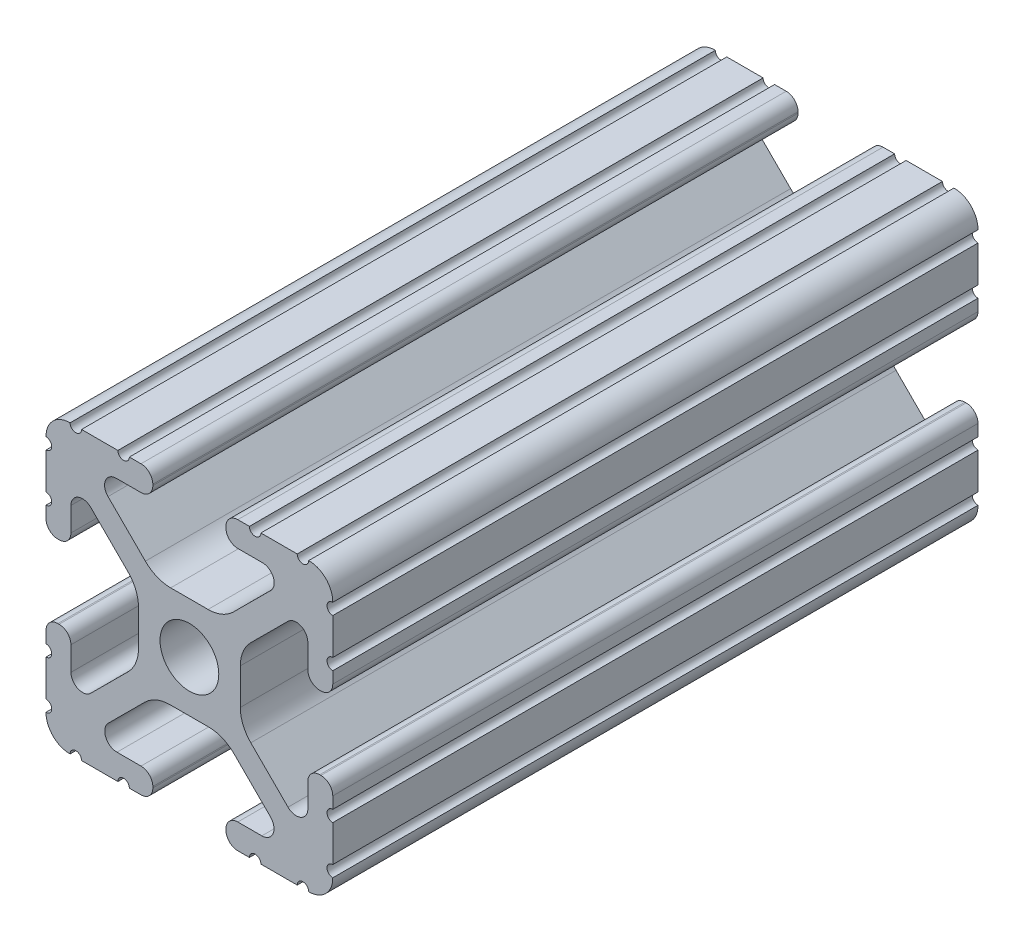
ISO-10303-21;
HEADER;
FILE_DESCRIPTION(('STEP AP214'),'2;1');
FILE_NAME('part.step','',(''),(''),'','','');
FILE_SCHEMA(('AUTOMOTIVE_DESIGN { 1 0 10303 214 1 1 1 1 }'));
ENDSEC;
DATA;
#1=APPLICATION_CONTEXT('core data for automotive mechanical design processes');
#2=APPLICATION_PROTOCOL_DEFINITION('international standard','automotive_design',2000,#1);
#3=PRODUCT_CONTEXT('',#1,'mechanical');
#4=PRODUCT('Part','Part','',(#3));
#5=PRODUCT_RELATED_PRODUCT_CATEGORY('part','',(#4));
#6=PRODUCT_DEFINITION_FORMATION('','',#4);
#7=PRODUCT_DEFINITION_CONTEXT('part definition',#1,'design');
#8=PRODUCT_DEFINITION('design','',#6,#7);
#9=PRODUCT_DEFINITION_SHAPE('','',#8);
#10=(LENGTH_UNIT() NAMED_UNIT(*) SI_UNIT(.MILLI.,.METRE.));
#11=(NAMED_UNIT(*) PLANE_ANGLE_UNIT() SI_UNIT($,.RADIAN.));
#12=(NAMED_UNIT(*) SI_UNIT($,.STERADIAN.) SOLID_ANGLE_UNIT());
#13=UNCERTAINTY_MEASURE_WITH_UNIT(LENGTH_MEASURE(1.E-05),#10,'distance_accuracy_value','');
#14=(GEOMETRIC_REPRESENTATION_CONTEXT(3) GLOBAL_UNCERTAINTY_ASSIGNED_CONTEXT((#13)) GLOBAL_UNIT_ASSIGNED_CONTEXT((#10,
#11,#12)) REPRESENTATION_CONTEXT('',''));
#15=CARTESIAN_POINT('',(0.,0.,0.));
#16=DIRECTION('',(0.,0.,1.));
#17=DIRECTION('',(1.,0.,0.));
#18=AXIS2_PLACEMENT_3D('',#15,#16,#17);
#19=CARTESIAN_POINT('',(-6.41640832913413,-9.40982735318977,28.575));
#20=DIRECTION('',(0.,0.,1.));
#21=DIRECTION('',(1.,0.,0.));
#22=AXIS2_PLACEMENT_3D('',#19,#20,#21);
#23=PLANE('',#22);
#24=CARTESIAN_POINT('',(-6.41640832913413,-9.40982735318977,28.575));
#25=DIRECTION('',(0.,0.,-1.));
#26=DIRECTION('',(1.,0.,0.));
#27=AXIS2_PLACEMENT_3D('',#24,#25,#26);
#28=CIRCLE('',#27,1.08037264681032);
#29=CARTESIAN_POINT('',(-6.41640832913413,-10.4902000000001,28.575));
#30=VERTEX_POINT('',#29);
#31=CARTESIAN_POINT('',(-7.17965049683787,-8.64519250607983,28.575));
#32=VERTEX_POINT('',#31);
#33=EDGE_CURVE('E848',#30,#32,#28,.T.);
#34=ORIENTED_EDGE('',*,*,#33,.T.);
#35=DIRECTION('',(0.707751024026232,0.706461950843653,0.));
#36=VECTOR('',#35,1.);
#37=CARTESIAN_POINT('',(-7.17965049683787,-8.64519250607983,28.575));
#38=LINE('',#37,#36);
#39=CARTESIAN_POINT('',(-3.95227025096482,-5.42369049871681,28.575));
#40=VERTEX_POINT('',#39);
#41=EDGE_CURVE('E356',#32,#40,#38,.T.);
#42=ORIENTED_EDGE('',*,*,#41,.T.);
#43=CARTESIAN_POINT('',(-1.70925355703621,-7.67080000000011,28.575));
#44=DIRECTION('',(0.,0.,-1.));
#45=DIRECTION('',(1.,0.,0.));
#46=AXIS2_PLACEMENT_3D('',#43,#44,#45);
#47=CIRCLE('',#46,3.17500000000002);
#48=CARTESIAN_POINT('',(-1.70925355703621,-4.49580000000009,28.575));
#49=VERTEX_POINT('',#48);
#50=EDGE_CURVE('E1127',#40,#49,#47,.T.);
#51=ORIENTED_EDGE('',*,*,#50,.T.);
#52=DIRECTION('',(1.,0.,0.));
#53=VECTOR('',#52,1.);
#54=CARTESIAN_POINT('',(-1.70925355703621,-4.49580000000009,28.575));
#55=LINE('',#54,#53);
#56=CARTESIAN_POINT('',(1.70925355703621,-4.49580000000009,28.575));
#57=VERTEX_POINT('',#56);
#58=EDGE_CURVE('E1146',#49,#57,#55,.T.);
#59=ORIENTED_EDGE('',*,*,#58,.T.);
#60=CARTESIAN_POINT('',(1.70925355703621,-7.67080000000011,28.575));
#61=DIRECTION('',(0.,0.,-1.));
#62=DIRECTION('',(1.,0.,0.));
#63=AXIS2_PLACEMENT_3D('',#60,#61,#62);
#64=CIRCLE('',#63,3.17500000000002);
#65=CARTESIAN_POINT('',(3.95227025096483,-5.42369049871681,28.575));
#66=VERTEX_POINT('',#65);
#67=EDGE_CURVE('E1143',#57,#66,#64,.T.);
#68=ORIENTED_EDGE('',*,*,#67,.T.);
#69=DIRECTION('',(0.707751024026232,-0.706461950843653,0.));
#70=VECTOR('',#69,1.);
#71=CARTESIAN_POINT('',(3.95227025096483,-5.42369049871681,28.575));
#72=LINE('',#71,#70);
#73=CARTESIAN_POINT('',(7.17965049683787,-8.64519250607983,28.575));
#74=VERTEX_POINT('',#73);
#75=EDGE_CURVE('E1145',#66,#74,#72,.T.);
#76=ORIENTED_EDGE('',*,*,#75,.T.);
#77=CARTESIAN_POINT('',(6.41640832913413,-9.40982735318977,28.575));
#78=DIRECTION('',(0.,0.,-1.));
#79=DIRECTION('',(1.,0.,0.));
#80=AXIS2_PLACEMENT_3D('',#77,#78,#79);
#81=CIRCLE('',#80,1.08037264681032);
#82=CARTESIAN_POINT('',(6.41640832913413,-10.4902000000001,28.575));
#83=VERTEX_POINT('',#82);
#84=EDGE_CURVE('E1148',#74,#83,#81,.T.);
#85=ORIENTED_EDGE('',*,*,#84,.T.);
#86=DIRECTION('',(-1.,0.,0.));
#87=VECTOR('',#86,1.);
#88=CARTESIAN_POINT('',(6.41640832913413,-10.4902000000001,28.575));
#89=LINE('',#88,#87);
#90=CARTESIAN_POINT('',(4.2875124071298,-10.4902000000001,28.575));
#91=VERTEX_POINT('',#90);
#92=EDGE_CURVE('E1154',#83,#91,#89,.T.);
#93=ORIENTED_EDGE('',*,*,#92,.T.);
#94=CARTESIAN_POINT('',(4.2875124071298,-11.5392124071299,28.575));
#95=DIRECTION('',(0.,0.,1.));
#96=DIRECTION('',(1.,0.,0.));
#97=AXIS2_PLACEMENT_3D('',#94,#95,#96);
#98=CIRCLE('',#97,1.04901240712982);
#99=CARTESIAN_POINT('',(3.23849999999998,-11.5392124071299,28.575));
#100=VERTEX_POINT('',#99);
#101=EDGE_CURVE('E1156',#91,#100,#98,.T.);
#102=ORIENTED_EDGE('',*,*,#101,.T.);
#103=DIRECTION('',(0.,-1.,0.));
#104=VECTOR('',#103,1.);
#105=CARTESIAN_POINT('',(3.23849999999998,-11.5392124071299,28.575));
#106=LINE('',#105,#104);
#107=CARTESIAN_POINT('',(3.23849999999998,-11.6509875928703,28.575));
#108=VERTEX_POINT('',#107);
#109=EDGE_CURVE('E1158',#100,#108,#106,.T.);
#110=ORIENTED_EDGE('',*,*,#109,.T.);
#111=CARTESIAN_POINT('',(4.2875124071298,-11.6509875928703,28.575));
#112=DIRECTION('',(0.,0.,1.));
#113=DIRECTION('',(1.,0.,0.));
#114=AXIS2_PLACEMENT_3D('',#111,#112,#113);
#115=CIRCLE('',#114,1.04901240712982);
#116=CARTESIAN_POINT('',(4.2875124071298,-12.7000000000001,28.575));
#117=VERTEX_POINT('',#116);
#118=EDGE_CURVE('E1160',#108,#117,#115,.T.);
#119=ORIENTED_EDGE('',*,*,#118,.T.);
#120=DIRECTION('',(1.,0.,0.));
#121=VECTOR('',#120,1.);
#122=CARTESIAN_POINT('',(4.2875124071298,-12.7000000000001,28.575));
#123=LINE('',#122,#121);
#124=CARTESIAN_POINT('',(5.31712671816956,-12.7000000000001,28.575));
#125=VERTEX_POINT('',#124);
#126=EDGE_CURVE('E1162',#117,#125,#123,.T.);
#127=ORIENTED_EDGE('',*,*,#126,.T.);
#128=CARTESIAN_POINT('',(5.82512671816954,-12.7000000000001,28.575));
#129=DIRECTION('',(0.,0.,-1.));
#130=DIRECTION('',(1.,0.,0.));
#131=AXIS2_PLACEMENT_3D('',#128,#129,#130);
#132=CIRCLE('',#131,0.507999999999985);
#133=CARTESIAN_POINT('',(6.33312671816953,-12.7000000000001,28.575));
#134=VERTEX_POINT('',#133);
#135=EDGE_CURVE('E1164',#125,#134,#132,.T.);
#136=ORIENTED_EDGE('',*,*,#135,.T.);
#137=DIRECTION('',(1.,0.,0.));
#138=VECTOR('',#137,1.);
#139=CARTESIAN_POINT('',(6.33312671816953,-12.7000000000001,28.575));
#140=LINE('',#139,#138);
#141=CARTESIAN_POINT('',(9.55044311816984,-12.7000000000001,28.575));
#142=VERTEX_POINT('',#141);
#143=EDGE_CURVE('E1166',#134,#142,#140,.T.);
#144=ORIENTED_EDGE('',*,*,#143,.T.);
#145=CARTESIAN_POINT('',(10.0584431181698,-12.7000000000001,28.575));
#146=DIRECTION('',(0.,0.,-1.));
#147=DIRECTION('',(1.,0.,0.));
#148=AXIS2_PLACEMENT_3D('',#145,#146,#147);
#149=CIRCLE('',#148,0.507999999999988);
#150=CARTESIAN_POINT('',(10.5664430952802,-12.6998475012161,28.575));
#151=VERTEX_POINT('',#150);
#152=EDGE_CURVE('E1168',#142,#151,#149,.T.);
#153=ORIENTED_EDGE('',*,*,#152,.T.);
#154=CARTESIAN_POINT('',(10.5918000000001,-10.5918000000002,28.575));
#155=DIRECTION('',(0.,0.,1.));
#156=DIRECTION('',(1.,0.,0.));
#157=AXIS2_PLACEMENT_3D('',#154,#155,#156);
#158=CIRCLE('',#157,2.1081999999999);
#159=CARTESIAN_POINT('',(12.699846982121,-10.5663999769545,28.575));
#160=VERTEX_POINT('',#159);
#161=EDGE_CURVE('E1170',#151,#160,#158,.T.);
#162=ORIENTED_EDGE('',*,*,#161,.T.);
#163=CARTESIAN_POINT('',(12.7,-10.0584000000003,28.575));
#164=DIRECTION('',(0.,0.,-1.));
#165=DIRECTION('',(1.,0.,0.));
#166=AXIS2_PLACEMENT_3D('',#163,#164,#165);
#167=CIRCLE('',#166,0.507999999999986);
#168=CARTESIAN_POINT('',(12.7,-9.5504000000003,28.575));
#169=VERTEX_POINT('',#168);
#170=EDGE_CURVE('E1172',#160,#169,#167,.T.);
#171=ORIENTED_EDGE('',*,*,#170,.T.);
#172=DIRECTION('',(0.,1.,0.));
#173=VECTOR('',#172,1.);
#174=CARTESIAN_POINT('',(12.7,-9.5504000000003,28.575));
#175=LINE('',#174,#173);
#176=CARTESIAN_POINT('',(12.7,-6.33308359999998,28.575));
#177=VERTEX_POINT('',#176);
#178=EDGE_CURVE('E1174',#169,#177,#175,.T.);
#179=ORIENTED_EDGE('',*,*,#178,.T.);
#180=CARTESIAN_POINT('',(12.7,-5.8250836,28.575));
#181=DIRECTION('',(0.,0.,-1.));
#182=DIRECTION('',(1.,0.,0.));
#183=AXIS2_PLACEMENT_3D('',#180,#181,#182);
#184=CIRCLE('',#183,0.507999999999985);
#185=CARTESIAN_POINT('',(12.7,-5.31708360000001,28.575));
#186=VERTEX_POINT('',#185);
#187=EDGE_CURVE('E1176',#177,#186,#184,.T.);
#188=ORIENTED_EDGE('',*,*,#187,.T.);
#189=DIRECTION('',(0.,1.,0.));
#190=VECTOR('',#189,1.);
#191=CARTESIAN_POINT('',(12.7,-5.31708360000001,28.575));
#192=LINE('',#191,#190);
#193=CARTESIAN_POINT('',(12.7,-4.28746928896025,28.575));
#194=VERTEX_POINT('',#193);
#195=EDGE_CURVE('E1178',#186,#194,#192,.T.);
#196=ORIENTED_EDGE('',*,*,#195,.T.);
#197=CARTESIAN_POINT('',(11.6509875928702,-4.28746928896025,28.575));
#198=DIRECTION('',(0.,0.,1.));
#199=DIRECTION('',(1.,0.,0.));
#200=AXIS2_PLACEMENT_3D('',#197,#198,#199);
#201=CIRCLE('',#200,1.04901240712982);
#202=CARTESIAN_POINT('',(11.6509875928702,-3.23845688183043,28.575));
#203=VERTEX_POINT('',#202);
#204=EDGE_CURVE('E1180',#194,#203,#201,.T.);
#205=ORIENTED_EDGE('',*,*,#204,.T.);
#206=DIRECTION('',(-1.,0.,0.));
#207=VECTOR('',#206,1.);
#208=CARTESIAN_POINT('',(11.6509875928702,-3.23845688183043,28.575));
#209=LINE('',#208,#207);
#210=CARTESIAN_POINT('',(11.5392124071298,-3.23845688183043,28.575));
#211=VERTEX_POINT('',#210);
#212=EDGE_CURVE('E1182',#203,#211,#209,.T.);
#213=ORIENTED_EDGE('',*,*,#212,.T.);
#214=CARTESIAN_POINT('',(11.5392124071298,-4.28746928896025,28.575));
#215=DIRECTION('',(0.,0.,1.));
#216=DIRECTION('',(1.,0.,0.));
#217=AXIS2_PLACEMENT_3D('',#214,#215,#216);
#218=CIRCLE('',#217,1.04901240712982);
#219=CARTESIAN_POINT('',(10.4902,-4.28746928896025,28.575));
#220=VERTEX_POINT('',#219);
#221=EDGE_CURVE('E1184',#211,#220,#218,.T.);
#222=ORIENTED_EDGE('',*,*,#221,.T.);
#223=DIRECTION('',(0.,-1.,0.));
#224=VECTOR('',#223,1.);
#225=CARTESIAN_POINT('',(10.4902,-4.28746928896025,28.575));
#226=LINE('',#225,#224);
#227=CARTESIAN_POINT('',(10.4902,-6.4020890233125,28.575));
#228=VERTEX_POINT('',#227);
#229=EDGE_CURVE('E1186',#220,#228,#226,.T.);
#230=ORIENTED_EDGE('',*,*,#229,.T.);
#231=CARTESIAN_POINT('',(9.4627890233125,-6.4020890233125,28.575));
#232=DIRECTION('',(0.,0.,-1.));
#233=DIRECTION('',(1.,0.,0.));
#234=AXIS2_PLACEMENT_3D('',#231,#232,#233);
#235=CIRCLE('',#234,1.0274109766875);
#236=CARTESIAN_POINT('',(8.7371313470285,-7.12940893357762,28.575));
#237=VERTEX_POINT('',#236);
#238=EDGE_CURVE('E1188',#228,#237,#235,.T.);
#239=ORIENTED_EDGE('',*,*,#238,.T.);
#240=DIRECTION('',(-0.70791526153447,0.706297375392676,0.));
#241=VECTOR('',#240,1.);
#242=CARTESIAN_POINT('',(8.7371313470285,-7.12940893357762,28.575));
#243=LINE('',#242,#241);
#244=CARTESIAN_POINT('',(5.44100583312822,-3.84081646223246,28.575));
#245=VERTEX_POINT('',#244);
#246=EDGE_CURVE('E1190',#237,#245,#243,.T.);
#247=ORIENTED_EDGE('',*,*,#246,.T.);
#248=CARTESIAN_POINT('',(7.68350000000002,-1.59318550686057,28.575));
#249=DIRECTION('',(0.,0.,-1.));
#250=DIRECTION('',(1.,0.,0.));
#251=AXIS2_PLACEMENT_3D('',#248,#249,#250);
#252=CIRCLE('',#251,3.17500000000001);
#253=CARTESIAN_POINT('',(4.50850000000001,-1.59318550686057,28.575));
#254=VERTEX_POINT('',#253);
#255=EDGE_CURVE('E1192',#245,#254,#252,.T.);
#256=ORIENTED_EDGE('',*,*,#255,.T.);
#257=DIRECTION('',(0.,1.,0.));
#258=VECTOR('',#257,1.);
#259=CARTESIAN_POINT('',(4.5085,-1.59318550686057,28.575));
#260=LINE('',#259,#258);
#261=CARTESIAN_POINT('',(4.50850000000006,1.59318550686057,28.575));
#262=VERTEX_POINT('',#261);
#263=EDGE_CURVE('E1194',#254,#262,#260,.T.);
#264=ORIENTED_EDGE('',*,*,#263,.T.);
#265=CARTESIAN_POINT('',(7.68350000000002,1.59318550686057,28.575));
#266=DIRECTION('',(0.,0.,-1.));
#267=DIRECTION('',(1.,0.,0.));
#268=AXIS2_PLACEMENT_3D('',#265,#266,#267);
#269=CIRCLE('',#268,3.17499999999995);
#270=CARTESIAN_POINT('',(5.44100583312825,3.84081646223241,28.575));
#271=VERTEX_POINT('',#270);
#272=EDGE_CURVE('E1196',#262,#271,#269,.T.);
#273=ORIENTED_EDGE('',*,*,#272,.T.);
#274=DIRECTION('',(0.70791526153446,0.706297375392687,0.));
#275=VECTOR('',#274,1.);
#276=CARTESIAN_POINT('',(5.44100583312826,3.8408164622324,28.575));
#277=LINE('',#276,#275);
#278=CARTESIAN_POINT('',(8.73713134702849,7.12940893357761,28.575));
#279=VERTEX_POINT('',#278);
#280=EDGE_CURVE('E1198',#271,#279,#277,.T.);
#281=ORIENTED_EDGE('',*,*,#280,.T.);
#282=CARTESIAN_POINT('',(9.4627890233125,6.4020890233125,28.575));
#283=DIRECTION('',(0.,0.,-1.));
#284=DIRECTION('',(1.,0.,0.));
#285=AXIS2_PLACEMENT_3D('',#282,#283,#284);
#286=CIRCLE('',#285,1.0274109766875);
#287=CARTESIAN_POINT('',(10.4902,6.4020890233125,28.575));
#288=VERTEX_POINT('',#287);
#289=EDGE_CURVE('E1200',#279,#288,#286,.T.);
#290=ORIENTED_EDGE('',*,*,#289,.T.);
#291=DIRECTION('',(0.,-1.,0.));
#292=VECTOR('',#291,1.);
#293=CARTESIAN_POINT('',(10.4902,6.4020890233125,28.575));
#294=LINE('',#293,#292);
#295=CARTESIAN_POINT('',(10.4902,4.28746928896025,28.575));
#296=VERTEX_POINT('',#295);
#297=EDGE_CURVE('E1202',#288,#296,#294,.T.);
#298=ORIENTED_EDGE('',*,*,#297,.T.);
#299=CARTESIAN_POINT('',(11.5392124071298,4.28746928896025,28.575));
#300=DIRECTION('',(0.,0.,1.));
#301=DIRECTION('',(1.,0.,0.));
#302=AXIS2_PLACEMENT_3D('',#299,#300,#301);
#303=CIRCLE('',#302,1.04901240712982);
#304=CARTESIAN_POINT('',(11.5392124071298,3.23845688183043,28.575));
#305=VERTEX_POINT('',#304);
#306=EDGE_CURVE('E1204',#296,#305,#303,.T.);
#307=ORIENTED_EDGE('',*,*,#306,.T.);
#308=DIRECTION('',(1.,0.,0.));
#309=VECTOR('',#308,1.);
#310=CARTESIAN_POINT('',(11.5392124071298,3.23845688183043,28.575));
#311=LINE('',#310,#309);
#312=CARTESIAN_POINT('',(11.6509875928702,3.23845688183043,28.575));
#313=VERTEX_POINT('',#312);
#314=EDGE_CURVE('E1206',#305,#313,#311,.T.);
#315=ORIENTED_EDGE('',*,*,#314,.T.);
#316=CARTESIAN_POINT('',(11.6509875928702,4.28746928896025,28.575));
#317=DIRECTION('',(0.,0.,1.));
#318=DIRECTION('',(1.,0.,0.));
#319=AXIS2_PLACEMENT_3D('',#316,#317,#318);
#320=CIRCLE('',#319,1.04901240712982);
#321=CARTESIAN_POINT('',(12.7,4.28746928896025,28.575));
#322=VERTEX_POINT('',#321);
#323=EDGE_CURVE('E1208',#313,#322,#320,.T.);
#324=ORIENTED_EDGE('',*,*,#323,.T.);
#325=DIRECTION('',(0.,1.,0.));
#326=VECTOR('',#325,1.);
#327=CARTESIAN_POINT('',(12.7,4.28746928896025,28.575));
#328=LINE('',#327,#326);
#329=CARTESIAN_POINT('',(12.7,5.31708360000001,28.575));
#330=VERTEX_POINT('',#329);
#331=EDGE_CURVE('E1210',#322,#330,#328,.T.);
#332=ORIENTED_EDGE('',*,*,#331,.T.);
#333=CARTESIAN_POINT('',(12.7,5.8250836,28.575));
#334=DIRECTION('',(0.,0.,-1.));
#335=DIRECTION('',(1.,0.,0.));
#336=AXIS2_PLACEMENT_3D('',#333,#334,#335);
#337=CIRCLE('',#336,0.507999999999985);
#338=CARTESIAN_POINT('',(12.7,6.33308359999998,28.575));
#339=VERTEX_POINT('',#338);
#340=EDGE_CURVE('E1212',#330,#339,#337,.T.);
#341=ORIENTED_EDGE('',*,*,#340,.T.);
#342=DIRECTION('',(0.,1.,0.));
#343=VECTOR('',#342,1.);
#344=CARTESIAN_POINT('',(12.7,6.33308359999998,28.575));
#345=LINE('',#344,#343);
#346=CARTESIAN_POINT('',(12.7,9.55040000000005,28.575));
#347=VERTEX_POINT('',#346);
#348=EDGE_CURVE('E1214',#339,#347,#345,.T.);
#349=ORIENTED_EDGE('',*,*,#348,.T.);
#350=CARTESIAN_POINT('',(12.7,10.0584000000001,28.575));
#351=DIRECTION('',(0.,0.,-1.));
#352=DIRECTION('',(1.,0.,0.));
#353=AXIS2_PLACEMENT_3D('',#350,#351,#352);
#354=CIRCLE('',#353,0.508000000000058);
#355=CARTESIAN_POINT('',(12.699846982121,10.5663999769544,28.575));
#356=VERTEX_POINT('',#355);
#357=EDGE_CURVE('E1216',#347,#356,#354,.T.);
#358=ORIENTED_EDGE('',*,*,#357,.T.);
#359=CARTESIAN_POINT('',(10.5918000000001,10.5918000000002,28.575));
#360=DIRECTION('',(0.,0.,1.));
#361=DIRECTION('',(1.,0.,0.));
#362=AXIS2_PLACEMENT_3D('',#359,#360,#361);
#363=CIRCLE('',#362,2.1081999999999);
#364=CARTESIAN_POINT('',(10.5664430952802,12.6998475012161,28.575));
#365=VERTEX_POINT('',#364);
#366=EDGE_CURVE('E1218',#356,#365,#363,.T.);
#367=ORIENTED_EDGE('',*,*,#366,.T.);
#368=CARTESIAN_POINT('',(10.0584431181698,12.7000000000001,28.575));
#369=DIRECTION('',(0.,0.,-1.));
#370=DIRECTION('',(1.,0.,0.));
#371=AXIS2_PLACEMENT_3D('',#368,#369,#370);
#372=CIRCLE('',#371,0.507999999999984);
#373=CARTESIAN_POINT('',(9.55044311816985,12.7000000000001,28.575));
#374=VERTEX_POINT('',#373);
#375=EDGE_CURVE('E1220',#365,#374,#372,.T.);
#376=ORIENTED_EDGE('',*,*,#375,.T.);
#377=DIRECTION('',(-1.,0.,0.));
#378=VECTOR('',#377,1.);
#379=CARTESIAN_POINT('',(9.55044311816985,12.7000000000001,28.575));
#380=LINE('',#379,#378);
#381=CARTESIAN_POINT('',(6.33312671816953,12.7000000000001,28.575));
#382=VERTEX_POINT('',#381);
#383=EDGE_CURVE('E1222',#374,#382,#380,.T.);
#384=ORIENTED_EDGE('',*,*,#383,.T.);
#385=CARTESIAN_POINT('',(5.82512671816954,12.7000000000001,28.575));
#386=DIRECTION('',(0.,0.,-1.));
#387=DIRECTION('',(1.,0.,0.));
#388=AXIS2_PLACEMENT_3D('',#385,#386,#387);
#389=CIRCLE('',#388,0.507999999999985);
#390=CARTESIAN_POINT('',(5.31712671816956,12.7000000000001,28.575));
#391=VERTEX_POINT('',#390);
#392=EDGE_CURVE('E1224',#382,#391,#389,.T.);
#393=ORIENTED_EDGE('',*,*,#392,.T.);
#394=DIRECTION('',(-1.,0.,0.));
#395=VECTOR('',#394,1.);
#396=CARTESIAN_POINT('',(5.31712671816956,12.7000000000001,28.575));
#397=LINE('',#396,#395);
#398=CARTESIAN_POINT('',(4.2875124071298,12.7000000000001,28.575));
#399=VERTEX_POINT('',#398);
#400=EDGE_CURVE('E1226',#391,#399,#397,.T.);
#401=ORIENTED_EDGE('',*,*,#400,.T.);
#402=CARTESIAN_POINT('',(4.2875124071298,11.6509875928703,28.575));
#403=DIRECTION('',(0.,0.,1.));
#404=DIRECTION('',(1.,0.,0.));
#405=AXIS2_PLACEMENT_3D('',#402,#403,#404);
#406=CIRCLE('',#405,1.04901240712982);
#407=CARTESIAN_POINT('',(3.23849999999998,11.6509875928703,28.575));
#408=VERTEX_POINT('',#407);
#409=EDGE_CURVE('E1228',#399,#408,#406,.T.);
#410=ORIENTED_EDGE('',*,*,#409,.T.);
#411=DIRECTION('',(0.,-1.,0.));
#412=VECTOR('',#411,1.);
#413=CARTESIAN_POINT('',(3.23849999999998,11.6509875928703,28.575));
#414=LINE('',#413,#412);
#415=CARTESIAN_POINT('',(3.23849999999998,11.5392124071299,28.575));
#416=VERTEX_POINT('',#415);
#417=EDGE_CURVE('E1230',#408,#416,#414,.T.);
#418=ORIENTED_EDGE('',*,*,#417,.T.);
#419=CARTESIAN_POINT('',(4.2875124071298,11.5392124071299,28.575));
#420=DIRECTION('',(0.,0.,1.));
#421=DIRECTION('',(1.,0.,0.));
#422=AXIS2_PLACEMENT_3D('',#419,#420,#421);
#423=CIRCLE('',#422,1.04901240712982);
#424=CARTESIAN_POINT('',(4.2875124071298,10.4902000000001,28.575));
#425=VERTEX_POINT('',#424);
#426=EDGE_CURVE('E1232',#416,#425,#423,.T.);
#427=ORIENTED_EDGE('',*,*,#426,.T.);
#428=DIRECTION('',(1.,0.,0.));
#429=VECTOR('',#428,1.);
#430=CARTESIAN_POINT('',(4.2875124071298,10.4902000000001,28.575));
#431=LINE('',#430,#429);
#432=CARTESIAN_POINT('',(6.47678859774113,10.4902000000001,28.575));
#433=VERTEX_POINT('',#432);
#434=EDGE_CURVE('E1234',#425,#433,#431,.T.);
#435=ORIENTED_EDGE('',*,*,#434,.T.);
#436=CARTESIAN_POINT('',(6.47678859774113,9.45629072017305,28.575));
#437=DIRECTION('',(0.,0.,-1.));
#438=DIRECTION('',(1.,0.,0.));
#439=AXIS2_PLACEMENT_3D('',#436,#437,#438);
#440=CIRCLE('',#439,1.03390927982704);
#441=CARTESIAN_POINT('',(7.2070360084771,8.72437056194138,28.575));
#442=VERTEX_POINT('',#441);
#443=EDGE_CURVE('E1236',#433,#442,#440,.T.);
#444=ORIENTED_EDGE('',*,*,#443,.T.);
#445=DIRECTION('',(-0.707915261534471,-0.706297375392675,0.));
#446=VECTOR('',#445,1.);
#447=CARTESIAN_POINT('',(7.2070360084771,8.72437056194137,28.575));
#448=LINE('',#447,#446);
#449=CARTESIAN_POINT('',(3.89827256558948,5.42316904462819,28.575));
#450=VERTEX_POINT('',#449);
#451=EDGE_CURVE('E1238',#442,#450,#448,.T.);
#452=ORIENTED_EDGE('',*,*,#451,.T.);
#453=CARTESIAN_POINT('',(1.65577839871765,7.67080000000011,28.575));
#454=DIRECTION('',(0.,0.,-1.));
#455=DIRECTION('',(1.,0.,0.));
#456=AXIS2_PLACEMENT_3D('',#453,#454,#455);
#457=CIRCLE('',#456,3.17500000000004);
#458=CARTESIAN_POINT('',(1.65577839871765,4.49580000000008,28.575));
#459=VERTEX_POINT('',#458);
#460=EDGE_CURVE('E1240',#450,#459,#457,.T.);
#461=ORIENTED_EDGE('',*,*,#460,.T.);
#462=DIRECTION('',(-1.,0.,0.));
#463=VECTOR('',#462,1.);
#464=CARTESIAN_POINT('',(1.65577839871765,4.49580000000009,28.575));
#465=LINE('',#464,#463);
#466=CARTESIAN_POINT('',(-1.65577839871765,4.49580000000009,28.575));
#467=VERTEX_POINT('',#466);
#468=EDGE_CURVE('E1242',#459,#467,#465,.T.);
#469=ORIENTED_EDGE('',*,*,#468,.T.);
#470=CARTESIAN_POINT('',(-1.65577839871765,7.67080000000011,28.575));
#471=DIRECTION('',(0.,0.,-1.));
#472=DIRECTION('',(1.,0.,0.));
#473=AXIS2_PLACEMENT_3D('',#470,#471,#472);
#474=CIRCLE('',#473,3.17500000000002);
#475=CARTESIAN_POINT('',(-3.89827256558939,5.42316904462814,28.575));
#476=VERTEX_POINT('',#475);
#477=EDGE_CURVE('E1244',#467,#476,#474,.T.);
#478=ORIENTED_EDGE('',*,*,#477,.T.);
#479=DIRECTION('',(-0.707915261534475,0.706297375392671,0.));
#480=VECTOR('',#479,1.);
#481=CARTESIAN_POINT('',(-3.89827256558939,5.42316904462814,28.575));
#482=LINE('',#481,#480);
#483=CARTESIAN_POINT('',(-7.20703600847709,8.72437056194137,28.575));
#484=VERTEX_POINT('',#483);
#485=EDGE_CURVE('E1246',#476,#484,#482,.T.);
#486=ORIENTED_EDGE('',*,*,#485,.T.);
#487=CARTESIAN_POINT('',(-6.47678859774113,9.45629072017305,28.575));
#488=DIRECTION('',(0.,0.,-1.));
#489=DIRECTION('',(1.,0.,0.));
#490=AXIS2_PLACEMENT_3D('',#487,#488,#489);
#491=CIRCLE('',#490,1.03390927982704);
#492=CARTESIAN_POINT('',(-6.47678859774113,10.4902000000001,28.575));
#493=VERTEX_POINT('',#492);
#494=EDGE_CURVE('E1248',#484,#493,#491,.T.);
#495=ORIENTED_EDGE('',*,*,#494,.T.);
#496=DIRECTION('',(1.,0.,0.));
#497=VECTOR('',#496,1.);
#498=CARTESIAN_POINT('',(-6.47678859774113,10.4902000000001,28.575));
#499=LINE('',#498,#497);
#500=CARTESIAN_POINT('',(-4.2875124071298,10.4902000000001,28.575));
#501=VERTEX_POINT('',#500);
#502=EDGE_CURVE('E1250',#493,#501,#499,.T.);
#503=ORIENTED_EDGE('',*,*,#502,.T.);
#504=CARTESIAN_POINT('',(-4.2875124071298,11.5392124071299,28.575));
#505=DIRECTION('',(0.,0.,1.));
#506=DIRECTION('',(1.,0.,0.));
#507=AXIS2_PLACEMENT_3D('',#504,#505,#506);
#508=CIRCLE('',#507,1.04901240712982);
#509=CARTESIAN_POINT('',(-3.23849999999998,11.5392124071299,28.575));
#510=VERTEX_POINT('',#509);
#511=EDGE_CURVE('E1252',#501,#510,#508,.T.);
#512=ORIENTED_EDGE('',*,*,#511,.T.);
#513=DIRECTION('',(0.,1.,0.));
#514=VECTOR('',#513,1.);
#515=CARTESIAN_POINT('',(-3.23849999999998,11.5392124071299,28.575));
#516=LINE('',#515,#514);
#517=CARTESIAN_POINT('',(-3.23849999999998,11.6509875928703,28.575));
#518=VERTEX_POINT('',#517);
#519=EDGE_CURVE('E1254',#510,#518,#516,.T.);
#520=ORIENTED_EDGE('',*,*,#519,.T.);
#521=CARTESIAN_POINT('',(-4.2875124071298,11.6509875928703,28.575));
#522=DIRECTION('',(0.,0.,1.));
#523=DIRECTION('',(1.,0.,0.));
#524=AXIS2_PLACEMENT_3D('',#521,#522,#523);
#525=CIRCLE('',#524,1.04901240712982);
#526=CARTESIAN_POINT('',(-4.2875124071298,12.7000000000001,28.575));
#527=VERTEX_POINT('',#526);
#528=EDGE_CURVE('E1256',#518,#527,#525,.T.);
#529=ORIENTED_EDGE('',*,*,#528,.T.);
#530=DIRECTION('',(-1.,0.,0.));
#531=VECTOR('',#530,1.);
#532=CARTESIAN_POINT('',(-4.2875124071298,12.7000000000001,28.575));
#533=LINE('',#532,#531);
#534=CARTESIAN_POINT('',(-5.31712671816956,12.7000000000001,28.575));
#535=VERTEX_POINT('',#534);
#536=EDGE_CURVE('E1258',#527,#535,#533,.T.);
#537=ORIENTED_EDGE('',*,*,#536,.T.);
#538=CARTESIAN_POINT('',(-5.82512671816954,12.7000000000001,28.575));
#539=DIRECTION('',(0.,0.,-1.));
#540=DIRECTION('',(1.,0.,0.));
#541=AXIS2_PLACEMENT_3D('',#538,#539,#540);
#542=CIRCLE('',#541,0.507999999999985);
#543=CARTESIAN_POINT('',(-6.33312671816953,12.7000000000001,28.575));
#544=VERTEX_POINT('',#543);
#545=EDGE_CURVE('E1260',#535,#544,#542,.T.);
#546=ORIENTED_EDGE('',*,*,#545,.T.);
#547=DIRECTION('',(-1.,0.,0.));
#548=VECTOR('',#547,1.);
#549=CARTESIAN_POINT('',(-6.33312671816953,12.7000000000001,28.575));
#550=LINE('',#549,#548);
#551=CARTESIAN_POINT('',(-9.55044311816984,12.7000000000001,28.575));
#552=VERTEX_POINT('',#551);
#553=EDGE_CURVE('E1262',#544,#552,#550,.T.);
#554=ORIENTED_EDGE('',*,*,#553,.T.);
#555=CARTESIAN_POINT('',(-10.0584431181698,12.7000000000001,28.575));
#556=DIRECTION('',(0.,0.,-1.));
#557=DIRECTION('',(1.,0.,0.));
#558=AXIS2_PLACEMENT_3D('',#555,#556,#557);
#559=CIRCLE('',#558,0.507999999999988);
#560=CARTESIAN_POINT('',(-10.5664430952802,12.6998475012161,28.575));
#561=VERTEX_POINT('',#560);
#562=EDGE_CURVE('E1264',#552,#561,#559,.T.);
#563=ORIENTED_EDGE('',*,*,#562,.T.);
#564=CARTESIAN_POINT('',(-10.5918000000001,10.5918000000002,28.575));
#565=DIRECTION('',(0.,0.,1.));
#566=DIRECTION('',(1.,0.,0.));
#567=AXIS2_PLACEMENT_3D('',#564,#565,#566);
#568=CIRCLE('',#567,2.1081999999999);
#569=CARTESIAN_POINT('',(-12.699846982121,10.5663999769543,28.575));
#570=VERTEX_POINT('',#569);
#571=EDGE_CURVE('E1266',#561,#570,#568,.T.);
#572=ORIENTED_EDGE('',*,*,#571,.T.);
#573=CARTESIAN_POINT('',(-12.7,10.0584000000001,28.575));
#574=DIRECTION('',(0.,0.,-1.));
#575=DIRECTION('',(1.,0.,0.));
#576=AXIS2_PLACEMENT_3D('',#573,#574,#575);
#577=CIRCLE('',#576,0.50799999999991);
#578=CARTESIAN_POINT('',(-12.7,9.55040000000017,28.575));
#579=VERTEX_POINT('',#578);
#580=EDGE_CURVE('E1268',#570,#579,#577,.T.);
#581=ORIENTED_EDGE('',*,*,#580,.T.);
#582=DIRECTION('',(0.,-1.,0.));
#583=VECTOR('',#582,1.);
#584=CARTESIAN_POINT('',(-12.7,9.5504000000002,28.575));
#585=LINE('',#584,#583);
#586=CARTESIAN_POINT('',(-12.7,6.33308359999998,28.575));
#587=VERTEX_POINT('',#586);
#588=EDGE_CURVE('E1270',#579,#587,#585,.T.);
#589=ORIENTED_EDGE('',*,*,#588,.T.);
#590=CARTESIAN_POINT('',(-12.7,5.8250836,28.575));
#591=DIRECTION('',(0.,0.,-1.));
#592=DIRECTION('',(1.,0.,0.));
#593=AXIS2_PLACEMENT_3D('',#590,#591,#592);
#594=CIRCLE('',#593,0.507999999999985);
#595=CARTESIAN_POINT('',(-12.7,5.31708360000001,28.575));
#596=VERTEX_POINT('',#595);
#597=EDGE_CURVE('E1272',#587,#596,#594,.T.);
#598=ORIENTED_EDGE('',*,*,#597,.T.);
#599=DIRECTION('',(0.,-1.,0.));
#600=VECTOR('',#599,1.);
#601=CARTESIAN_POINT('',(-12.7,5.31708360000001,28.575));
#602=LINE('',#601,#600);
#603=CARTESIAN_POINT('',(-12.7,4.28746928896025,28.575));
#604=VERTEX_POINT('',#603);
#605=EDGE_CURVE('E1274',#596,#604,#602,.T.);
#606=ORIENTED_EDGE('',*,*,#605,.T.);
#607=CARTESIAN_POINT('',(-11.6509875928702,4.28746928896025,28.575));
#608=DIRECTION('',(0.,0.,1.));
#609=DIRECTION('',(1.,0.,0.));
#610=AXIS2_PLACEMENT_3D('',#607,#608,#609);
#611=CIRCLE('',#610,1.04901240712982);
#612=CARTESIAN_POINT('',(-11.6509875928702,3.23845688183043,28.575));
#613=VERTEX_POINT('',#612);
#614=EDGE_CURVE('E1276',#604,#613,#611,.T.);
#615=ORIENTED_EDGE('',*,*,#614,.T.);
#616=DIRECTION('',(1.,0.,0.));
#617=VECTOR('',#616,1.);
#618=CARTESIAN_POINT('',(-11.6509875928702,3.23845688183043,28.575));
#619=LINE('',#618,#617);
#620=CARTESIAN_POINT('',(-11.5392124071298,3.23845688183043,28.575));
#621=VERTEX_POINT('',#620);
#622=EDGE_CURVE('E1278',#613,#621,#619,.T.);
#623=ORIENTED_EDGE('',*,*,#622,.T.);
#624=CARTESIAN_POINT('',(-11.5392124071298,4.28746928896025,28.575));
#625=DIRECTION('',(0.,0.,1.));
#626=DIRECTION('',(1.,0.,0.));
#627=AXIS2_PLACEMENT_3D('',#624,#625,#626);
#628=CIRCLE('',#627,1.04901240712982);
#629=CARTESIAN_POINT('',(-10.4902,4.28746928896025,28.575));
#630=VERTEX_POINT('',#629);
#631=EDGE_CURVE('E1280',#621,#630,#628,.T.);
#632=ORIENTED_EDGE('',*,*,#631,.T.);
#633=DIRECTION('',(0.,1.,0.));
#634=VECTOR('',#633,1.);
#635=CARTESIAN_POINT('',(-10.4902,4.28746928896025,28.575));
#636=LINE('',#635,#634);
#637=CARTESIAN_POINT('',(-10.4902,6.4020890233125,28.575));
#638=VERTEX_POINT('',#637);
#639=EDGE_CURVE('E1282',#630,#638,#636,.T.);
#640=ORIENTED_EDGE('',*,*,#639,.T.);
#641=CARTESIAN_POINT('',(-9.4627890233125,6.4020890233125,28.575));
#642=DIRECTION('',(0.,0.,-1.));
#643=DIRECTION('',(1.,0.,0.));
#644=AXIS2_PLACEMENT_3D('',#641,#642,#643);
#645=CIRCLE('',#644,1.0274109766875);
#646=CARTESIAN_POINT('',(-8.73713134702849,7.12940893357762,28.575));
#647=VERTEX_POINT('',#646);
#648=EDGE_CURVE('E1284',#638,#647,#645,.T.);
#649=ORIENTED_EDGE('',*,*,#648,.T.);
#650=DIRECTION('',(0.707915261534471,-0.706297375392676,0.));
#651=VECTOR('',#650,1.);
#652=CARTESIAN_POINT('',(-8.73713134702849,7.12940893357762,28.575));
#653=LINE('',#652,#651);
#654=CARTESIAN_POINT('',(-5.44100583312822,3.84081646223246,28.575));
#655=VERTEX_POINT('',#654);
#656=EDGE_CURVE('E1286',#647,#655,#653,.T.);
#657=ORIENTED_EDGE('',*,*,#656,.T.);
#658=CARTESIAN_POINT('',(-7.68350000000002,1.59318550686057,28.575));
#659=DIRECTION('',(0.,0.,-1.));
#660=DIRECTION('',(1.,0.,0.));
#661=AXIS2_PLACEMENT_3D('',#658,#659,#660);
#662=CIRCLE('',#661,3.17500000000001);
#663=CARTESIAN_POINT('',(-4.50850000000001,1.59318550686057,28.575));
#664=VERTEX_POINT('',#663);
#665=EDGE_CURVE('E1288',#655,#664,#662,.T.);
#666=ORIENTED_EDGE('',*,*,#665,.T.);
#667=DIRECTION('',(0.,-1.,0.));
#668=VECTOR('',#667,1.);
#669=CARTESIAN_POINT('',(-4.5085,1.59318550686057,28.575));
#670=LINE('',#669,#668);
#671=CARTESIAN_POINT('',(-4.5085,-1.59318550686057,28.575));
#672=VERTEX_POINT('',#671);
#673=EDGE_CURVE('E1290',#664,#672,#670,.T.);
#674=ORIENTED_EDGE('',*,*,#673,.T.);
#675=CARTESIAN_POINT('',(-7.68350000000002,-1.59318550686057,28.575));
#676=DIRECTION('',(0.,0.,-1.));
#677=DIRECTION('',(1.,0.,0.));
#678=AXIS2_PLACEMENT_3D('',#675,#676,#677);
#679=CIRCLE('',#678,3.17500000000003);
#680=CARTESIAN_POINT('',(-5.44100583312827,-3.84081646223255,28.575));
#681=VERTEX_POINT('',#680);
#682=EDGE_CURVE('E1292',#672,#681,#679,.T.);
#683=ORIENTED_EDGE('',*,*,#682,.T.);
#684=DIRECTION('',(-0.707915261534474,-0.706297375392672,0.));
#685=VECTOR('',#684,1.);
#686=CARTESIAN_POINT('',(-5.44100583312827,-3.84081646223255,28.575));
#687=LINE('',#686,#685);
#688=CARTESIAN_POINT('',(-8.7371313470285,-7.12940893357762,28.575));
#689=VERTEX_POINT('',#688);
#690=EDGE_CURVE('E1294',#681,#689,#687,.T.);
#691=ORIENTED_EDGE('',*,*,#690,.T.);
#692=CARTESIAN_POINT('',(-9.4627890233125,-6.4020890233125,28.575));
#693=DIRECTION('',(0.,0.,-1.));
#694=DIRECTION('',(1.,0.,0.));
#695=AXIS2_PLACEMENT_3D('',#692,#693,#694);
#696=CIRCLE('',#695,1.0274109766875);
#697=CARTESIAN_POINT('',(-10.4902,-6.4020890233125,28.575));
#698=VERTEX_POINT('',#697);
#699=EDGE_CURVE('E1296',#689,#698,#696,.T.);
#700=ORIENTED_EDGE('',*,*,#699,.T.);
#701=DIRECTION('',(0.,1.,0.));
#702=VECTOR('',#701,1.);
#703=CARTESIAN_POINT('',(-10.4902,-6.4020890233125,28.575));
#704=LINE('',#703,#702);
#705=CARTESIAN_POINT('',(-10.4902,-4.28746928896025,28.575));
#706=VERTEX_POINT('',#705);
#707=EDGE_CURVE('E1298',#698,#706,#704,.T.);
#708=ORIENTED_EDGE('',*,*,#707,.T.);
#709=CARTESIAN_POINT('',(-11.5392124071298,-4.28746928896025,28.575));
#710=DIRECTION('',(0.,0.,1.));
#711=DIRECTION('',(1.,0.,0.));
#712=AXIS2_PLACEMENT_3D('',#709,#710,#711);
#713=CIRCLE('',#712,1.04901240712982);
#714=CARTESIAN_POINT('',(-11.5392124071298,-3.23845688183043,28.575));
#715=VERTEX_POINT('',#714);
#716=EDGE_CURVE('E1300',#706,#715,#713,.T.);
#717=ORIENTED_EDGE('',*,*,#716,.T.);
#718=DIRECTION('',(-1.,0.,0.));
#719=VECTOR('',#718,1.);
#720=CARTESIAN_POINT('',(-11.5392124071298,-3.23845688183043,28.575));
#721=LINE('',#720,#719);
#722=CARTESIAN_POINT('',(-11.6509875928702,-3.23845688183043,28.575));
#723=VERTEX_POINT('',#722);
#724=EDGE_CURVE('E1302',#715,#723,#721,.T.);
#725=ORIENTED_EDGE('',*,*,#724,.T.);
#726=CARTESIAN_POINT('',(-11.6509875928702,-4.28746928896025,28.575));
#727=DIRECTION('',(0.,0.,1.));
#728=DIRECTION('',(1.,0.,0.));
#729=AXIS2_PLACEMENT_3D('',#726,#727,#728);
#730=CIRCLE('',#729,1.04901240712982);
#731=CARTESIAN_POINT('',(-12.7,-4.28746928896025,28.575));
#732=VERTEX_POINT('',#731);
#733=EDGE_CURVE('E1304',#723,#732,#730,.T.);
#734=ORIENTED_EDGE('',*,*,#733,.T.);
#735=DIRECTION('',(0.,-1.,0.));
#736=VECTOR('',#735,1.);
#737=CARTESIAN_POINT('',(-12.7,-4.28746928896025,28.575));
#738=LINE('',#737,#736);
#739=CARTESIAN_POINT('',(-12.7,-5.31708360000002,28.575));
#740=VERTEX_POINT('',#739);
#741=EDGE_CURVE('E1306',#732,#740,#738,.T.);
#742=ORIENTED_EDGE('',*,*,#741,.T.);
#743=CARTESIAN_POINT('',(-12.7,-5.8250836,28.575));
#744=DIRECTION('',(0.,0.,-1.));
#745=DIRECTION('',(1.,0.,0.));
#746=AXIS2_PLACEMENT_3D('',#743,#744,#745);
#747=CIRCLE('',#746,0.507999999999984);
#748=CARTESIAN_POINT('',(-12.7,-6.33308359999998,28.575));
#749=VERTEX_POINT('',#748);
#750=EDGE_CURVE('E1308',#740,#749,#747,.T.);
#751=ORIENTED_EDGE('',*,*,#750,.T.);
#752=DIRECTION('',(0.,-1.,0.));
#753=VECTOR('',#752,1.);
#754=CARTESIAN_POINT('',(-12.7,-6.33308359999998,28.575));
#755=LINE('',#754,#753);
#756=CARTESIAN_POINT('',(-12.7,-9.5504000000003,28.575));
#757=VERTEX_POINT('',#756);
#758=EDGE_CURVE('E1310',#749,#757,#755,.T.);
#759=ORIENTED_EDGE('',*,*,#758,.T.);
#760=CARTESIAN_POINT('',(-12.7,-10.0584000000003,28.575));
#761=DIRECTION('',(0.,0.,-1.));
#762=DIRECTION('',(1.,0.,0.));
#763=AXIS2_PLACEMENT_3D('',#760,#761,#762);
#764=CIRCLE('',#763,0.507999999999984);
#765=CARTESIAN_POINT('',(-12.699846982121,-10.5663999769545,28.575));
#766=VERTEX_POINT('',#765);
#767=EDGE_CURVE('E1312',#757,#766,#764,.T.);
#768=ORIENTED_EDGE('',*,*,#767,.T.);
#769=CARTESIAN_POINT('',(-10.5918000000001,-10.5918000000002,28.575));
#770=DIRECTION('',(0.,0.,1.));
#771=DIRECTION('',(1.,0.,0.));
#772=AXIS2_PLACEMENT_3D('',#769,#770,#771);
#773=CIRCLE('',#772,2.1081999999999);
#774=CARTESIAN_POINT('',(-10.5664430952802,-12.6998475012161,28.575));
#775=VERTEX_POINT('',#774);
#776=EDGE_CURVE('E1314',#766,#775,#773,.T.);
#777=ORIENTED_EDGE('',*,*,#776,.T.);
#778=CARTESIAN_POINT('',(-10.0584431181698,-12.7000000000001,28.575));
#779=DIRECTION('',(0.,0.,-1.));
#780=DIRECTION('',(1.,0.,0.));
#781=AXIS2_PLACEMENT_3D('',#778,#779,#780);
#782=CIRCLE('',#781,0.507999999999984);
#783=CARTESIAN_POINT('',(-9.55044311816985,-12.7000000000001,28.575));
#784=VERTEX_POINT('',#783);
#785=EDGE_CURVE('E1316',#775,#784,#782,.T.);
#786=ORIENTED_EDGE('',*,*,#785,.T.);
#787=DIRECTION('',(1.,0.,0.));
#788=VECTOR('',#787,1.);
#789=CARTESIAN_POINT('',(-9.55044311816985,-12.7000000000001,28.575));
#790=LINE('',#789,#788);
#791=CARTESIAN_POINT('',(-6.33312671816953,-12.7000000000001,28.575));
#792=VERTEX_POINT('',#791);
#793=EDGE_CURVE('E1318',#784,#792,#790,.T.);
#794=ORIENTED_EDGE('',*,*,#793,.T.);
#795=CARTESIAN_POINT('',(-5.82512671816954,-12.7000000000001,28.575));
#796=DIRECTION('',(0.,0.,-1.));
#797=DIRECTION('',(1.,0.,0.));
#798=AXIS2_PLACEMENT_3D('',#795,#796,#797);
#799=CIRCLE('',#798,0.507999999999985);
#800=CARTESIAN_POINT('',(-5.31712671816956,-12.7000000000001,28.575));
#801=VERTEX_POINT('',#800);
#802=EDGE_CURVE('E1320',#792,#801,#799,.T.);
#803=ORIENTED_EDGE('',*,*,#802,.T.);
#804=DIRECTION('',(1.,0.,0.));
#805=VECTOR('',#804,1.);
#806=CARTESIAN_POINT('',(-5.31712671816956,-12.7000000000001,28.575));
#807=LINE('',#806,#805);
#808=CARTESIAN_POINT('',(-4.2875124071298,-12.7000000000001,28.575));
#809=VERTEX_POINT('',#808);
#810=EDGE_CURVE('E1322',#801,#809,#807,.T.);
#811=ORIENTED_EDGE('',*,*,#810,.T.);
#812=CARTESIAN_POINT('',(-4.2875124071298,-11.6509875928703,28.575));
#813=DIRECTION('',(0.,0.,1.));
#814=DIRECTION('',(1.,0.,0.));
#815=AXIS2_PLACEMENT_3D('',#812,#813,#814);
#816=CIRCLE('',#815,1.04901240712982);
#817=CARTESIAN_POINT('',(-3.23849999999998,-11.6509875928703,28.575));
#818=VERTEX_POINT('',#817);
#819=EDGE_CURVE('E639',#809,#818,#816,.T.);
#820=ORIENTED_EDGE('',*,*,#819,.T.);
#821=DIRECTION('',(0.,1.,0.));
#822=VECTOR('',#821,1.);
#823=CARTESIAN_POINT('',(-3.23849999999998,-11.6509875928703,28.575));
#824=LINE('',#823,#822);
#825=CARTESIAN_POINT('',(-3.23849999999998,-11.5392124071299,28.575));
#826=VERTEX_POINT('',#825);
#827=EDGE_CURVE('E633',#818,#826,#824,.T.);
#828=ORIENTED_EDGE('',*,*,#827,.T.);
#829=CARTESIAN_POINT('',(-4.2875124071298,-11.5392124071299,28.575));
#830=DIRECTION('',(0.,0.,1.));
#831=DIRECTION('',(1.,0.,0.));
#832=AXIS2_PLACEMENT_3D('',#829,#830,#831);
#833=CIRCLE('',#832,1.04901240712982);
#834=CARTESIAN_POINT('',(-4.2875124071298,-10.4902000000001,28.575));
#835=VERTEX_POINT('',#834);
#836=EDGE_CURVE('E637',#826,#835,#833,.T.);
#837=ORIENTED_EDGE('',*,*,#836,.T.);
#838=DIRECTION('',(-1.,0.,0.));
#839=VECTOR('',#838,1.);
#840=CARTESIAN_POINT('',(-4.2875124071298,-10.4902000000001,28.575));
#841=LINE('',#840,#839);
#842=EDGE_CURVE('E49',#835,#30,#841,.T.);
#843=ORIENTED_EDGE('',*,*,#842,.T.);
#844=EDGE_LOOP('',(#34,#42,#51,#59,#68,#76,#85,#93,#102,#110,#119,#127,#136,#144,#153,#162,#171,
#179,#188,#196,#205,#213,#222,#230,#239,#247,#256,#264,#273,#281,#290,#298,#307,#315,#324,#332,
#341,#349,#358,#367,#376,#384,#393,#401,#410,#418,#427,#435,#444,#452,#461,#469,#478,#486,#495,
#503,#512,#520,#529,#537,#546,#554,#563,#572,#581,#589,#598,#606,#615,#623,#632,#640,#649,#657,
#666,#674,#683,#691,#700,#708,#717,#725,#734,#742,#751,#759,#768,#777,#786,#794,#803,#811,#820,
#828,#837,#843));
#845=FACE_BOUND('',#844,.T.);
#846=CARTESIAN_POINT('',(0.,0.,28.575));
#847=DIRECTION('',(0.,0.,1.));
#848=DIRECTION('',(1.,0.,0.));
#849=AXIS2_PLACEMENT_3D('',#846,#847,#848);
#850=CIRCLE('',#849,2.6035);
#851=CARTESIAN_POINT('',(2.6035,0.,28.575));
#852=VERTEX_POINT('',#851);
#853=EDGE_CURVE('E661',#852,#852,#850,.T.);
#854=ORIENTED_EDGE('',*,*,#853,.F.);
#855=EDGE_LOOP('',(#854));
#856=FACE_BOUND('',#855,.T.);
#857=ADVANCED_FACE('F32',(#845,#856),#23,.T.);
#858=CARTESIAN_POINT('',(-6.41640832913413,-9.40982735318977,-28.575));
#859=DIRECTION('',(0.,0.,1.));
#860=DIRECTION('',(1.,0.,0.));
#861=AXIS2_PLACEMENT_3D('',#858,#859,#860);
#862=PLANE('',#861);
#863=CARTESIAN_POINT('',(-6.41640832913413,-9.40982735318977,-28.575));
#864=DIRECTION('',(0.,0.,-1.));
#865=DIRECTION('',(1.,0.,0.));
#866=AXIS2_PLACEMENT_3D('',#863,#864,#865);
#867=CIRCLE('',#866,1.08037264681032);
#868=CARTESIAN_POINT('',(-6.41640832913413,-10.4902000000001,-28.575));
#869=VERTEX_POINT('',#868);
#870=CARTESIAN_POINT('',(-7.17965049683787,-8.64519250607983,-28.575));
#871=VERTEX_POINT('',#870);
#872=EDGE_CURVE('E657',#869,#871,#867,.T.);
#873=ORIENTED_EDGE('',*,*,#872,.F.);
#874=DIRECTION('',(-1.,0.,0.));
#875=VECTOR('',#874,1.);
#876=CARTESIAN_POINT('',(-4.2875124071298,-10.4902000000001,-28.575));
#877=LINE('',#876,#875);
#878=CARTESIAN_POINT('',(-4.2875124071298,-10.4902000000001,-28.575));
#879=VERTEX_POINT('',#878);
#880=EDGE_CURVE('E348',#879,#869,#877,.T.);
#881=ORIENTED_EDGE('',*,*,#880,.F.);
#882=CARTESIAN_POINT('',(-4.2875124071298,-11.5392124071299,-28.575));
#883=DIRECTION('',(0.,0.,1.));
#884=DIRECTION('',(1.,0.,0.));
#885=AXIS2_PLACEMENT_3D('',#882,#883,#884);
#886=CIRCLE('',#885,1.04901240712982);
#887=CARTESIAN_POINT('',(-3.23849999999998,-11.5392124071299,-28.575));
#888=VERTEX_POINT('',#887);
#889=EDGE_CURVE('E342',#888,#879,#886,.T.);
#890=ORIENTED_EDGE('',*,*,#889,.F.);
#891=DIRECTION('',(0.,1.,0.));
#892=VECTOR('',#891,1.);
#893=CARTESIAN_POINT('',(-3.23849999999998,-11.6509875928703,-28.575));
#894=LINE('',#893,#892);
#895=CARTESIAN_POINT('',(-3.23849999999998,-11.6509875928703,-28.575));
#896=VERTEX_POINT('',#895);
#897=EDGE_CURVE('E647',#896,#888,#894,.T.);
#898=ORIENTED_EDGE('',*,*,#897,.F.);
#899=CARTESIAN_POINT('',(-4.2875124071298,-11.6509875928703,-28.575));
#900=DIRECTION('',(0.,0.,1.));
#901=DIRECTION('',(1.,0.,0.));
#902=AXIS2_PLACEMENT_3D('',#899,#900,#901);
#903=CIRCLE('',#902,1.04901240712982);
#904=CARTESIAN_POINT('',(-4.2875124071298,-12.7000000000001,-28.575));
#905=VERTEX_POINT('',#904);
#906=EDGE_CURVE('E843',#905,#896,#903,.T.);
#907=ORIENTED_EDGE('',*,*,#906,.F.);
#908=DIRECTION('',(1.,0.,0.));
#909=VECTOR('',#908,1.);
#910=CARTESIAN_POINT('',(-5.31712671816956,-12.7000000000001,-28.575));
#911=LINE('',#910,#909);
#912=CARTESIAN_POINT('',(-5.31712671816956,-12.7000000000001,-28.575));
#913=VERTEX_POINT('',#912);
#914=EDGE_CURVE('E841',#913,#905,#911,.T.);
#915=ORIENTED_EDGE('',*,*,#914,.F.);
#916=CARTESIAN_POINT('',(-5.82512671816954,-12.7000000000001,-28.575));
#917=DIRECTION('',(0.,0.,-1.));
#918=DIRECTION('',(1.,0.,0.));
#919=AXIS2_PLACEMENT_3D('',#916,#917,#918);
#920=CIRCLE('',#919,0.507999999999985);
#921=CARTESIAN_POINT('',(-6.33312671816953,-12.7000000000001,-28.575));
#922=VERTEX_POINT('',#921);
#923=EDGE_CURVE('E839',#922,#913,#920,.T.);
#924=ORIENTED_EDGE('',*,*,#923,.F.);
#925=DIRECTION('',(1.,0.,0.));
#926=VECTOR('',#925,1.);
#927=CARTESIAN_POINT('',(-9.55044311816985,-12.7000000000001,-28.575));
#928=LINE('',#927,#926);
#929=CARTESIAN_POINT('',(-9.55044311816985,-12.7000000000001,-28.575));
#930=VERTEX_POINT('',#929);
#931=EDGE_CURVE('E837',#930,#922,#928,.T.);
#932=ORIENTED_EDGE('',*,*,#931,.F.);
#933=CARTESIAN_POINT('',(-10.0584431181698,-12.7000000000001,-28.575));
#934=DIRECTION('',(0.,0.,-1.));
#935=DIRECTION('',(1.,0.,0.));
#936=AXIS2_PLACEMENT_3D('',#933,#934,#935);
#937=CIRCLE('',#936,0.507999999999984);
#938=CARTESIAN_POINT('',(-10.5664430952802,-12.6998475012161,-28.575));
#939=VERTEX_POINT('',#938);
#940=EDGE_CURVE('E835',#939,#930,#937,.T.);
#941=ORIENTED_EDGE('',*,*,#940,.F.);
#942=CARTESIAN_POINT('',(-10.5918000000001,-10.5918000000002,-28.575));
#943=DIRECTION('',(0.,0.,1.));
#944=DIRECTION('',(1.,0.,0.));
#945=AXIS2_PLACEMENT_3D('',#942,#943,#944);
#946=CIRCLE('',#945,2.1081999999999);
#947=CARTESIAN_POINT('',(-12.699846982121,-10.5663999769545,-28.575));
#948=VERTEX_POINT('',#947);
#949=EDGE_CURVE('E833',#948,#939,#946,.T.);
#950=ORIENTED_EDGE('',*,*,#949,.F.);
#951=CARTESIAN_POINT('',(-12.7,-10.0584000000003,-28.575));
#952=DIRECTION('',(0.,0.,-1.));
#953=DIRECTION('',(1.,0.,0.));
#954=AXIS2_PLACEMENT_3D('',#951,#952,#953);
#955=CIRCLE('',#954,0.507999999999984);
#956=CARTESIAN_POINT('',(-12.7,-9.5504000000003,-28.575));
#957=VERTEX_POINT('',#956);
#958=EDGE_CURVE('E831',#957,#948,#955,.T.);
#959=ORIENTED_EDGE('',*,*,#958,.F.);
#960=DIRECTION('',(0.,-1.,0.));
#961=VECTOR('',#960,1.);
#962=CARTESIAN_POINT('',(-12.7,-6.33308359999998,-28.575));
#963=LINE('',#962,#961);
#964=CARTESIAN_POINT('',(-12.7,-6.33308359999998,-28.575));
#965=VERTEX_POINT('',#964);
#966=EDGE_CURVE('E829',#965,#957,#963,.T.);
#967=ORIENTED_EDGE('',*,*,#966,.F.);
#968=CARTESIAN_POINT('',(-12.7,-5.8250836,-28.575));
#969=DIRECTION('',(0.,0.,-1.));
#970=DIRECTION('',(1.,0.,0.));
#971=AXIS2_PLACEMENT_3D('',#968,#969,#970);
#972=CIRCLE('',#971,0.507999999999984);
#973=CARTESIAN_POINT('',(-12.7,-5.31708360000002,-28.575));
#974=VERTEX_POINT('',#973);
#975=EDGE_CURVE('E827',#974,#965,#972,.T.);
#976=ORIENTED_EDGE('',*,*,#975,.F.);
#977=DIRECTION('',(0.,-1.,0.));
#978=VECTOR('',#977,1.);
#979=CARTESIAN_POINT('',(-12.7,-4.28746928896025,-28.575));
#980=LINE('',#979,#978);
#981=CARTESIAN_POINT('',(-12.7,-4.28746928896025,-28.575));
#982=VERTEX_POINT('',#981);
#983=EDGE_CURVE('E825',#982,#974,#980,.T.);
#984=ORIENTED_EDGE('',*,*,#983,.F.);
#985=CARTESIAN_POINT('',(-11.6509875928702,-4.28746928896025,-28.575));
#986=DIRECTION('',(0.,0.,1.));
#987=DIRECTION('',(1.,0.,0.));
#988=AXIS2_PLACEMENT_3D('',#985,#986,#987);
#989=CIRCLE('',#988,1.04901240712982);
#990=CARTESIAN_POINT('',(-11.6509875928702,-3.23845688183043,-28.575));
#991=VERTEX_POINT('',#990);
#992=EDGE_CURVE('E823',#991,#982,#989,.T.);
#993=ORIENTED_EDGE('',*,*,#992,.F.);
#994=DIRECTION('',(-1.,0.,0.));
#995=VECTOR('',#994,1.);
#996=CARTESIAN_POINT('',(-11.5392124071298,-3.23845688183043,-28.575));
#997=LINE('',#996,#995);
#998=CARTESIAN_POINT('',(-11.5392124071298,-3.23845688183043,-28.575));
#999=VERTEX_POINT('',#998);
#1000=EDGE_CURVE('E821',#999,#991,#997,.T.);
#1001=ORIENTED_EDGE('',*,*,#1000,.F.);
#1002=CARTESIAN_POINT('',(-11.5392124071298,-4.28746928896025,-28.575));
#1003=DIRECTION('',(0.,0.,1.));
#1004=DIRECTION('',(1.,0.,0.));
#1005=AXIS2_PLACEMENT_3D('',#1002,#1003,#1004);
#1006=CIRCLE('',#1005,1.04901240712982);
#1007=CARTESIAN_POINT('',(-10.4902,-4.28746928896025,-28.575));
#1008=VERTEX_POINT('',#1007);
#1009=EDGE_CURVE('E819',#1008,#999,#1006,.T.);
#1010=ORIENTED_EDGE('',*,*,#1009,.F.);
#1011=DIRECTION('',(0.,1.,0.));
#1012=VECTOR('',#1011,1.);
#1013=CARTESIAN_POINT('',(-10.4902,-6.4020890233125,-28.575));
#1014=LINE('',#1013,#1012);
#1015=CARTESIAN_POINT('',(-10.4902,-6.4020890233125,-28.575));
#1016=VERTEX_POINT('',#1015);
#1017=EDGE_CURVE('E817',#1016,#1008,#1014,.T.);
#1018=ORIENTED_EDGE('',*,*,#1017,.F.);
#1019=CARTESIAN_POINT('',(-9.4627890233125,-6.4020890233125,-28.575));
#1020=DIRECTION('',(0.,0.,-1.));
#1021=DIRECTION('',(1.,0.,0.));
#1022=AXIS2_PLACEMENT_3D('',#1019,#1020,#1021);
#1023=CIRCLE('',#1022,1.0274109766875);
#1024=CARTESIAN_POINT('',(-8.7371313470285,-7.12940893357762,-28.575));
#1025=VERTEX_POINT('',#1024);
#1026=EDGE_CURVE('E815',#1025,#1016,#1023,.T.);
#1027=ORIENTED_EDGE('',*,*,#1026,.F.);
#1028=DIRECTION('',(-0.707915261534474,-0.706297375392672,0.));
#1029=VECTOR('',#1028,1.);
#1030=CARTESIAN_POINT('',(-5.44100583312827,-3.84081646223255,-28.575));
#1031=LINE('',#1030,#1029);
#1032=CARTESIAN_POINT('',(-5.44100583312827,-3.84081646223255,-28.575));
#1033=VERTEX_POINT('',#1032);
#1034=EDGE_CURVE('E813',#1033,#1025,#1031,.T.);
#1035=ORIENTED_EDGE('',*,*,#1034,.F.);
#1036=CARTESIAN_POINT('',(-7.68350000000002,-1.59318550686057,-28.575));
#1037=DIRECTION('',(0.,0.,-1.));
#1038=DIRECTION('',(1.,0.,0.));
#1039=AXIS2_PLACEMENT_3D('',#1036,#1037,#1038);
#1040=CIRCLE('',#1039,3.17500000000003);
#1041=CARTESIAN_POINT('',(-4.5085,-1.59318550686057,-28.575));
#1042=VERTEX_POINT('',#1041);
#1043=EDGE_CURVE('E811',#1042,#1033,#1040,.T.);
#1044=ORIENTED_EDGE('',*,*,#1043,.F.);
#1045=DIRECTION('',(0.,-1.,0.));
#1046=VECTOR('',#1045,1.);
#1047=CARTESIAN_POINT('',(-4.5085,1.59318550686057,-28.575));
#1048=LINE('',#1047,#1046);
#1049=CARTESIAN_POINT('',(-4.50850000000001,1.59318550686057,-28.575));
#1050=VERTEX_POINT('',#1049);
#1051=EDGE_CURVE('E809',#1050,#1042,#1048,.T.);
#1052=ORIENTED_EDGE('',*,*,#1051,.F.);
#1053=CARTESIAN_POINT('',(-7.68350000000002,1.59318550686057,-28.575));
#1054=DIRECTION('',(0.,0.,-1.));
#1055=DIRECTION('',(1.,0.,0.));
#1056=AXIS2_PLACEMENT_3D('',#1053,#1054,#1055);
#1057=CIRCLE('',#1056,3.17500000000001);
#1058=CARTESIAN_POINT('',(-5.44100583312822,3.84081646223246,-28.575));
#1059=VERTEX_POINT('',#1058);
#1060=EDGE_CURVE('E807',#1059,#1050,#1057,.T.);
#1061=ORIENTED_EDGE('',*,*,#1060,.F.);
#1062=DIRECTION('',(0.707915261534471,-0.706297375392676,0.));
#1063=VECTOR('',#1062,1.);
#1064=CARTESIAN_POINT('',(-8.73713134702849,7.12940893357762,-28.575));
#1065=LINE('',#1064,#1063);
#1066=CARTESIAN_POINT('',(-8.73713134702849,7.12940893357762,-28.575));
#1067=VERTEX_POINT('',#1066);
#1068=EDGE_CURVE('E805',#1067,#1059,#1065,.T.);
#1069=ORIENTED_EDGE('',*,*,#1068,.F.);
#1070=CARTESIAN_POINT('',(-9.4627890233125,6.4020890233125,-28.575));
#1071=DIRECTION('',(0.,0.,-1.));
#1072=DIRECTION('',(1.,0.,0.));
#1073=AXIS2_PLACEMENT_3D('',#1070,#1071,#1072);
#1074=CIRCLE('',#1073,1.0274109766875);
#1075=CARTESIAN_POINT('',(-10.4902,6.4020890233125,-28.575));
#1076=VERTEX_POINT('',#1075);
#1077=EDGE_CURVE('E803',#1076,#1067,#1074,.T.);
#1078=ORIENTED_EDGE('',*,*,#1077,.F.);
#1079=DIRECTION('',(0.,1.,0.));
#1080=VECTOR('',#1079,1.);
#1081=CARTESIAN_POINT('',(-10.4902,4.28746928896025,-28.575));
#1082=LINE('',#1081,#1080);
#1083=CARTESIAN_POINT('',(-10.4902,4.28746928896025,-28.575));
#1084=VERTEX_POINT('',#1083);
#1085=EDGE_CURVE('E801',#1084,#1076,#1082,.T.);
#1086=ORIENTED_EDGE('',*,*,#1085,.F.);
#1087=CARTESIAN_POINT('',(-11.5392124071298,4.28746928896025,-28.575));
#1088=DIRECTION('',(0.,0.,1.));
#1089=DIRECTION('',(1.,0.,0.));
#1090=AXIS2_PLACEMENT_3D('',#1087,#1088,#1089);
#1091=CIRCLE('',#1090,1.04901240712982);
#1092=CARTESIAN_POINT('',(-11.5392124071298,3.23845688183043,-28.575));
#1093=VERTEX_POINT('',#1092);
#1094=EDGE_CURVE('E799',#1093,#1084,#1091,.T.);
#1095=ORIENTED_EDGE('',*,*,#1094,.F.);
#1096=DIRECTION('',(1.,0.,0.));
#1097=VECTOR('',#1096,1.);
#1098=CARTESIAN_POINT('',(-11.6509875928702,3.23845688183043,-28.575));
#1099=LINE('',#1098,#1097);
#1100=CARTESIAN_POINT('',(-11.6509875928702,3.23845688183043,-28.575));
#1101=VERTEX_POINT('',#1100);
#1102=EDGE_CURVE('E797',#1101,#1093,#1099,.T.);
#1103=ORIENTED_EDGE('',*,*,#1102,.F.);
#1104=CARTESIAN_POINT('',(-11.6509875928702,4.28746928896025,-28.575));
#1105=DIRECTION('',(0.,0.,1.));
#1106=DIRECTION('',(1.,0.,0.));
#1107=AXIS2_PLACEMENT_3D('',#1104,#1105,#1106);
#1108=CIRCLE('',#1107,1.04901240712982);
#1109=CARTESIAN_POINT('',(-12.7,4.28746928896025,-28.575));
#1110=VERTEX_POINT('',#1109);
#1111=EDGE_CURVE('E795',#1110,#1101,#1108,.T.);
#1112=ORIENTED_EDGE('',*,*,#1111,.F.);
#1113=DIRECTION('',(0.,-1.,0.));
#1114=VECTOR('',#1113,1.);
#1115=CARTESIAN_POINT('',(-12.7,5.31708360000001,-28.575));
#1116=LINE('',#1115,#1114);
#1117=CARTESIAN_POINT('',(-12.7,5.31708360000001,-28.575));
#1118=VERTEX_POINT('',#1117);
#1119=EDGE_CURVE('E793',#1118,#1110,#1116,.T.);
#1120=ORIENTED_EDGE('',*,*,#1119,.F.);
#1121=CARTESIAN_POINT('',(-12.7,5.8250836,-28.575));
#1122=DIRECTION('',(0.,0.,-1.));
#1123=DIRECTION('',(1.,0.,0.));
#1124=AXIS2_PLACEMENT_3D('',#1121,#1122,#1123);
#1125=CIRCLE('',#1124,0.507999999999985);
#1126=CARTESIAN_POINT('',(-12.7,6.33308359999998,-28.575));
#1127=VERTEX_POINT('',#1126);
#1128=EDGE_CURVE('E791',#1127,#1118,#1125,.T.);
#1129=ORIENTED_EDGE('',*,*,#1128,.F.);
#1130=DIRECTION('',(0.,-1.,0.));
#1131=VECTOR('',#1130,1.);
#1132=CARTESIAN_POINT('',(-12.7,9.5504000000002,-28.575));
#1133=LINE('',#1132,#1131);
#1134=CARTESIAN_POINT('',(-12.7,9.55040000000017,-28.575));
#1135=VERTEX_POINT('',#1134);
#1136=EDGE_CURVE('E789',#1135,#1127,#1133,.T.);
#1137=ORIENTED_EDGE('',*,*,#1136,.F.);
#1138=CARTESIAN_POINT('',(-12.7,10.0584000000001,-28.575));
#1139=DIRECTION('',(0.,0.,-1.));
#1140=DIRECTION('',(1.,0.,0.));
#1141=AXIS2_PLACEMENT_3D('',#1138,#1139,#1140);
#1142=CIRCLE('',#1141,0.50799999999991);
#1143=CARTESIAN_POINT('',(-12.699846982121,10.5663999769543,-28.575));
#1144=VERTEX_POINT('',#1143);
#1145=EDGE_CURVE('E787',#1144,#1135,#1142,.T.);
#1146=ORIENTED_EDGE('',*,*,#1145,.F.);
#1147=CARTESIAN_POINT('',(-10.5918000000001,10.5918000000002,-28.575));
#1148=DIRECTION('',(0.,0.,1.));
#1149=DIRECTION('',(1.,0.,0.));
#1150=AXIS2_PLACEMENT_3D('',#1147,#1148,#1149);
#1151=CIRCLE('',#1150,2.1081999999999);
#1152=CARTESIAN_POINT('',(-10.5664430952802,12.6998475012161,-28.575));
#1153=VERTEX_POINT('',#1152);
#1154=EDGE_CURVE('E785',#1153,#1144,#1151,.T.);
#1155=ORIENTED_EDGE('',*,*,#1154,.F.);
#1156=CARTESIAN_POINT('',(-10.0584431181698,12.7000000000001,-28.575));
#1157=DIRECTION('',(0.,0.,-1.));
#1158=DIRECTION('',(1.,0.,0.));
#1159=AXIS2_PLACEMENT_3D('',#1156,#1157,#1158);
#1160=CIRCLE('',#1159,0.507999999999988);
#1161=CARTESIAN_POINT('',(-9.55044311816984,12.7000000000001,-28.575));
#1162=VERTEX_POINT('',#1161);
#1163=EDGE_CURVE('E783',#1162,#1153,#1160,.T.);
#1164=ORIENTED_EDGE('',*,*,#1163,.F.);
#1165=DIRECTION('',(-1.,0.,0.));
#1166=VECTOR('',#1165,1.);
#1167=CARTESIAN_POINT('',(-6.33312671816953,12.7000000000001,-28.575));
#1168=LINE('',#1167,#1166);
#1169=CARTESIAN_POINT('',(-6.33312671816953,12.7000000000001,-28.575));
#1170=VERTEX_POINT('',#1169);
#1171=EDGE_CURVE('E781',#1170,#1162,#1168,.T.);
#1172=ORIENTED_EDGE('',*,*,#1171,.F.);
#1173=CARTESIAN_POINT('',(-5.82512671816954,12.7000000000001,-28.575));
#1174=DIRECTION('',(0.,0.,-1.));
#1175=DIRECTION('',(1.,0.,0.));
#1176=AXIS2_PLACEMENT_3D('',#1173,#1174,#1175);
#1177=CIRCLE('',#1176,0.507999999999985);
#1178=CARTESIAN_POINT('',(-5.31712671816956,12.7000000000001,-28.575));
#1179=VERTEX_POINT('',#1178);
#1180=EDGE_CURVE('E779',#1179,#1170,#1177,.T.);
#1181=ORIENTED_EDGE('',*,*,#1180,.F.);
#1182=DIRECTION('',(-1.,0.,0.));
#1183=VECTOR('',#1182,1.);
#1184=CARTESIAN_POINT('',(-4.2875124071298,12.7000000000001,-28.575));
#1185=LINE('',#1184,#1183);
#1186=CARTESIAN_POINT('',(-4.2875124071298,12.7000000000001,-28.575));
#1187=VERTEX_POINT('',#1186);
#1188=EDGE_CURVE('E777',#1187,#1179,#1185,.T.);
#1189=ORIENTED_EDGE('',*,*,#1188,.F.);
#1190=CARTESIAN_POINT('',(-4.2875124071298,11.6509875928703,-28.575));
#1191=DIRECTION('',(0.,0.,1.));
#1192=DIRECTION('',(1.,0.,0.));
#1193=AXIS2_PLACEMENT_3D('',#1190,#1191,#1192);
#1194=CIRCLE('',#1193,1.04901240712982);
#1195=CARTESIAN_POINT('',(-3.23849999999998,11.6509875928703,-28.575));
#1196=VERTEX_POINT('',#1195);
#1197=EDGE_CURVE('E775',#1196,#1187,#1194,.T.);
#1198=ORIENTED_EDGE('',*,*,#1197,.F.);
#1199=DIRECTION('',(0.,1.,0.));
#1200=VECTOR('',#1199,1.);
#1201=CARTESIAN_POINT('',(-3.23849999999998,11.5392124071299,-28.575));
#1202=LINE('',#1201,#1200);
#1203=CARTESIAN_POINT('',(-3.23849999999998,11.5392124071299,-28.575));
#1204=VERTEX_POINT('',#1203);
#1205=EDGE_CURVE('E773',#1204,#1196,#1202,.T.);
#1206=ORIENTED_EDGE('',*,*,#1205,.F.);
#1207=CARTESIAN_POINT('',(-4.2875124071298,11.5392124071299,-28.575));
#1208=DIRECTION('',(0.,0.,1.));
#1209=DIRECTION('',(1.,0.,0.));
#1210=AXIS2_PLACEMENT_3D('',#1207,#1208,#1209);
#1211=CIRCLE('',#1210,1.04901240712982);
#1212=CARTESIAN_POINT('',(-4.2875124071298,10.4902000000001,-28.575));
#1213=VERTEX_POINT('',#1212);
#1214=EDGE_CURVE('E771',#1213,#1204,#1211,.T.);
#1215=ORIENTED_EDGE('',*,*,#1214,.F.);
#1216=DIRECTION('',(1.,0.,0.));
#1217=VECTOR('',#1216,1.);
#1218=CARTESIAN_POINT('',(-6.47678859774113,10.4902000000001,-28.575));
#1219=LINE('',#1218,#1217);
#1220=CARTESIAN_POINT('',(-6.47678859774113,10.4902000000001,-28.575));
#1221=VERTEX_POINT('',#1220);
#1222=EDGE_CURVE('E769',#1221,#1213,#1219,.T.);
#1223=ORIENTED_EDGE('',*,*,#1222,.F.);
#1224=CARTESIAN_POINT('',(-6.47678859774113,9.45629072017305,-28.575));
#1225=DIRECTION('',(0.,0.,-1.));
#1226=DIRECTION('',(1.,0.,0.));
#1227=AXIS2_PLACEMENT_3D('',#1224,#1225,#1226);
#1228=CIRCLE('',#1227,1.03390927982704);
#1229=CARTESIAN_POINT('',(-7.20703600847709,8.72437056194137,-28.575));
#1230=VERTEX_POINT('',#1229);
#1231=EDGE_CURVE('E767',#1230,#1221,#1228,.T.);
#1232=ORIENTED_EDGE('',*,*,#1231,.F.);
#1233=DIRECTION('',(-0.707915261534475,0.706297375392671,0.));
#1234=VECTOR('',#1233,1.);
#1235=CARTESIAN_POINT('',(-3.89827256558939,5.42316904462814,-28.575));
#1236=LINE('',#1235,#1234);
#1237=CARTESIAN_POINT('',(-3.89827256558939,5.42316904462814,-28.575));
#1238=VERTEX_POINT('',#1237);
#1239=EDGE_CURVE('E765',#1238,#1230,#1236,.T.);
#1240=ORIENTED_EDGE('',*,*,#1239,.F.);
#1241=CARTESIAN_POINT('',(-1.65577839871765,7.67080000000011,-28.575));
#1242=DIRECTION('',(0.,0.,-1.));
#1243=DIRECTION('',(1.,0.,0.));
#1244=AXIS2_PLACEMENT_3D('',#1241,#1242,#1243);
#1245=CIRCLE('',#1244,3.17500000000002);
#1246=CARTESIAN_POINT('',(-1.65577839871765,4.49580000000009,-28.575));
#1247=VERTEX_POINT('',#1246);
#1248=EDGE_CURVE('E763',#1247,#1238,#1245,.T.);
#1249=ORIENTED_EDGE('',*,*,#1248,.F.);
#1250=DIRECTION('',(-1.,0.,0.));
#1251=VECTOR('',#1250,1.);
#1252=CARTESIAN_POINT('',(1.65577839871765,4.49580000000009,-28.575));
#1253=LINE('',#1252,#1251);
#1254=CARTESIAN_POINT('',(1.65577839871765,4.49580000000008,-28.575));
#1255=VERTEX_POINT('',#1254);
#1256=EDGE_CURVE('E761',#1255,#1247,#1253,.T.);
#1257=ORIENTED_EDGE('',*,*,#1256,.F.);
#1258=CARTESIAN_POINT('',(1.65577839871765,7.67080000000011,-28.575));
#1259=DIRECTION('',(0.,0.,-1.));
#1260=DIRECTION('',(1.,0.,0.));
#1261=AXIS2_PLACEMENT_3D('',#1258,#1259,#1260);
#1262=CIRCLE('',#1261,3.17500000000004);
#1263=CARTESIAN_POINT('',(3.89827256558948,5.42316904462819,-28.575));
#1264=VERTEX_POINT('',#1263);
#1265=EDGE_CURVE('E759',#1264,#1255,#1262,.T.);
#1266=ORIENTED_EDGE('',*,*,#1265,.F.);
#1267=DIRECTION('',(-0.707915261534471,-0.706297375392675,0.));
#1268=VECTOR('',#1267,1.);
#1269=CARTESIAN_POINT('',(7.2070360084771,8.72437056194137,-28.575));
#1270=LINE('',#1269,#1268);
#1271=CARTESIAN_POINT('',(7.2070360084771,8.72437056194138,-28.575));
#1272=VERTEX_POINT('',#1271);
#1273=EDGE_CURVE('E757',#1272,#1264,#1270,.T.);
#1274=ORIENTED_EDGE('',*,*,#1273,.F.);
#1275=CARTESIAN_POINT('',(6.47678859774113,9.45629072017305,-28.575));
#1276=DIRECTION('',(0.,0.,-1.));
#1277=DIRECTION('',(1.,0.,0.));
#1278=AXIS2_PLACEMENT_3D('',#1275,#1276,#1277);
#1279=CIRCLE('',#1278,1.03390927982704);
#1280=CARTESIAN_POINT('',(6.47678859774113,10.4902000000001,-28.575));
#1281=VERTEX_POINT('',#1280);
#1282=EDGE_CURVE('E755',#1281,#1272,#1279,.T.);
#1283=ORIENTED_EDGE('',*,*,#1282,.F.);
#1284=DIRECTION('',(1.,0.,0.));
#1285=VECTOR('',#1284,1.);
#1286=CARTESIAN_POINT('',(4.2875124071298,10.4902000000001,-28.575));
#1287=LINE('',#1286,#1285);
#1288=CARTESIAN_POINT('',(4.2875124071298,10.4902000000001,-28.575));
#1289=VERTEX_POINT('',#1288);
#1290=EDGE_CURVE('E753',#1289,#1281,#1287,.T.);
#1291=ORIENTED_EDGE('',*,*,#1290,.F.);
#1292=CARTESIAN_POINT('',(4.2875124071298,11.5392124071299,-28.575));
#1293=DIRECTION('',(0.,0.,1.));
#1294=DIRECTION('',(1.,0.,0.));
#1295=AXIS2_PLACEMENT_3D('',#1292,#1293,#1294);
#1296=CIRCLE('',#1295,1.04901240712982);
#1297=CARTESIAN_POINT('',(3.23849999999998,11.5392124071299,-28.575));
#1298=VERTEX_POINT('',#1297);
#1299=EDGE_CURVE('E751',#1298,#1289,#1296,.T.);
#1300=ORIENTED_EDGE('',*,*,#1299,.F.);
#1301=DIRECTION('',(0.,-1.,0.));
#1302=VECTOR('',#1301,1.);
#1303=CARTESIAN_POINT('',(3.23849999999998,11.6509875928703,-28.575));
#1304=LINE('',#1303,#1302);
#1305=CARTESIAN_POINT('',(3.23849999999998,11.6509875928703,-28.575));
#1306=VERTEX_POINT('',#1305);
#1307=EDGE_CURVE('E749',#1306,#1298,#1304,.T.);
#1308=ORIENTED_EDGE('',*,*,#1307,.F.);
#1309=CARTESIAN_POINT('',(4.2875124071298,11.6509875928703,-28.575));
#1310=DIRECTION('',(0.,0.,1.));
#1311=DIRECTION('',(1.,0.,0.));
#1312=AXIS2_PLACEMENT_3D('',#1309,#1310,#1311);
#1313=CIRCLE('',#1312,1.04901240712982);
#1314=CARTESIAN_POINT('',(4.2875124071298,12.7000000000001,-28.575));
#1315=VERTEX_POINT('',#1314);
#1316=EDGE_CURVE('E747',#1315,#1306,#1313,.T.);
#1317=ORIENTED_EDGE('',*,*,#1316,.F.);
#1318=DIRECTION('',(-1.,0.,0.));
#1319=VECTOR('',#1318,1.);
#1320=CARTESIAN_POINT('',(5.31712671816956,12.7000000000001,-28.575));
#1321=LINE('',#1320,#1319);
#1322=CARTESIAN_POINT('',(5.31712671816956,12.7000000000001,-28.575));
#1323=VERTEX_POINT('',#1322);
#1324=EDGE_CURVE('E745',#1323,#1315,#1321,.T.);
#1325=ORIENTED_EDGE('',*,*,#1324,.F.);
#1326=CARTESIAN_POINT('',(5.82512671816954,12.7000000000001,-28.575));
#1327=DIRECTION('',(0.,0.,-1.));
#1328=DIRECTION('',(1.,0.,0.));
#1329=AXIS2_PLACEMENT_3D('',#1326,#1327,#1328);
#1330=CIRCLE('',#1329,0.507999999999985);
#1331=CARTESIAN_POINT('',(6.33312671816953,12.7000000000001,-28.575));
#1332=VERTEX_POINT('',#1331);
#1333=EDGE_CURVE('E743',#1332,#1323,#1330,.T.);
#1334=ORIENTED_EDGE('',*,*,#1333,.F.);
#1335=DIRECTION('',(-1.,0.,0.));
#1336=VECTOR('',#1335,1.);
#1337=CARTESIAN_POINT('',(9.55044311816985,12.7000000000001,-28.575));
#1338=LINE('',#1337,#1336);
#1339=CARTESIAN_POINT('',(9.55044311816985,12.7000000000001,-28.575));
#1340=VERTEX_POINT('',#1339);
#1341=EDGE_CURVE('E741',#1340,#1332,#1338,.T.);
#1342=ORIENTED_EDGE('',*,*,#1341,.F.);
#1343=CARTESIAN_POINT('',(10.0584431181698,12.7000000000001,-28.575));
#1344=DIRECTION('',(0.,0.,-1.));
#1345=DIRECTION('',(1.,0.,0.));
#1346=AXIS2_PLACEMENT_3D('',#1343,#1344,#1345);
#1347=CIRCLE('',#1346,0.507999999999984);
#1348=CARTESIAN_POINT('',(10.5664430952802,12.6998475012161,-28.575));
#1349=VERTEX_POINT('',#1348);
#1350=EDGE_CURVE('E739',#1349,#1340,#1347,.T.);
#1351=ORIENTED_EDGE('',*,*,#1350,.F.);
#1352=CARTESIAN_POINT('',(10.5918000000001,10.5918000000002,-28.575));
#1353=DIRECTION('',(0.,0.,1.));
#1354=DIRECTION('',(1.,0.,0.));
#1355=AXIS2_PLACEMENT_3D('',#1352,#1353,#1354);
#1356=CIRCLE('',#1355,2.1081999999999);
#1357=CARTESIAN_POINT('',(12.699846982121,10.5663999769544,-28.575));
#1358=VERTEX_POINT('',#1357);
#1359=EDGE_CURVE('E737',#1358,#1349,#1356,.T.);
#1360=ORIENTED_EDGE('',*,*,#1359,.F.);
#1361=CARTESIAN_POINT('',(12.7,10.0584000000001,-28.575));
#1362=DIRECTION('',(0.,0.,-1.));
#1363=DIRECTION('',(1.,0.,0.));
#1364=AXIS2_PLACEMENT_3D('',#1361,#1362,#1363);
#1365=CIRCLE('',#1364,0.508000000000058);
#1366=CARTESIAN_POINT('',(12.7,9.55040000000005,-28.575));
#1367=VERTEX_POINT('',#1366);
#1368=EDGE_CURVE('E735',#1367,#1358,#1365,.T.);
#1369=ORIENTED_EDGE('',*,*,#1368,.F.);
#1370=DIRECTION('',(0.,1.,0.));
#1371=VECTOR('',#1370,1.);
#1372=CARTESIAN_POINT('',(12.7,6.33308359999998,-28.575));
#1373=LINE('',#1372,#1371);
#1374=CARTESIAN_POINT('',(12.7,6.33308359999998,-28.575));
#1375=VERTEX_POINT('',#1374);
#1376=EDGE_CURVE('E733',#1375,#1367,#1373,.T.);
#1377=ORIENTED_EDGE('',*,*,#1376,.F.);
#1378=CARTESIAN_POINT('',(12.7,5.8250836,-28.575));
#1379=DIRECTION('',(0.,0.,-1.));
#1380=DIRECTION('',(1.,0.,0.));
#1381=AXIS2_PLACEMENT_3D('',#1378,#1379,#1380);
#1382=CIRCLE('',#1381,0.507999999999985);
#1383=CARTESIAN_POINT('',(12.7,5.31708360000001,-28.575));
#1384=VERTEX_POINT('',#1383);
#1385=EDGE_CURVE('E731',#1384,#1375,#1382,.T.);
#1386=ORIENTED_EDGE('',*,*,#1385,.F.);
#1387=DIRECTION('',(0.,1.,0.));
#1388=VECTOR('',#1387,1.);
#1389=CARTESIAN_POINT('',(12.7,4.28746928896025,-28.575));
#1390=LINE('',#1389,#1388);
#1391=CARTESIAN_POINT('',(12.7,4.28746928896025,-28.575));
#1392=VERTEX_POINT('',#1391);
#1393=EDGE_CURVE('E729',#1392,#1384,#1390,.T.);
#1394=ORIENTED_EDGE('',*,*,#1393,.F.);
#1395=CARTESIAN_POINT('',(11.6509875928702,4.28746928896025,-28.575));
#1396=DIRECTION('',(0.,0.,1.));
#1397=DIRECTION('',(1.,0.,0.));
#1398=AXIS2_PLACEMENT_3D('',#1395,#1396,#1397);
#1399=CIRCLE('',#1398,1.04901240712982);
#1400=CARTESIAN_POINT('',(11.6509875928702,3.23845688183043,-28.575));
#1401=VERTEX_POINT('',#1400);
#1402=EDGE_CURVE('E727',#1401,#1392,#1399,.T.);
#1403=ORIENTED_EDGE('',*,*,#1402,.F.);
#1404=DIRECTION('',(1.,0.,0.));
#1405=VECTOR('',#1404,1.);
#1406=CARTESIAN_POINT('',(11.5392124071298,3.23845688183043,-28.575));
#1407=LINE('',#1406,#1405);
#1408=CARTESIAN_POINT('',(11.5392124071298,3.23845688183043,-28.575));
#1409=VERTEX_POINT('',#1408);
#1410=EDGE_CURVE('E725',#1409,#1401,#1407,.T.);
#1411=ORIENTED_EDGE('',*,*,#1410,.F.);
#1412=CARTESIAN_POINT('',(11.5392124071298,4.28746928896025,-28.575));
#1413=DIRECTION('',(0.,0.,1.));
#1414=DIRECTION('',(1.,0.,0.));
#1415=AXIS2_PLACEMENT_3D('',#1412,#1413,#1414);
#1416=CIRCLE('',#1415,1.04901240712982);
#1417=CARTESIAN_POINT('',(10.4902,4.28746928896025,-28.575));
#1418=VERTEX_POINT('',#1417);
#1419=EDGE_CURVE('E723',#1418,#1409,#1416,.T.);
#1420=ORIENTED_EDGE('',*,*,#1419,.F.);
#1421=DIRECTION('',(0.,-1.,0.));
#1422=VECTOR('',#1421,1.);
#1423=CARTESIAN_POINT('',(10.4902,6.4020890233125,-28.575));
#1424=LINE('',#1423,#1422);
#1425=CARTESIAN_POINT('',(10.4902,6.4020890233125,-28.575));
#1426=VERTEX_POINT('',#1425);
#1427=EDGE_CURVE('E721',#1426,#1418,#1424,.T.);
#1428=ORIENTED_EDGE('',*,*,#1427,.F.);
#1429=CARTESIAN_POINT('',(9.4627890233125,6.4020890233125,-28.575));
#1430=DIRECTION('',(0.,0.,-1.));
#1431=DIRECTION('',(1.,0.,0.));
#1432=AXIS2_PLACEMENT_3D('',#1429,#1430,#1431);
#1433=CIRCLE('',#1432,1.0274109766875);
#1434=CARTESIAN_POINT('',(8.73713134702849,7.12940893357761,-28.575));
#1435=VERTEX_POINT('',#1434);
#1436=EDGE_CURVE('E719',#1435,#1426,#1433,.T.);
#1437=ORIENTED_EDGE('',*,*,#1436,.F.);
#1438=DIRECTION('',(0.70791526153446,0.706297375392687,0.));
#1439=VECTOR('',#1438,1.);
#1440=CARTESIAN_POINT('',(5.44100583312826,3.8408164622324,-28.575));
#1441=LINE('',#1440,#1439);
#1442=CARTESIAN_POINT('',(5.44100583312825,3.84081646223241,-28.575));
#1443=VERTEX_POINT('',#1442);
#1444=EDGE_CURVE('E717',#1443,#1435,#1441,.T.);
#1445=ORIENTED_EDGE('',*,*,#1444,.F.);
#1446=CARTESIAN_POINT('',(7.68350000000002,1.59318550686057,-28.575));
#1447=DIRECTION('',(0.,0.,-1.));
#1448=DIRECTION('',(1.,0.,0.));
#1449=AXIS2_PLACEMENT_3D('',#1446,#1447,#1448);
#1450=CIRCLE('',#1449,3.17499999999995);
#1451=CARTESIAN_POINT('',(4.50850000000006,1.59318550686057,-28.575));
#1452=VERTEX_POINT('',#1451);
#1453=EDGE_CURVE('E715',#1452,#1443,#1450,.T.);
#1454=ORIENTED_EDGE('',*,*,#1453,.F.);
#1455=DIRECTION('',(0.,1.,0.));
#1456=VECTOR('',#1455,1.);
#1457=CARTESIAN_POINT('',(4.5085,-1.59318550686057,-28.575));
#1458=LINE('',#1457,#1456);
#1459=CARTESIAN_POINT('',(4.50850000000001,-1.59318550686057,-28.575));
#1460=VERTEX_POINT('',#1459);
#1461=EDGE_CURVE('E713',#1460,#1452,#1458,.T.);
#1462=ORIENTED_EDGE('',*,*,#1461,.F.);
#1463=CARTESIAN_POINT('',(7.68350000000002,-1.59318550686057,-28.575));
#1464=DIRECTION('',(0.,0.,-1.));
#1465=DIRECTION('',(1.,0.,0.));
#1466=AXIS2_PLACEMENT_3D('',#1463,#1464,#1465);
#1467=CIRCLE('',#1466,3.17500000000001);
#1468=CARTESIAN_POINT('',(5.44100583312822,-3.84081646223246,-28.575));
#1469=VERTEX_POINT('',#1468);
#1470=EDGE_CURVE('E711',#1469,#1460,#1467,.T.);
#1471=ORIENTED_EDGE('',*,*,#1470,.F.);
#1472=DIRECTION('',(-0.70791526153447,0.706297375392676,0.));
#1473=VECTOR('',#1472,1.);
#1474=CARTESIAN_POINT('',(8.7371313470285,-7.12940893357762,-28.575));
#1475=LINE('',#1474,#1473);
#1476=CARTESIAN_POINT('',(8.7371313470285,-7.12940893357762,-28.575));
#1477=VERTEX_POINT('',#1476);
#1478=EDGE_CURVE('E709',#1477,#1469,#1475,.T.);
#1479=ORIENTED_EDGE('',*,*,#1478,.F.);
#1480=CARTESIAN_POINT('',(9.4627890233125,-6.4020890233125,-28.575));
#1481=DIRECTION('',(0.,0.,-1.));
#1482=DIRECTION('',(1.,0.,0.));
#1483=AXIS2_PLACEMENT_3D('',#1480,#1481,#1482);
#1484=CIRCLE('',#1483,1.0274109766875);
#1485=CARTESIAN_POINT('',(10.4902,-6.4020890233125,-28.575));
#1486=VERTEX_POINT('',#1485);
#1487=EDGE_CURVE('E707',#1486,#1477,#1484,.T.);
#1488=ORIENTED_EDGE('',*,*,#1487,.F.);
#1489=DIRECTION('',(0.,-1.,0.));
#1490=VECTOR('',#1489,1.);
#1491=CARTESIAN_POINT('',(10.4902,-4.28746928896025,-28.575));
#1492=LINE('',#1491,#1490);
#1493=CARTESIAN_POINT('',(10.4902,-4.28746928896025,-28.575));
#1494=VERTEX_POINT('',#1493);
#1495=EDGE_CURVE('E705',#1494,#1486,#1492,.T.);
#1496=ORIENTED_EDGE('',*,*,#1495,.F.);
#1497=CARTESIAN_POINT('',(11.5392124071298,-4.28746928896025,-28.575));
#1498=DIRECTION('',(0.,0.,1.));
#1499=DIRECTION('',(1.,0.,0.));
#1500=AXIS2_PLACEMENT_3D('',#1497,#1498,#1499);
#1501=CIRCLE('',#1500,1.04901240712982);
#1502=CARTESIAN_POINT('',(11.5392124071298,-3.23845688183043,-28.575));
#1503=VERTEX_POINT('',#1502);
#1504=EDGE_CURVE('E703',#1503,#1494,#1501,.T.);
#1505=ORIENTED_EDGE('',*,*,#1504,.F.);
#1506=DIRECTION('',(-1.,0.,0.));
#1507=VECTOR('',#1506,1.);
#1508=CARTESIAN_POINT('',(11.6509875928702,-3.23845688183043,-28.575));
#1509=LINE('',#1508,#1507);
#1510=CARTESIAN_POINT('',(11.6509875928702,-3.23845688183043,-28.575));
#1511=VERTEX_POINT('',#1510);
#1512=EDGE_CURVE('E701',#1511,#1503,#1509,.T.);
#1513=ORIENTED_EDGE('',*,*,#1512,.F.);
#1514=CARTESIAN_POINT('',(11.6509875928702,-4.28746928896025,-28.575));
#1515=DIRECTION('',(0.,0.,1.));
#1516=DIRECTION('',(1.,0.,0.));
#1517=AXIS2_PLACEMENT_3D('',#1514,#1515,#1516);
#1518=CIRCLE('',#1517,1.04901240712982);
#1519=CARTESIAN_POINT('',(12.7,-4.28746928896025,-28.575));
#1520=VERTEX_POINT('',#1519);
#1521=EDGE_CURVE('E699',#1520,#1511,#1518,.T.);
#1522=ORIENTED_EDGE('',*,*,#1521,.F.);
#1523=DIRECTION('',(0.,1.,0.));
#1524=VECTOR('',#1523,1.);
#1525=CARTESIAN_POINT('',(12.7,-5.31708360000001,-28.575));
#1526=LINE('',#1525,#1524);
#1527=CARTESIAN_POINT('',(12.7,-5.31708360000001,-28.575));
#1528=VERTEX_POINT('',#1527);
#1529=EDGE_CURVE('E697',#1528,#1520,#1526,.T.);
#1530=ORIENTED_EDGE('',*,*,#1529,.F.);
#1531=CARTESIAN_POINT('',(12.7,-5.8250836,-28.575));
#1532=DIRECTION('',(0.,0.,-1.));
#1533=DIRECTION('',(1.,0.,0.));
#1534=AXIS2_PLACEMENT_3D('',#1531,#1532,#1533);
#1535=CIRCLE('',#1534,0.507999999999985);
#1536=CARTESIAN_POINT('',(12.7,-6.33308359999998,-28.575));
#1537=VERTEX_POINT('',#1536);
#1538=EDGE_CURVE('E695',#1537,#1528,#1535,.T.);
#1539=ORIENTED_EDGE('',*,*,#1538,.F.);
#1540=DIRECTION('',(0.,1.,0.));
#1541=VECTOR('',#1540,1.);
#1542=CARTESIAN_POINT('',(12.7,-9.5504000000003,-28.575));
#1543=LINE('',#1542,#1541);
#1544=CARTESIAN_POINT('',(12.7,-9.5504000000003,-28.575));
#1545=VERTEX_POINT('',#1544);
#1546=EDGE_CURVE('E693',#1545,#1537,#1543,.T.);
#1547=ORIENTED_EDGE('',*,*,#1546,.F.);
#1548=CARTESIAN_POINT('',(12.7,-10.0584000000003,-28.575));
#1549=DIRECTION('',(0.,0.,-1.));
#1550=DIRECTION('',(1.,0.,0.));
#1551=AXIS2_PLACEMENT_3D('',#1548,#1549,#1550);
#1552=CIRCLE('',#1551,0.507999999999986);
#1553=CARTESIAN_POINT('',(12.699846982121,-10.5663999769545,-28.575));
#1554=VERTEX_POINT('',#1553);
#1555=EDGE_CURVE('E691',#1554,#1545,#1552,.T.);
#1556=ORIENTED_EDGE('',*,*,#1555,.F.);
#1557=CARTESIAN_POINT('',(10.5918000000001,-10.5918000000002,-28.575));
#1558=DIRECTION('',(0.,0.,1.));
#1559=DIRECTION('',(1.,0.,0.));
#1560=AXIS2_PLACEMENT_3D('',#1557,#1558,#1559);
#1561=CIRCLE('',#1560,2.1081999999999);
#1562=CARTESIAN_POINT('',(10.5664430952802,-12.6998475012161,-28.575));
#1563=VERTEX_POINT('',#1562);
#1564=EDGE_CURVE('E689',#1563,#1554,#1561,.T.);
#1565=ORIENTED_EDGE('',*,*,#1564,.F.);
#1566=CARTESIAN_POINT('',(10.0584431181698,-12.7000000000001,-28.575));
#1567=DIRECTION('',(0.,0.,-1.));
#1568=DIRECTION('',(1.,0.,0.));
#1569=AXIS2_PLACEMENT_3D('',#1566,#1567,#1568);
#1570=CIRCLE('',#1569,0.507999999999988);
#1571=CARTESIAN_POINT('',(9.55044311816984,-12.7000000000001,-28.575));
#1572=VERTEX_POINT('',#1571);
#1573=EDGE_CURVE('E687',#1572,#1563,#1570,.T.);
#1574=ORIENTED_EDGE('',*,*,#1573,.F.);
#1575=DIRECTION('',(1.,0.,0.));
#1576=VECTOR('',#1575,1.);
#1577=CARTESIAN_POINT('',(6.33312671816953,-12.7000000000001,-28.575));
#1578=LINE('',#1577,#1576);
#1579=CARTESIAN_POINT('',(6.33312671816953,-12.7000000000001,-28.575));
#1580=VERTEX_POINT('',#1579);
#1581=EDGE_CURVE('E685',#1580,#1572,#1578,.T.);
#1582=ORIENTED_EDGE('',*,*,#1581,.F.);
#1583=CARTESIAN_POINT('',(5.82512671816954,-12.7000000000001,-28.575));
#1584=DIRECTION('',(0.,0.,-1.));
#1585=DIRECTION('',(1.,0.,0.));
#1586=AXIS2_PLACEMENT_3D('',#1583,#1584,#1585);
#1587=CIRCLE('',#1586,0.507999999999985);
#1588=CARTESIAN_POINT('',(5.31712671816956,-12.7000000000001,-28.575));
#1589=VERTEX_POINT('',#1588);
#1590=EDGE_CURVE('E683',#1589,#1580,#1587,.T.);
#1591=ORIENTED_EDGE('',*,*,#1590,.F.);
#1592=DIRECTION('',(1.,0.,0.));
#1593=VECTOR('',#1592,1.);
#1594=CARTESIAN_POINT('',(4.2875124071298,-12.7000000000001,-28.575));
#1595=LINE('',#1594,#1593);
#1596=CARTESIAN_POINT('',(4.2875124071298,-12.7000000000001,-28.575));
#1597=VERTEX_POINT('',#1596);
#1598=EDGE_CURVE('E681',#1597,#1589,#1595,.T.);
#1599=ORIENTED_EDGE('',*,*,#1598,.F.);
#1600=CARTESIAN_POINT('',(4.2875124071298,-11.6509875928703,-28.575));
#1601=DIRECTION('',(0.,0.,1.));
#1602=DIRECTION('',(1.,0.,0.));
#1603=AXIS2_PLACEMENT_3D('',#1600,#1601,#1602);
#1604=CIRCLE('',#1603,1.04901240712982);
#1605=CARTESIAN_POINT('',(3.23849999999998,-11.6509875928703,-28.575));
#1606=VERTEX_POINT('',#1605);
#1607=EDGE_CURVE('E679',#1606,#1597,#1604,.T.);
#1608=ORIENTED_EDGE('',*,*,#1607,.F.);
#1609=DIRECTION('',(0.,-1.,0.));
#1610=VECTOR('',#1609,1.);
#1611=CARTESIAN_POINT('',(3.23849999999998,-11.5392124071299,-28.575));
#1612=LINE('',#1611,#1610);
#1613=CARTESIAN_POINT('',(3.23849999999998,-11.5392124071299,-28.575));
#1614=VERTEX_POINT('',#1613);
#1615=EDGE_CURVE('E677',#1614,#1606,#1612,.T.);
#1616=ORIENTED_EDGE('',*,*,#1615,.F.);
#1617=CARTESIAN_POINT('',(4.2875124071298,-11.5392124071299,-28.575));
#1618=DIRECTION('',(0.,0.,1.));
#1619=DIRECTION('',(1.,0.,0.));
#1620=AXIS2_PLACEMENT_3D('',#1617,#1618,#1619);
#1621=CIRCLE('',#1620,1.04901240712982);
#1622=CARTESIAN_POINT('',(4.2875124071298,-10.4902000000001,-28.575));
#1623=VERTEX_POINT('',#1622);
#1624=EDGE_CURVE('E675',#1623,#1614,#1621,.T.);
#1625=ORIENTED_EDGE('',*,*,#1624,.F.);
#1626=DIRECTION('',(-1.,0.,0.));
#1627=VECTOR('',#1626,1.);
#1628=CARTESIAN_POINT('',(6.41640832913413,-10.4902000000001,-28.575));
#1629=LINE('',#1628,#1627);
#1630=CARTESIAN_POINT('',(6.41640832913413,-10.4902000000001,-28.575));
#1631=VERTEX_POINT('',#1630);
#1632=EDGE_CURVE('E673',#1631,#1623,#1629,.T.);
#1633=ORIENTED_EDGE('',*,*,#1632,.F.);
#1634=CARTESIAN_POINT('',(6.41640832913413,-9.40982735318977,-28.575));
#1635=DIRECTION('',(0.,0.,-1.));
#1636=DIRECTION('',(1.,0.,0.));
#1637=AXIS2_PLACEMENT_3D('',#1634,#1635,#1636);
#1638=CIRCLE('',#1637,1.08037264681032);
#1639=CARTESIAN_POINT('',(7.17965049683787,-8.64519250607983,-28.575));
#1640=VERTEX_POINT('',#1639);
#1641=EDGE_CURVE('E671',#1640,#1631,#1638,.T.);
#1642=ORIENTED_EDGE('',*,*,#1641,.F.);
#1643=DIRECTION('',(0.707751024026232,-0.706461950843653,0.));
#1644=VECTOR('',#1643,1.);
#1645=CARTESIAN_POINT('',(3.95227025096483,-5.42369049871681,-28.575));
#1646=LINE('',#1645,#1644);
#1647=CARTESIAN_POINT('',(3.95227025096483,-5.42369049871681,-28.575));
#1648=VERTEX_POINT('',#1647);
#1649=EDGE_CURVE('E669',#1648,#1640,#1646,.T.);
#1650=ORIENTED_EDGE('',*,*,#1649,.F.);
#1651=CARTESIAN_POINT('',(1.70925355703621,-7.67080000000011,-28.575));
#1652=DIRECTION('',(0.,0.,-1.));
#1653=DIRECTION('',(1.,0.,0.));
#1654=AXIS2_PLACEMENT_3D('',#1651,#1652,#1653);
#1655=CIRCLE('',#1654,3.17500000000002);
#1656=CARTESIAN_POINT('',(1.70925355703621,-4.49580000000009,-28.575));
#1657=VERTEX_POINT('',#1656);
#1658=EDGE_CURVE('E667',#1657,#1648,#1655,.T.);
#1659=ORIENTED_EDGE('',*,*,#1658,.F.);
#1660=DIRECTION('',(1.,0.,0.));
#1661=VECTOR('',#1660,1.);
#1662=CARTESIAN_POINT('',(-1.70925355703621,-4.49580000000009,-28.575));
#1663=LINE('',#1662,#1661);
#1664=CARTESIAN_POINT('',(-1.70925355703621,-4.49580000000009,-28.575));
#1665=VERTEX_POINT('',#1664);
#1666=EDGE_CURVE('E665',#1665,#1657,#1663,.T.);
#1667=ORIENTED_EDGE('',*,*,#1666,.F.);
#1668=CARTESIAN_POINT('',(-1.70925355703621,-7.67080000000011,-28.575));
#1669=DIRECTION('',(0.,0.,-1.));
#1670=DIRECTION('',(1.,0.,0.));
#1671=AXIS2_PLACEMENT_3D('',#1668,#1669,#1670);
#1672=CIRCLE('',#1671,3.17500000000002);
#1673=CARTESIAN_POINT('',(-3.95227025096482,-5.42369049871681,-28.575));
#1674=VERTEX_POINT('',#1673);
#1675=EDGE_CURVE('E663',#1674,#1665,#1672,.T.);
#1676=ORIENTED_EDGE('',*,*,#1675,.F.);
#1677=DIRECTION('',(0.707751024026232,0.706461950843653,0.));
#1678=VECTOR('',#1677,1.);
#1679=CARTESIAN_POINT('',(-7.17965049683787,-8.64519250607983,-28.575));
#1680=LINE('',#1679,#1678);
#1681=EDGE_CURVE('E660',#871,#1674,#1680,.T.);
#1682=ORIENTED_EDGE('',*,*,#1681,.F.);
#1683=EDGE_LOOP('',(#873,#881,#890,#898,#907,#915,#924,#932,#941,#950,#959,#967,#976,#984,#993,
#1001,#1010,#1018,#1027,#1035,#1044,#1052,#1061,#1069,#1078,#1086,#1095,#1103,#1112,#1120,#1129,
#1137,#1146,#1155,#1164,#1172,#1181,#1189,#1198,#1206,#1215,#1223,#1232,#1240,#1249,#1257,#1266,
#1274,#1283,#1291,#1300,#1308,#1317,#1325,#1334,#1342,#1351,#1360,#1369,#1377,#1386,#1394,#1403,
#1411,#1420,#1428,#1437,#1445,#1454,#1462,#1471,#1479,#1488,#1496,#1505,#1513,#1522,#1530,#1539,
#1547,#1556,#1565,#1574,#1582,#1591,#1599,#1608,#1616,#1625,#1633,#1642,#1650,#1659,#1667,#1676,#1682));
#1684=FACE_BOUND('',#1683,.T.);
#1685=CARTESIAN_POINT('',(0.,0.,-28.575));
#1686=DIRECTION('',(0.,0.,1.));
#1687=DIRECTION('',(1.,0.,0.));
#1688=AXIS2_PLACEMENT_3D('',#1685,#1686,#1687);
#1689=CIRCLE('',#1688,2.6035);
#1690=CARTESIAN_POINT('',(2.6035,0.,-28.575));
#1691=VERTEX_POINT('',#1690);
#1692=EDGE_CURVE('E2561',#1691,#1691,#1689,.T.);
#1693=ORIENTED_EDGE('',*,*,#1692,.T.);
#1694=EDGE_LOOP('',(#1693));
#1695=FACE_BOUND('',#1694,.T.);
#1696=ADVANCED_FACE('F1131',(#1684,#1695),#862,.F.);
#1697=CARTESIAN_POINT('',(-6.41640832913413,-9.40982735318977,28.575));
#1698=DIRECTION('',(0.,0.,-1.));
#1699=DIRECTION('',(-1.,0.,0.));
#1700=AXIS2_PLACEMENT_3D('',#1697,#1698,#1699);
#1701=CYLINDRICAL_SURFACE('',#1700,1.08037264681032);
#1702=ORIENTED_EDGE('',*,*,#872,.T.);
#1703=DIRECTION('',(0.,0.,-1.));
#1704=VECTOR('',#1703,1.);
#1705=CARTESIAN_POINT('',(-7.17965049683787,-8.64519250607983,28.575));
#1706=LINE('',#1705,#1704);
#1707=EDGE_CURVE('E11',#32,#871,#1706,.T.);
#1708=ORIENTED_EDGE('',*,*,#1707,.F.);
#1709=ORIENTED_EDGE('',*,*,#33,.F.);
#1710=DIRECTION('',(0.,0.,-1.));
#1711=VECTOR('',#1710,1.);
#1712=CARTESIAN_POINT('',(-6.41640832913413,-10.4902000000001,28.575));
#1713=LINE('',#1712,#1711);
#1714=EDGE_CURVE('E653',#30,#869,#1713,.T.);
#1715=ORIENTED_EDGE('',*,*,#1714,.T.);
#1716=EDGE_LOOP('',(#1702,#1708,#1709,#1715));
#1717=FACE_BOUND('',#1716,.T.);
#1718=ADVANCED_FACE('F34',(#1717),#1701,.F.);
#1719=CARTESIAN_POINT('',(-7.17965049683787,-8.64519250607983,28.575));
#1720=DIRECTION('',(-0.706461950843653,0.707751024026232,0.));
#1721=DIRECTION('',(-0.707751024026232,-0.706461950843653,0.));
#1722=AXIS2_PLACEMENT_3D('',#1719,#1720,#1721);
#1723=PLANE('',#1722);
#1724=ORIENTED_EDGE('',*,*,#1681,.T.);
#1725=DIRECTION('',(0.,0.,-1.));
#1726=VECTOR('',#1725,1.);
#1727=CARTESIAN_POINT('',(-3.95227025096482,-5.42369049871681,28.575));
#1728=LINE('',#1727,#1726);
#1729=EDGE_CURVE('E41',#40,#1674,#1728,.T.);
#1730=ORIENTED_EDGE('',*,*,#1729,.F.);
#1731=ORIENTED_EDGE('',*,*,#41,.F.);
#1732=ORIENTED_EDGE('',*,*,#1707,.T.);
#1733=EDGE_LOOP('',(#1724,#1730,#1731,#1732));
#1734=FACE_BOUND('',#1733,.T.);
#1735=ADVANCED_FACE('F1356',(#1734),#1723,.F.);
#1736=CARTESIAN_POINT('',(-1.70925355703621,-7.67080000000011,28.575));
#1737=DIRECTION('',(0.,0.,-1.));
#1738=DIRECTION('',(-1.,0.,0.));
#1739=AXIS2_PLACEMENT_3D('',#1736,#1737,#1738);
#1740=CYLINDRICAL_SURFACE('',#1739,3.17500000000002);
#1741=ORIENTED_EDGE('',*,*,#1675,.T.);
#1742=DIRECTION('',(0.,0.,-1.));
#1743=VECTOR('',#1742,1.);
#1744=CARTESIAN_POINT('',(-1.70925355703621,-4.49580000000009,28.575));
#1745=LINE('',#1744,#1743);
#1746=EDGE_CURVE('E1119',#49,#1665,#1745,.T.);
#1747=ORIENTED_EDGE('',*,*,#1746,.F.);
#1748=ORIENTED_EDGE('',*,*,#50,.F.);
#1749=ORIENTED_EDGE('',*,*,#1729,.T.);
#1750=EDGE_LOOP('',(#1741,#1747,#1748,#1749));
#1751=FACE_BOUND('',#1750,.T.);
#1752=ADVANCED_FACE('F1125',(#1751),#1740,.F.);
#1753=CARTESIAN_POINT('',(-1.70925355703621,-4.49580000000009,28.575));
#1754=DIRECTION('',(0.,1.,0.));
#1755=DIRECTION('',(-1.,0.,0.));
#1756=AXIS2_PLACEMENT_3D('',#1753,#1754,#1755);
#1757=PLANE('',#1756);
#1758=ORIENTED_EDGE('',*,*,#1666,.T.);
#1759=DIRECTION('',(0.,0.,-1.));
#1760=VECTOR('',#1759,1.);
#1761=CARTESIAN_POINT('',(1.70925355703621,-4.49580000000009,28.575));
#1762=LINE('',#1761,#1760);
#1763=EDGE_CURVE('E1116',#57,#1657,#1762,.T.);
#1764=ORIENTED_EDGE('',*,*,#1763,.F.);
#1765=ORIENTED_EDGE('',*,*,#58,.F.);
#1766=ORIENTED_EDGE('',*,*,#1746,.T.);
#1767=EDGE_LOOP('',(#1758,#1764,#1765,#1766));
#1768=FACE_BOUND('',#1767,.T.);
#1769=ADVANCED_FACE('F1137',(#1768),#1757,.F.);
#1770=CARTESIAN_POINT('',(1.70925355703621,-7.67080000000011,28.575));
#1771=DIRECTION('',(0.,0.,-1.));
#1772=DIRECTION('',(-1.,0.,0.));
#1773=AXIS2_PLACEMENT_3D('',#1770,#1771,#1772);
#1774=CYLINDRICAL_SURFACE('',#1773,3.17500000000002);
#1775=ORIENTED_EDGE('',*,*,#1658,.T.);
#1776=DIRECTION('',(0.,0.,-1.));
#1777=VECTOR('',#1776,1.);
#1778=CARTESIAN_POINT('',(3.95227025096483,-5.42369049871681,28.575));
#1779=LINE('',#1778,#1777);
#1780=EDGE_CURVE('E1113',#66,#1648,#1779,.T.);
#1781=ORIENTED_EDGE('',*,*,#1780,.F.);
#1782=ORIENTED_EDGE('',*,*,#67,.F.);
#1783=ORIENTED_EDGE('',*,*,#1763,.T.);
#1784=EDGE_LOOP('',(#1775,#1781,#1782,#1783));
#1785=FACE_BOUND('',#1784,.T.);
#1786=ADVANCED_FACE('F1141',(#1785),#1774,.F.);
#1787=CARTESIAN_POINT('',(3.95227025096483,-5.42369049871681,28.575));
#1788=DIRECTION('',(0.706461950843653,0.707751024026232,0.));
#1789=DIRECTION('',(-0.707751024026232,0.706461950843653,0.));
#1790=AXIS2_PLACEMENT_3D('',#1787,#1788,#1789);
#1791=PLANE('',#1790);
#1792=ORIENTED_EDGE('',*,*,#1649,.T.);
#1793=DIRECTION('',(0.,0.,-1.));
#1794=VECTOR('',#1793,1.);
#1795=CARTESIAN_POINT('',(7.17965049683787,-8.64519250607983,28.575));
#1796=LINE('',#1795,#1794);
#1797=EDGE_CURVE('E1110',#74,#1640,#1796,.T.);
#1798=ORIENTED_EDGE('',*,*,#1797,.F.);
#1799=ORIENTED_EDGE('',*,*,#75,.F.);
#1800=ORIENTED_EDGE('',*,*,#1780,.T.);
#1801=EDGE_LOOP('',(#1792,#1798,#1799,#1800));
#1802=FACE_BOUND('',#1801,.T.);
#1803=ADVANCED_FACE('F1369',(#1802),#1791,.F.);
#1804=CARTESIAN_POINT('',(6.41640832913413,-9.40982735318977,28.575));
#1805=DIRECTION('',(0.,0.,-1.));
#1806=DIRECTION('',(-1.,0.,0.));
#1807=AXIS2_PLACEMENT_3D('',#1804,#1805,#1806);
#1808=CYLINDRICAL_SURFACE('',#1807,1.08037264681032);
#1809=ORIENTED_EDGE('',*,*,#1641,.T.);
#1810=DIRECTION('',(0.,0.,-1.));
#1811=VECTOR('',#1810,1.);
#1812=CARTESIAN_POINT('',(6.41640832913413,-10.4902000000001,28.575));
#1813=LINE('',#1812,#1811);
#1814=EDGE_CURVE('E1107',#83,#1631,#1813,.T.);
#1815=ORIENTED_EDGE('',*,*,#1814,.F.);
#1816=ORIENTED_EDGE('',*,*,#84,.F.);
#1817=ORIENTED_EDGE('',*,*,#1797,.T.);
#1818=EDGE_LOOP('',(#1809,#1815,#1816,#1817));
#1819=FACE_BOUND('',#1818,.T.);
#1820=ADVANCED_FACE('F1372',(#1819),#1808,.F.);
#1821=CARTESIAN_POINT('',(6.41640832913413,-10.4902000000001,28.575));
#1822=DIRECTION('',(0.,-1.,0.));
#1823=DIRECTION('',(0.,0.,-1.));
#1824=AXIS2_PLACEMENT_3D('',#1821,#1822,#1823);
#1825=PLANE('',#1824);
#1826=ORIENTED_EDGE('',*,*,#1632,.T.);
#1827=DIRECTION('',(0.,0.,-1.));
#1828=VECTOR('',#1827,1.);
#1829=CARTESIAN_POINT('',(4.2875124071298,-10.4902000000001,28.575));
#1830=LINE('',#1829,#1828);
#1831=EDGE_CURVE('E1104',#91,#1623,#1830,.T.);
#1832=ORIENTED_EDGE('',*,*,#1831,.F.);
#1833=ORIENTED_EDGE('',*,*,#92,.F.);
#1834=ORIENTED_EDGE('',*,*,#1814,.T.);
#1835=EDGE_LOOP('',(#1826,#1832,#1833,#1834));
#1836=FACE_BOUND('',#1835,.T.);
#1837=ADVANCED_FACE('F1376',(#1836),#1825,.F.);
#1838=CARTESIAN_POINT('',(4.2875124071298,-11.5392124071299,28.575));
#1839=DIRECTION('',(0.,0.,-1.));
#1840=DIRECTION('',(-1.,0.,0.));
#1841=AXIS2_PLACEMENT_3D('',#1838,#1839,#1840);
#1842=CYLINDRICAL_SURFACE('',#1841,1.04901240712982);
#1843=ORIENTED_EDGE('',*,*,#1624,.T.);
#1844=DIRECTION('',(0.,0.,-1.));
#1845=VECTOR('',#1844,1.);
#1846=CARTESIAN_POINT('',(3.23849999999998,-11.5392124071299,28.575));
#1847=LINE('',#1846,#1845);
#1848=EDGE_CURVE('E1101',#100,#1614,#1847,.T.);
#1849=ORIENTED_EDGE('',*,*,#1848,.F.);
#1850=ORIENTED_EDGE('',*,*,#101,.F.);
#1851=ORIENTED_EDGE('',*,*,#1831,.T.);
#1852=EDGE_LOOP('',(#1843,#1849,#1850,#1851));
#1853=FACE_BOUND('',#1852,.T.);
#1854=ADVANCED_FACE('F1380',(#1853),#1842,.T.);
#1855=CARTESIAN_POINT('',(3.23849999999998,-11.5392124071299,28.575));
#1856=DIRECTION('',(1.,0.,0.));
#1857=DIRECTION('',(0.,0.,-1.));
#1858=AXIS2_PLACEMENT_3D('',#1855,#1856,#1857);
#1859=PLANE('',#1858);
#1860=ORIENTED_EDGE('',*,*,#1615,.T.);
#1861=DIRECTION('',(0.,0.,-1.));
#1862=VECTOR('',#1861,1.);
#1863=CARTESIAN_POINT('',(3.23849999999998,-11.6509875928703,28.575));
#1864=LINE('',#1863,#1862);
#1865=EDGE_CURVE('E1098',#108,#1606,#1864,.T.);
#1866=ORIENTED_EDGE('',*,*,#1865,.F.);
#1867=ORIENTED_EDGE('',*,*,#109,.F.);
#1868=ORIENTED_EDGE('',*,*,#1848,.T.);
#1869=EDGE_LOOP('',(#1860,#1866,#1867,#1868));
#1870=FACE_BOUND('',#1869,.T.);
#1871=ADVANCED_FACE('F1384',(#1870),#1859,.F.);
#1872=CARTESIAN_POINT('',(4.2875124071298,-11.6509875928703,28.575));
#1873=DIRECTION('',(0.,0.,-1.));
#1874=DIRECTION('',(-1.,0.,0.));
#1875=AXIS2_PLACEMENT_3D('',#1872,#1873,#1874);
#1876=CYLINDRICAL_SURFACE('',#1875,1.04901240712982);
#1877=ORIENTED_EDGE('',*,*,#1607,.T.);
#1878=DIRECTION('',(0.,0.,-1.));
#1879=VECTOR('',#1878,1.);
#1880=CARTESIAN_POINT('',(4.2875124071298,-12.7000000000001,28.575));
#1881=LINE('',#1880,#1879);
#1882=EDGE_CURVE('E1095',#117,#1597,#1881,.T.);
#1883=ORIENTED_EDGE('',*,*,#1882,.F.);
#1884=ORIENTED_EDGE('',*,*,#118,.F.);
#1885=ORIENTED_EDGE('',*,*,#1865,.T.);
#1886=EDGE_LOOP('',(#1877,#1883,#1884,#1885));
#1887=FACE_BOUND('',#1886,.T.);
#1888=ADVANCED_FACE('F1388',(#1887),#1876,.T.);
#1889=CARTESIAN_POINT('',(4.2875124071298,-12.7000000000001,28.575));
#1890=DIRECTION('',(0.,1.,0.));
#1891=DIRECTION('',(-1.,0.,0.));
#1892=AXIS2_PLACEMENT_3D('',#1889,#1890,#1891);
#1893=PLANE('',#1892);
#1894=ORIENTED_EDGE('',*,*,#1598,.T.);
#1895=DIRECTION('',(0.,0.,-1.));
#1896=VECTOR('',#1895,1.);
#1897=CARTESIAN_POINT('',(5.31712671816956,-12.7000000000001,28.575));
#1898=LINE('',#1897,#1896);
#1899=EDGE_CURVE('E1092',#125,#1589,#1898,.T.);
#1900=ORIENTED_EDGE('',*,*,#1899,.F.);
#1901=ORIENTED_EDGE('',*,*,#126,.F.);
#1902=ORIENTED_EDGE('',*,*,#1882,.T.);
#1903=EDGE_LOOP('',(#1894,#1900,#1901,#1902));
#1904=FACE_BOUND('',#1903,.T.);
#1905=ADVANCED_FACE('F1392',(#1904),#1893,.F.);
#1906=CARTESIAN_POINT('',(5.82512671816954,-12.7000000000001,28.575));
#1907=DIRECTION('',(0.,0.,-1.));
#1908=DIRECTION('',(-1.,0.,0.));
#1909=AXIS2_PLACEMENT_3D('',#1906,#1907,#1908);
#1910=CYLINDRICAL_SURFACE('',#1909,0.507999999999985);
#1911=ORIENTED_EDGE('',*,*,#1590,.T.);
#1912=DIRECTION('',(0.,0.,-1.));
#1913=VECTOR('',#1912,1.);
#1914=CARTESIAN_POINT('',(6.33312671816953,-12.7000000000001,28.575));
#1915=LINE('',#1914,#1913);
#1916=EDGE_CURVE('E1089',#134,#1580,#1915,.T.);
#1917=ORIENTED_EDGE('',*,*,#1916,.F.);
#1918=ORIENTED_EDGE('',*,*,#135,.F.);
#1919=ORIENTED_EDGE('',*,*,#1899,.T.);
#1920=EDGE_LOOP('',(#1911,#1917,#1918,#1919));
#1921=FACE_BOUND('',#1920,.T.);
#1922=ADVANCED_FACE('F1396',(#1921),#1910,.F.);
#1923=CARTESIAN_POINT('',(6.33312671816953,-12.7000000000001,28.575));
#1924=DIRECTION('',(0.,1.,0.));
#1925=DIRECTION('',(0.,0.,1.));
#1926=AXIS2_PLACEMENT_3D('',#1923,#1924,#1925);
#1927=PLANE('',#1926);
#1928=ORIENTED_EDGE('',*,*,#1581,.T.);
#1929=DIRECTION('',(0.,0.,-1.));
#1930=VECTOR('',#1929,1.);
#1931=CARTESIAN_POINT('',(9.55044311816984,-12.7000000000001,28.575));
#1932=LINE('',#1931,#1930);
#1933=EDGE_CURVE('E1086',#142,#1572,#1932,.T.);
#1934=ORIENTED_EDGE('',*,*,#1933,.F.);
#1935=ORIENTED_EDGE('',*,*,#143,.F.);
#1936=ORIENTED_EDGE('',*,*,#1916,.T.);
#1937=EDGE_LOOP('',(#1928,#1934,#1935,#1936));
#1938=FACE_BOUND('',#1937,.T.);
#1939=ADVANCED_FACE('F1400',(#1938),#1927,.F.);
#1940=CARTESIAN_POINT('',(10.0584431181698,-12.7000000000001,28.575));
#1941=DIRECTION('',(0.,0.,-1.));
#1942=DIRECTION('',(-1.,0.,0.));
#1943=AXIS2_PLACEMENT_3D('',#1940,#1941,#1942);
#1944=CYLINDRICAL_SURFACE('',#1943,0.507999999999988);
#1945=ORIENTED_EDGE('',*,*,#1573,.T.);
#1946=DIRECTION('',(0.,0.,-1.));
#1947=VECTOR('',#1946,1.);
#1948=CARTESIAN_POINT('',(10.5664430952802,-12.6998475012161,28.575));
#1949=LINE('',#1948,#1947);
#1950=EDGE_CURVE('E1083',#151,#1563,#1949,.T.);
#1951=ORIENTED_EDGE('',*,*,#1950,.F.);
#1952=ORIENTED_EDGE('',*,*,#152,.F.);
#1953=ORIENTED_EDGE('',*,*,#1933,.T.);
#1954=EDGE_LOOP('',(#1945,#1951,#1952,#1953));
#1955=FACE_BOUND('',#1954,.T.);
#1956=ADVANCED_FACE('F1404',(#1955),#1944,.F.);
#1957=CARTESIAN_POINT('',(10.5918000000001,-10.5918000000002,28.575));
#1958=DIRECTION('',(0.,0.,-1.));
#1959=DIRECTION('',(-1.,0.,0.));
#1960=AXIS2_PLACEMENT_3D('',#1957,#1958,#1959);
#1961=CYLINDRICAL_SURFACE('',#1960,2.1081999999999);
#1962=ORIENTED_EDGE('',*,*,#1564,.T.);
#1963=DIRECTION('',(0.,0.,-1.));
#1964=VECTOR('',#1963,1.);
#1965=CARTESIAN_POINT('',(12.699846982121,-10.5663999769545,28.575));
#1966=LINE('',#1965,#1964);
#1967=EDGE_CURVE('E1080',#160,#1554,#1966,.T.);
#1968=ORIENTED_EDGE('',*,*,#1967,.F.);
#1969=ORIENTED_EDGE('',*,*,#161,.F.);
#1970=ORIENTED_EDGE('',*,*,#1950,.T.);
#1971=EDGE_LOOP('',(#1962,#1968,#1969,#1970));
#1972=FACE_BOUND('',#1971,.T.);
#1973=ADVANCED_FACE('F1408',(#1972),#1961,.T.);
#1974=CARTESIAN_POINT('',(12.7,-10.0584000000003,28.575));
#1975=DIRECTION('',(0.,0.,-1.));
#1976=DIRECTION('',(-1.,0.,0.));
#1977=AXIS2_PLACEMENT_3D('',#1974,#1975,#1976);
#1978=CYLINDRICAL_SURFACE('',#1977,0.507999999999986);
#1979=ORIENTED_EDGE('',*,*,#1555,.T.);
#1980=DIRECTION('',(0.,0.,-1.));
#1981=VECTOR('',#1980,1.);
#1982=CARTESIAN_POINT('',(12.7,-9.5504000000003,28.575));
#1983=LINE('',#1982,#1981);
#1984=EDGE_CURVE('E1077',#169,#1545,#1983,.T.);
#1985=ORIENTED_EDGE('',*,*,#1984,.F.);
#1986=ORIENTED_EDGE('',*,*,#170,.F.);
#1987=ORIENTED_EDGE('',*,*,#1967,.T.);
#1988=EDGE_LOOP('',(#1979,#1985,#1986,#1987));
#1989=FACE_BOUND('',#1988,.T.);
#1990=ADVANCED_FACE('F1412',(#1989),#1978,.F.);
#1991=CARTESIAN_POINT('',(12.7,-9.5504000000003,28.575));
#1992=DIRECTION('',(-1.,0.,0.));
#1993=DIRECTION('',(0.,-1.,0.));
#1994=AXIS2_PLACEMENT_3D('',#1991,#1992,#1993);
#1995=PLANE('',#1994);
#1996=ORIENTED_EDGE('',*,*,#1546,.T.);
#1997=DIRECTION('',(0.,0.,-1.));
#1998=VECTOR('',#1997,1.);
#1999=CARTESIAN_POINT('',(12.7,-6.33308359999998,28.575));
#2000=LINE('',#1999,#1998);
#2001=EDGE_CURVE('E1074',#177,#1537,#2000,.T.);
#2002=ORIENTED_EDGE('',*,*,#2001,.F.);
#2003=ORIENTED_EDGE('',*,*,#178,.F.);
#2004=ORIENTED_EDGE('',*,*,#1984,.T.);
#2005=EDGE_LOOP('',(#1996,#2002,#2003,#2004));
#2006=FACE_BOUND('',#2005,.T.);
#2007=ADVANCED_FACE('F1416',(#2006),#1995,.F.);
#2008=CARTESIAN_POINT('',(12.7,-5.8250836,28.575));
#2009=DIRECTION('',(0.,0.,-1.));
#2010=DIRECTION('',(-1.,0.,0.));
#2011=AXIS2_PLACEMENT_3D('',#2008,#2009,#2010);
#2012=CYLINDRICAL_SURFACE('',#2011,0.507999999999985);
#2013=ORIENTED_EDGE('',*,*,#1538,.T.);
#2014=DIRECTION('',(0.,0.,-1.));
#2015=VECTOR('',#2014,1.);
#2016=CARTESIAN_POINT('',(12.7,-5.31708360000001,28.575));
#2017=LINE('',#2016,#2015);
#2018=EDGE_CURVE('E1071',#186,#1528,#2017,.T.);
#2019=ORIENTED_EDGE('',*,*,#2018,.F.);
#2020=ORIENTED_EDGE('',*,*,#187,.F.);
#2021=ORIENTED_EDGE('',*,*,#2001,.T.);
#2022=EDGE_LOOP('',(#2013,#2019,#2020,#2021));
#2023=FACE_BOUND('',#2022,.T.);
#2024=ADVANCED_FACE('F1420',(#2023),#2012,.F.);
#2025=CARTESIAN_POINT('',(12.7,-5.31708360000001,28.575));
#2026=DIRECTION('',(-1.,0.,0.));
#2027=DIRECTION('',(0.,-1.,0.));
#2028=AXIS2_PLACEMENT_3D('',#2025,#2026,#2027);
#2029=PLANE('',#2028);
#2030=ORIENTED_EDGE('',*,*,#1529,.T.);
#2031=DIRECTION('',(0.,0.,-1.));
#2032=VECTOR('',#2031,1.);
#2033=CARTESIAN_POINT('',(12.7,-4.28746928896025,28.575));
#2034=LINE('',#2033,#2032);
#2035=EDGE_CURVE('E1068',#194,#1520,#2034,.T.);
#2036=ORIENTED_EDGE('',*,*,#2035,.F.);
#2037=ORIENTED_EDGE('',*,*,#195,.F.);
#2038=ORIENTED_EDGE('',*,*,#2018,.T.);
#2039=EDGE_LOOP('',(#2030,#2036,#2037,#2038));
#2040=FACE_BOUND('',#2039,.T.);
#2041=ADVANCED_FACE('F1424',(#2040),#2029,.F.);
#2042=CARTESIAN_POINT('',(11.6509875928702,-4.28746928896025,28.575));
#2043=DIRECTION('',(0.,0.,-1.));
#2044=DIRECTION('',(-1.,0.,0.));
#2045=AXIS2_PLACEMENT_3D('',#2042,#2043,#2044);
#2046=CYLINDRICAL_SURFACE('',#2045,1.04901240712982);
#2047=ORIENTED_EDGE('',*,*,#1521,.T.);
#2048=DIRECTION('',(0.,0.,-1.));
#2049=VECTOR('',#2048,1.);
#2050=CARTESIAN_POINT('',(11.6509875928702,-3.23845688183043,28.575));
#2051=LINE('',#2050,#2049);
#2052=EDGE_CURVE('E1065',#203,#1511,#2051,.T.);
#2053=ORIENTED_EDGE('',*,*,#2052,.F.);
#2054=ORIENTED_EDGE('',*,*,#204,.F.);
#2055=ORIENTED_EDGE('',*,*,#2035,.T.);
#2056=EDGE_LOOP('',(#2047,#2053,#2054,#2055));
#2057=FACE_BOUND('',#2056,.T.);
#2058=ADVANCED_FACE('F1428',(#2057),#2046,.T.);
#2059=CARTESIAN_POINT('',(11.6509875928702,-3.23845688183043,28.575));
#2060=DIRECTION('',(0.,-1.,0.));
#2061=DIRECTION('',(1.,0.,0.));
#2062=AXIS2_PLACEMENT_3D('',#2059,#2060,#2061);
#2063=PLANE('',#2062);
#2064=ORIENTED_EDGE('',*,*,#1512,.T.);
#2065=DIRECTION('',(0.,0.,-1.));
#2066=VECTOR('',#2065,1.);
#2067=CARTESIAN_POINT('',(11.5392124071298,-3.23845688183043,28.575));
#2068=LINE('',#2067,#2066);
#2069=EDGE_CURVE('E1062',#211,#1503,#2068,.T.);
#2070=ORIENTED_EDGE('',*,*,#2069,.F.);
#2071=ORIENTED_EDGE('',*,*,#212,.F.);
#2072=ORIENTED_EDGE('',*,*,#2052,.T.);
#2073=EDGE_LOOP('',(#2064,#2070,#2071,#2072));
#2074=FACE_BOUND('',#2073,.T.);
#2075=ADVANCED_FACE('F1432',(#2074),#2063,.F.);
#2076=CARTESIAN_POINT('',(11.5392124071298,-4.28746928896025,28.575));
#2077=DIRECTION('',(0.,0.,-1.));
#2078=DIRECTION('',(-1.,0.,0.));
#2079=AXIS2_PLACEMENT_3D('',#2076,#2077,#2078);
#2080=CYLINDRICAL_SURFACE('',#2079,1.04901240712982);
#2081=ORIENTED_EDGE('',*,*,#1504,.T.);
#2082=DIRECTION('',(0.,0.,-1.));
#2083=VECTOR('',#2082,1.);
#2084=CARTESIAN_POINT('',(10.4902,-4.28746928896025,28.575));
#2085=LINE('',#2084,#2083);
#2086=EDGE_CURVE('E1059',#220,#1494,#2085,.T.);
#2087=ORIENTED_EDGE('',*,*,#2086,.F.);
#2088=ORIENTED_EDGE('',*,*,#221,.F.);
#2089=ORIENTED_EDGE('',*,*,#2069,.T.);
#2090=EDGE_LOOP('',(#2081,#2087,#2088,#2089));
#2091=FACE_BOUND('',#2090,.T.);
#2092=ADVANCED_FACE('F1436',(#2091),#2080,.T.);
#2093=CARTESIAN_POINT('',(10.4902,-4.28746928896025,28.575));
#2094=DIRECTION('',(1.,0.,0.));
#2095=DIRECTION('',(0.,1.,0.));
#2096=AXIS2_PLACEMENT_3D('',#2093,#2094,#2095);
#2097=PLANE('',#2096);
#2098=ORIENTED_EDGE('',*,*,#1495,.T.);
#2099=DIRECTION('',(0.,0.,-1.));
#2100=VECTOR('',#2099,1.);
#2101=CARTESIAN_POINT('',(10.4902,-6.4020890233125,28.575));
#2102=LINE('',#2101,#2100);
#2103=EDGE_CURVE('E1056',#228,#1486,#2102,.T.);
#2104=ORIENTED_EDGE('',*,*,#2103,.F.);
#2105=ORIENTED_EDGE('',*,*,#229,.F.);
#2106=ORIENTED_EDGE('',*,*,#2086,.T.);
#2107=EDGE_LOOP('',(#2098,#2104,#2105,#2106));
#2108=FACE_BOUND('',#2107,.T.);
#2109=ADVANCED_FACE('F1440',(#2108),#2097,.F.);
#2110=CARTESIAN_POINT('',(9.4627890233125,-6.4020890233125,28.575));
#2111=DIRECTION('',(0.,0.,-1.));
#2112=DIRECTION('',(-1.,0.,0.));
#2113=AXIS2_PLACEMENT_3D('',#2110,#2111,#2112);
#2114=CYLINDRICAL_SURFACE('',#2113,1.0274109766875);
#2115=ORIENTED_EDGE('',*,*,#1487,.T.);
#2116=DIRECTION('',(0.,0.,-1.));
#2117=VECTOR('',#2116,1.);
#2118=CARTESIAN_POINT('',(8.7371313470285,-7.12940893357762,28.575));
#2119=LINE('',#2118,#2117);
#2120=EDGE_CURVE('E1053',#237,#1477,#2119,.T.);
#2121=ORIENTED_EDGE('',*,*,#2120,.F.);
#2122=ORIENTED_EDGE('',*,*,#238,.F.);
#2123=ORIENTED_EDGE('',*,*,#2103,.T.);
#2124=EDGE_LOOP('',(#2115,#2121,#2122,#2123));
#2125=FACE_BOUND('',#2124,.T.);
#2126=ADVANCED_FACE('F1444',(#2125),#2114,.F.);
#2127=CARTESIAN_POINT('',(8.7371313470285,-7.12940893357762,28.575));
#2128=DIRECTION('',(-0.706297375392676,-0.707915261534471,0.));
#2129=DIRECTION('',(0.707915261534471,-0.706297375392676,0.));
#2130=AXIS2_PLACEMENT_3D('',#2127,#2128,#2129);
#2131=PLANE('',#2130);
#2132=ORIENTED_EDGE('',*,*,#1478,.T.);
#2133=DIRECTION('',(0.,0.,-1.));
#2134=VECTOR('',#2133,1.);
#2135=CARTESIAN_POINT('',(5.44100583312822,-3.84081646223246,28.575));
#2136=LINE('',#2135,#2134);
#2137=EDGE_CURVE('E1050',#245,#1469,#2136,.T.);
#2138=ORIENTED_EDGE('',*,*,#2137,.F.);
#2139=ORIENTED_EDGE('',*,*,#246,.F.);
#2140=ORIENTED_EDGE('',*,*,#2120,.T.);
#2141=EDGE_LOOP('',(#2132,#2138,#2139,#2140));
#2142=FACE_BOUND('',#2141,.T.);
#2143=ADVANCED_FACE('F1448',(#2142),#2131,.F.);
#2144=CARTESIAN_POINT('',(7.68350000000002,-1.59318550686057,28.575));
#2145=DIRECTION('',(0.,0.,-1.));
#2146=DIRECTION('',(-1.,0.,0.));
#2147=AXIS2_PLACEMENT_3D('',#2144,#2145,#2146);
#2148=CYLINDRICAL_SURFACE('',#2147,3.17500000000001);
#2149=ORIENTED_EDGE('',*,*,#1470,.T.);
#2150=DIRECTION('',(0.,0.,-1.));
#2151=VECTOR('',#2150,1.);
#2152=CARTESIAN_POINT('',(4.50850000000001,-1.59318550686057,28.575));
#2153=LINE('',#2152,#2151);
#2154=EDGE_CURVE('E1047',#254,#1460,#2153,.T.);
#2155=ORIENTED_EDGE('',*,*,#2154,.F.);
#2156=ORIENTED_EDGE('',*,*,#255,.F.);
#2157=ORIENTED_EDGE('',*,*,#2137,.T.);
#2158=EDGE_LOOP('',(#2149,#2155,#2156,#2157));
#2159=FACE_BOUND('',#2158,.T.);
#2160=ADVANCED_FACE('F1452',(#2159),#2148,.F.);
#2161=CARTESIAN_POINT('',(4.5085,-1.59318550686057,28.575));
#2162=DIRECTION('',(-1.,0.,0.));
#2163=DIRECTION('',(0.,-1.,0.));
#2164=AXIS2_PLACEMENT_3D('',#2161,#2162,#2163);
#2165=PLANE('',#2164);
#2166=ORIENTED_EDGE('',*,*,#1461,.T.);
#2167=DIRECTION('',(0.,0.,-1.));
#2168=VECTOR('',#2167,1.);
#2169=CARTESIAN_POINT('',(4.50850000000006,1.59318550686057,28.575));
#2170=LINE('',#2169,#2168);
#2171=EDGE_CURVE('E1044',#262,#1452,#2170,.T.);
#2172=ORIENTED_EDGE('',*,*,#2171,.F.);
#2173=ORIENTED_EDGE('',*,*,#263,.F.);
#2174=ORIENTED_EDGE('',*,*,#2154,.T.);
#2175=EDGE_LOOP('',(#2166,#2172,#2173,#2174));
#2176=FACE_BOUND('',#2175,.T.);
#2177=ADVANCED_FACE('F1456',(#2176),#2165,.F.);
#2178=CARTESIAN_POINT('',(7.68350000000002,1.59318550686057,28.575));
#2179=DIRECTION('',(0.,0.,-1.));
#2180=DIRECTION('',(-1.,0.,0.));
#2181=AXIS2_PLACEMENT_3D('',#2178,#2179,#2180);
#2182=CYLINDRICAL_SURFACE('',#2181,3.17499999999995);
#2183=ORIENTED_EDGE('',*,*,#1453,.T.);
#2184=DIRECTION('',(0.,0.,-1.));
#2185=VECTOR('',#2184,1.);
#2186=CARTESIAN_POINT('',(5.44100583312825,3.84081646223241,28.575));
#2187=LINE('',#2186,#2185);
#2188=EDGE_CURVE('E1041',#271,#1443,#2187,.T.);
#2189=ORIENTED_EDGE('',*,*,#2188,.F.);
#2190=ORIENTED_EDGE('',*,*,#272,.F.);
#2191=ORIENTED_EDGE('',*,*,#2171,.T.);
#2192=EDGE_LOOP('',(#2183,#2189,#2190,#2191));
#2193=FACE_BOUND('',#2192,.T.);
#2194=ADVANCED_FACE('F1460',(#2193),#2182,.F.);
#2195=CARTESIAN_POINT('',(5.44100583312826,3.8408164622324,28.575));
#2196=DIRECTION('',(-0.706297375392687,0.707915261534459,0.));
#2197=DIRECTION('',(-0.70791526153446,-0.706297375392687,0.));
#2198=AXIS2_PLACEMENT_3D('',#2195,#2196,#2197);
#2199=PLANE('',#2198);
#2200=ORIENTED_EDGE('',*,*,#1444,.T.);
#2201=DIRECTION('',(0.,0.,-1.));
#2202=VECTOR('',#2201,1.);
#2203=CARTESIAN_POINT('',(8.73713134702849,7.12940893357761,28.575));
#2204=LINE('',#2203,#2202);
#2205=EDGE_CURVE('E1038',#279,#1435,#2204,.T.);
#2206=ORIENTED_EDGE('',*,*,#2205,.F.);
#2207=ORIENTED_EDGE('',*,*,#280,.F.);
#2208=ORIENTED_EDGE('',*,*,#2188,.T.);
#2209=EDGE_LOOP('',(#2200,#2206,#2207,#2208));
#2210=FACE_BOUND('',#2209,.T.);
#2211=ADVANCED_FACE('F1464',(#2210),#2199,.F.);
#2212=CARTESIAN_POINT('',(9.4627890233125,6.4020890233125,28.575));
#2213=DIRECTION('',(0.,0.,-1.));
#2214=DIRECTION('',(-1.,0.,0.));
#2215=AXIS2_PLACEMENT_3D('',#2212,#2213,#2214);
#2216=CYLINDRICAL_SURFACE('',#2215,1.0274109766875);
#2217=ORIENTED_EDGE('',*,*,#1436,.T.);
#2218=DIRECTION('',(0.,0.,-1.));
#2219=VECTOR('',#2218,1.);
#2220=CARTESIAN_POINT('',(10.4902,6.4020890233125,28.575));
#2221=LINE('',#2220,#2219);
#2222=EDGE_CURVE('E1035',#288,#1426,#2221,.T.);
#2223=ORIENTED_EDGE('',*,*,#2222,.F.);
#2224=ORIENTED_EDGE('',*,*,#289,.F.);
#2225=ORIENTED_EDGE('',*,*,#2205,.T.);
#2226=EDGE_LOOP('',(#2217,#2223,#2224,#2225));
#2227=FACE_BOUND('',#2226,.T.);
#2228=ADVANCED_FACE('F1468',(#2227),#2216,.F.);
#2229=CARTESIAN_POINT('',(10.4902,6.4020890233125,28.575));
#2230=DIRECTION('',(1.,0.,0.));
#2231=DIRECTION('',(0.,0.,-1.));
#2232=AXIS2_PLACEMENT_3D('',#2229,#2230,#2231);
#2233=PLANE('',#2232);
#2234=ORIENTED_EDGE('',*,*,#1427,.T.);
#2235=DIRECTION('',(0.,0.,-1.));
#2236=VECTOR('',#2235,1.);
#2237=CARTESIAN_POINT('',(10.4902,4.28746928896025,28.575));
#2238=LINE('',#2237,#2236);
#2239=EDGE_CURVE('E1032',#296,#1418,#2238,.T.);
#2240=ORIENTED_EDGE('',*,*,#2239,.F.);
#2241=ORIENTED_EDGE('',*,*,#297,.F.);
#2242=ORIENTED_EDGE('',*,*,#2222,.T.);
#2243=EDGE_LOOP('',(#2234,#2240,#2241,#2242));
#2244=FACE_BOUND('',#2243,.T.);
#2245=ADVANCED_FACE('F1472',(#2244),#2233,.F.);
#2246=CARTESIAN_POINT('',(11.5392124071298,4.28746928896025,28.575));
#2247=DIRECTION('',(0.,0.,-1.));
#2248=DIRECTION('',(-1.,0.,0.));
#2249=AXIS2_PLACEMENT_3D('',#2246,#2247,#2248);
#2250=CYLINDRICAL_SURFACE('',#2249,1.04901240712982);
#2251=ORIENTED_EDGE('',*,*,#1419,.T.);
#2252=DIRECTION('',(0.,0.,-1.));
#2253=VECTOR('',#2252,1.);
#2254=CARTESIAN_POINT('',(11.5392124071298,3.23845688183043,28.575));
#2255=LINE('',#2254,#2253);
#2256=EDGE_CURVE('E1029',#305,#1409,#2255,.T.);
#2257=ORIENTED_EDGE('',*,*,#2256,.F.);
#2258=ORIENTED_EDGE('',*,*,#306,.F.);
#2259=ORIENTED_EDGE('',*,*,#2239,.T.);
#2260=EDGE_LOOP('',(#2251,#2257,#2258,#2259));
#2261=FACE_BOUND('',#2260,.T.);
#2262=ADVANCED_FACE('F1476',(#2261),#2250,.T.);
#2263=CARTESIAN_POINT('',(11.5392124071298,3.23845688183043,28.575));
#2264=DIRECTION('',(0.,1.,0.));
#2265=DIRECTION('',(-1.,0.,0.));
#2266=AXIS2_PLACEMENT_3D('',#2263,#2264,#2265);
#2267=PLANE('',#2266);
#2268=ORIENTED_EDGE('',*,*,#1410,.T.);
#2269=DIRECTION('',(0.,0.,-1.));
#2270=VECTOR('',#2269,1.);
#2271=CARTESIAN_POINT('',(11.6509875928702,3.23845688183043,28.575));
#2272=LINE('',#2271,#2270);
#2273=EDGE_CURVE('E1026',#313,#1401,#2272,.T.);
#2274=ORIENTED_EDGE('',*,*,#2273,.F.);
#2275=ORIENTED_EDGE('',*,*,#314,.F.);
#2276=ORIENTED_EDGE('',*,*,#2256,.T.);
#2277=EDGE_LOOP('',(#2268,#2274,#2275,#2276));
#2278=FACE_BOUND('',#2277,.T.);
#2279=ADVANCED_FACE('F1480',(#2278),#2267,.F.);
#2280=CARTESIAN_POINT('',(11.6509875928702,4.28746928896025,28.575));
#2281=DIRECTION('',(0.,0.,-1.));
#2282=DIRECTION('',(-1.,0.,0.));
#2283=AXIS2_PLACEMENT_3D('',#2280,#2281,#2282);
#2284=CYLINDRICAL_SURFACE('',#2283,1.04901240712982);
#2285=ORIENTED_EDGE('',*,*,#1402,.T.);
#2286=DIRECTION('',(0.,0.,-1.));
#2287=VECTOR('',#2286,1.);
#2288=CARTESIAN_POINT('',(12.7,4.28746928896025,28.575));
#2289=LINE('',#2288,#2287);
#2290=EDGE_CURVE('E1023',#322,#1392,#2289,.T.);
#2291=ORIENTED_EDGE('',*,*,#2290,.F.);
#2292=ORIENTED_EDGE('',*,*,#323,.F.);
#2293=ORIENTED_EDGE('',*,*,#2273,.T.);
#2294=EDGE_LOOP('',(#2285,#2291,#2292,#2293));
#2295=FACE_BOUND('',#2294,.T.);
#2296=ADVANCED_FACE('F1484',(#2295),#2284,.T.);
#2297=CARTESIAN_POINT('',(12.7,4.28746928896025,28.575));
#2298=DIRECTION('',(-1.,0.,0.));
#2299=DIRECTION('',(0.,-1.,0.));
#2300=AXIS2_PLACEMENT_3D('',#2297,#2298,#2299);
#2301=PLANE('',#2300);
#2302=ORIENTED_EDGE('',*,*,#1393,.T.);
#2303=DIRECTION('',(0.,0.,-1.));
#2304=VECTOR('',#2303,1.);
#2305=CARTESIAN_POINT('',(12.7,5.31708360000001,28.575));
#2306=LINE('',#2305,#2304);
#2307=EDGE_CURVE('E1020',#330,#1384,#2306,.T.);
#2308=ORIENTED_EDGE('',*,*,#2307,.F.);
#2309=ORIENTED_EDGE('',*,*,#331,.F.);
#2310=ORIENTED_EDGE('',*,*,#2290,.T.);
#2311=EDGE_LOOP('',(#2302,#2308,#2309,#2310));
#2312=FACE_BOUND('',#2311,.T.);
#2313=ADVANCED_FACE('F1488',(#2312),#2301,.F.);
#2314=CARTESIAN_POINT('',(12.7,5.8250836,28.575));
#2315=DIRECTION('',(0.,0.,-1.));
#2316=DIRECTION('',(-1.,0.,0.));
#2317=AXIS2_PLACEMENT_3D('',#2314,#2315,#2316);
#2318=CYLINDRICAL_SURFACE('',#2317,0.507999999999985);
#2319=ORIENTED_EDGE('',*,*,#1385,.T.);
#2320=DIRECTION('',(0.,0.,-1.));
#2321=VECTOR('',#2320,1.);
#2322=CARTESIAN_POINT('',(12.7,6.33308359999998,28.575));
#2323=LINE('',#2322,#2321);
#2324=EDGE_CURVE('E1017',#339,#1375,#2323,.T.);
#2325=ORIENTED_EDGE('',*,*,#2324,.F.);
#2326=ORIENTED_EDGE('',*,*,#340,.F.);
#2327=ORIENTED_EDGE('',*,*,#2307,.T.);
#2328=EDGE_LOOP('',(#2319,#2325,#2326,#2327));
#2329=FACE_BOUND('',#2328,.T.);
#2330=ADVANCED_FACE('F1492',(#2329),#2318,.F.);
#2331=CARTESIAN_POINT('',(12.7,6.33308359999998,28.575));
#2332=DIRECTION('',(-1.,0.,0.));
#2333=DIRECTION('',(0.,0.,1.));
#2334=AXIS2_PLACEMENT_3D('',#2331,#2332,#2333);
#2335=PLANE('',#2334);
#2336=ORIENTED_EDGE('',*,*,#1376,.T.);
#2337=DIRECTION('',(0.,0.,-1.));
#2338=VECTOR('',#2337,1.);
#2339=CARTESIAN_POINT('',(12.7,9.55040000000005,28.575));
#2340=LINE('',#2339,#2338);
#2341=EDGE_CURVE('E1014',#347,#1367,#2340,.T.);
#2342=ORIENTED_EDGE('',*,*,#2341,.F.);
#2343=ORIENTED_EDGE('',*,*,#348,.F.);
#2344=ORIENTED_EDGE('',*,*,#2324,.T.);
#2345=EDGE_LOOP('',(#2336,#2342,#2343,#2344));
#2346=FACE_BOUND('',#2345,.T.);
#2347=ADVANCED_FACE('F1496',(#2346),#2335,.F.);
#2348=CARTESIAN_POINT('',(12.7,10.0584000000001,28.575));
#2349=DIRECTION('',(0.,0.,-1.));
#2350=DIRECTION('',(-1.,0.,0.));
#2351=AXIS2_PLACEMENT_3D('',#2348,#2349,#2350);
#2352=CYLINDRICAL_SURFACE('',#2351,0.508000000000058);
#2353=ORIENTED_EDGE('',*,*,#1368,.T.);
#2354=DIRECTION('',(0.,0.,-1.));
#2355=VECTOR('',#2354,1.);
#2356=CARTESIAN_POINT('',(12.699846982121,10.5663999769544,28.575));
#2357=LINE('',#2356,#2355);
#2358=EDGE_CURVE('E1011',#356,#1358,#2357,.T.);
#2359=ORIENTED_EDGE('',*,*,#2358,.F.);
#2360=ORIENTED_EDGE('',*,*,#357,.F.);
#2361=ORIENTED_EDGE('',*,*,#2341,.T.);
#2362=EDGE_LOOP('',(#2353,#2359,#2360,#2361));
#2363=FACE_BOUND('',#2362,.T.);
#2364=ADVANCED_FACE('F1500',(#2363),#2352,.F.);
#2365=CARTESIAN_POINT('',(10.5918000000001,10.5918000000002,28.575));
#2366=DIRECTION('',(0.,0.,-1.));
#2367=DIRECTION('',(-1.,0.,0.));
#2368=AXIS2_PLACEMENT_3D('',#2365,#2366,#2367);
#2369=CYLINDRICAL_SURFACE('',#2368,2.1081999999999);
#2370=ORIENTED_EDGE('',*,*,#1359,.T.);
#2371=DIRECTION('',(0.,0.,-1.));
#2372=VECTOR('',#2371,1.);
#2373=CARTESIAN_POINT('',(10.5664430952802,12.6998475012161,28.575));
#2374=LINE('',#2373,#2372);
#2375=EDGE_CURVE('E1008',#365,#1349,#2374,.T.);
#2376=ORIENTED_EDGE('',*,*,#2375,.F.);
#2377=ORIENTED_EDGE('',*,*,#366,.F.);
#2378=ORIENTED_EDGE('',*,*,#2358,.T.);
#2379=EDGE_LOOP('',(#2370,#2376,#2377,#2378));
#2380=FACE_BOUND('',#2379,.T.);
#2381=ADVANCED_FACE('F1504',(#2380),#2369,.T.);
#2382=CARTESIAN_POINT('',(10.0584431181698,12.7000000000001,28.575));
#2383=DIRECTION('',(0.,0.,-1.));
#2384=DIRECTION('',(-1.,0.,0.));
#2385=AXIS2_PLACEMENT_3D('',#2382,#2383,#2384);
#2386=CYLINDRICAL_SURFACE('',#2385,0.507999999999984);
#2387=ORIENTED_EDGE('',*,*,#1350,.T.);
#2388=DIRECTION('',(0.,0.,-1.));
#2389=VECTOR('',#2388,1.);
#2390=CARTESIAN_POINT('',(9.55044311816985,12.7000000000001,28.575));
#2391=LINE('',#2390,#2389);
#2392=EDGE_CURVE('E1005',#374,#1340,#2391,.T.);
#2393=ORIENTED_EDGE('',*,*,#2392,.F.);
#2394=ORIENTED_EDGE('',*,*,#375,.F.);
#2395=ORIENTED_EDGE('',*,*,#2375,.T.);
#2396=EDGE_LOOP('',(#2387,#2393,#2394,#2395));
#2397=FACE_BOUND('',#2396,.T.);
#2398=ADVANCED_FACE('F1508',(#2397),#2386,.F.);
#2399=CARTESIAN_POINT('',(9.55044311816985,12.7000000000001,28.575));
#2400=DIRECTION('',(0.,-1.,0.));
#2401=DIRECTION('',(0.,0.,-1.));
#2402=AXIS2_PLACEMENT_3D('',#2399,#2400,#2401);
#2403=PLANE('',#2402);
#2404=ORIENTED_EDGE('',*,*,#1341,.T.);
#2405=DIRECTION('',(0.,0.,-1.));
#2406=VECTOR('',#2405,1.);
#2407=CARTESIAN_POINT('',(6.33312671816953,12.7000000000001,28.575));
#2408=LINE('',#2407,#2406);
#2409=EDGE_CURVE('E1002',#382,#1332,#2408,.T.);
#2410=ORIENTED_EDGE('',*,*,#2409,.F.);
#2411=ORIENTED_EDGE('',*,*,#383,.F.);
#2412=ORIENTED_EDGE('',*,*,#2392,.T.);
#2413=EDGE_LOOP('',(#2404,#2410,#2411,#2412));
#2414=FACE_BOUND('',#2413,.T.);
#2415=ADVANCED_FACE('F1512',(#2414),#2403,.F.);
#2416=CARTESIAN_POINT('',(5.82512671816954,12.7000000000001,28.575));
#2417=DIRECTION('',(0.,0.,-1.));
#2418=DIRECTION('',(-1.,0.,0.));
#2419=AXIS2_PLACEMENT_3D('',#2416,#2417,#2418);
#2420=CYLINDRICAL_SURFACE('',#2419,0.507999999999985);
#2421=ORIENTED_EDGE('',*,*,#1333,.T.);
#2422=DIRECTION('',(0.,0.,-1.));
#2423=VECTOR('',#2422,1.);
#2424=CARTESIAN_POINT('',(5.31712671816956,12.7000000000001,28.575));
#2425=LINE('',#2424,#2423);
#2426=EDGE_CURVE('E999',#391,#1323,#2425,.T.);
#2427=ORIENTED_EDGE('',*,*,#2426,.F.);
#2428=ORIENTED_EDGE('',*,*,#392,.F.);
#2429=ORIENTED_EDGE('',*,*,#2409,.T.);
#2430=EDGE_LOOP('',(#2421,#2427,#2428,#2429));
#2431=FACE_BOUND('',#2430,.T.);
#2432=ADVANCED_FACE('F1516',(#2431),#2420,.F.);
#2433=CARTESIAN_POINT('',(5.31712671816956,12.7000000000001,28.575));
#2434=DIRECTION('',(0.,-1.,0.));
#2435=DIRECTION('',(1.,0.,0.));
#2436=AXIS2_PLACEMENT_3D('',#2433,#2434,#2435);
#2437=PLANE('',#2436);
#2438=ORIENTED_EDGE('',*,*,#1324,.T.);
#2439=DIRECTION('',(0.,0.,-1.));
#2440=VECTOR('',#2439,1.);
#2441=CARTESIAN_POINT('',(4.2875124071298,12.7000000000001,28.575));
#2442=LINE('',#2441,#2440);
#2443=EDGE_CURVE('E996',#399,#1315,#2442,.T.);
#2444=ORIENTED_EDGE('',*,*,#2443,.F.);
#2445=ORIENTED_EDGE('',*,*,#400,.F.);
#2446=ORIENTED_EDGE('',*,*,#2426,.T.);
#2447=EDGE_LOOP('',(#2438,#2444,#2445,#2446));
#2448=FACE_BOUND('',#2447,.T.);
#2449=ADVANCED_FACE('F1520',(#2448),#2437,.F.);
#2450=CARTESIAN_POINT('',(4.2875124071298,11.6509875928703,28.575));
#2451=DIRECTION('',(0.,0.,-1.));
#2452=DIRECTION('',(-1.,0.,0.));
#2453=AXIS2_PLACEMENT_3D('',#2450,#2451,#2452);
#2454=CYLINDRICAL_SURFACE('',#2453,1.04901240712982);
#2455=ORIENTED_EDGE('',*,*,#1316,.T.);
#2456=DIRECTION('',(0.,0.,-1.));
#2457=VECTOR('',#2456,1.);
#2458=CARTESIAN_POINT('',(3.23849999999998,11.6509875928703,28.575));
#2459=LINE('',#2458,#2457);
#2460=EDGE_CURVE('E993',#408,#1306,#2459,.T.);
#2461=ORIENTED_EDGE('',*,*,#2460,.F.);
#2462=ORIENTED_EDGE('',*,*,#409,.F.);
#2463=ORIENTED_EDGE('',*,*,#2443,.T.);
#2464=EDGE_LOOP('',(#2455,#2461,#2462,#2463));
#2465=FACE_BOUND('',#2464,.T.);
#2466=ADVANCED_FACE('F1524',(#2465),#2454,.T.);
#2467=CARTESIAN_POINT('',(3.23849999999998,11.6509875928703,28.575));
#2468=DIRECTION('',(1.,0.,0.));
#2469=DIRECTION('',(0.,1.,0.));
#2470=AXIS2_PLACEMENT_3D('',#2467,#2468,#2469);
#2471=PLANE('',#2470);
#2472=ORIENTED_EDGE('',*,*,#1307,.T.);
#2473=DIRECTION('',(0.,0.,-1.));
#2474=VECTOR('',#2473,1.);
#2475=CARTESIAN_POINT('',(3.23849999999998,11.5392124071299,28.575));
#2476=LINE('',#2475,#2474);
#2477=EDGE_CURVE('E990',#416,#1298,#2476,.T.);
#2478=ORIENTED_EDGE('',*,*,#2477,.F.);
#2479=ORIENTED_EDGE('',*,*,#417,.F.);
#2480=ORIENTED_EDGE('',*,*,#2460,.T.);
#2481=EDGE_LOOP('',(#2472,#2478,#2479,#2480));
#2482=FACE_BOUND('',#2481,.T.);
#2483=ADVANCED_FACE('F1528',(#2482),#2471,.F.);
#2484=CARTESIAN_POINT('',(4.2875124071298,11.5392124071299,28.575));
#2485=DIRECTION('',(0.,0.,-1.));
#2486=DIRECTION('',(-1.,0.,0.));
#2487=AXIS2_PLACEMENT_3D('',#2484,#2485,#2486);
#2488=CYLINDRICAL_SURFACE('',#2487,1.04901240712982);
#2489=ORIENTED_EDGE('',*,*,#1299,.T.);
#2490=DIRECTION('',(0.,0.,-1.));
#2491=VECTOR('',#2490,1.);
#2492=CARTESIAN_POINT('',(4.2875124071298,10.4902000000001,28.575));
#2493=LINE('',#2492,#2491);
#2494=EDGE_CURVE('E987',#425,#1289,#2493,.T.);
#2495=ORIENTED_EDGE('',*,*,#2494,.F.);
#2496=ORIENTED_EDGE('',*,*,#426,.F.);
#2497=ORIENTED_EDGE('',*,*,#2477,.T.);
#2498=EDGE_LOOP('',(#2489,#2495,#2496,#2497));
#2499=FACE_BOUND('',#2498,.T.);
#2500=ADVANCED_FACE('F1532',(#2499),#2488,.T.);
#2501=CARTESIAN_POINT('',(4.2875124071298,10.4902000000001,28.575));
#2502=DIRECTION('',(0.,1.,0.));
#2503=DIRECTION('',(-1.,0.,0.));
#2504=AXIS2_PLACEMENT_3D('',#2501,#2502,#2503);
#2505=PLANE('',#2504);
#2506=ORIENTED_EDGE('',*,*,#1290,.T.);
#2507=DIRECTION('',(0.,0.,-1.));
#2508=VECTOR('',#2507,1.);
#2509=CARTESIAN_POINT('',(6.47678859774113,10.4902000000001,28.575));
#2510=LINE('',#2509,#2508);
#2511=EDGE_CURVE('E984',#433,#1281,#2510,.T.);
#2512=ORIENTED_EDGE('',*,*,#2511,.F.);
#2513=ORIENTED_EDGE('',*,*,#434,.F.);
#2514=ORIENTED_EDGE('',*,*,#2494,.T.);
#2515=EDGE_LOOP('',(#2506,#2512,#2513,#2514));
#2516=FACE_BOUND('',#2515,.T.);
#2517=ADVANCED_FACE('F1536',(#2516),#2505,.F.);
#2518=CARTESIAN_POINT('',(6.47678859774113,9.45629072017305,28.575));
#2519=DIRECTION('',(0.,0.,-1.));
#2520=DIRECTION('',(-1.,0.,0.));
#2521=AXIS2_PLACEMENT_3D('',#2518,#2519,#2520);
#2522=CYLINDRICAL_SURFACE('',#2521,1.03390927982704);
#2523=ORIENTED_EDGE('',*,*,#1282,.T.);
#2524=DIRECTION('',(0.,0.,-1.));
#2525=VECTOR('',#2524,1.);
#2526=CARTESIAN_POINT('',(7.2070360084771,8.72437056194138,28.575));
#2527=LINE('',#2526,#2525);
#2528=EDGE_CURVE('E981',#442,#1272,#2527,.T.);
#2529=ORIENTED_EDGE('',*,*,#2528,.F.);
#2530=ORIENTED_EDGE('',*,*,#443,.F.);
#2531=ORIENTED_EDGE('',*,*,#2511,.T.);
#2532=EDGE_LOOP('',(#2523,#2529,#2530,#2531));
#2533=FACE_BOUND('',#2532,.T.);
#2534=ADVANCED_FACE('F1540',(#2533),#2522,.F.);
#2535=CARTESIAN_POINT('',(7.2070360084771,8.72437056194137,28.575));
#2536=DIRECTION('',(0.706297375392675,-0.707915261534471,0.));
#2537=DIRECTION('',(0.707915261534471,0.706297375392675,0.));
#2538=AXIS2_PLACEMENT_3D('',#2535,#2536,#2537);
#2539=PLANE('',#2538);
#2540=ORIENTED_EDGE('',*,*,#1273,.T.);
#2541=DIRECTION('',(0.,0.,-1.));
#2542=VECTOR('',#2541,1.);
#2543=CARTESIAN_POINT('',(3.89827256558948,5.42316904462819,28.575));
#2544=LINE('',#2543,#2542);
#2545=EDGE_CURVE('E978',#450,#1264,#2544,.T.);
#2546=ORIENTED_EDGE('',*,*,#2545,.F.);
#2547=ORIENTED_EDGE('',*,*,#451,.F.);
#2548=ORIENTED_EDGE('',*,*,#2528,.T.);
#2549=EDGE_LOOP('',(#2540,#2546,#2547,#2548));
#2550=FACE_BOUND('',#2549,.T.);
#2551=ADVANCED_FACE('F1544',(#2550),#2539,.F.);
#2552=CARTESIAN_POINT('',(1.65577839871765,7.67080000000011,28.575));
#2553=DIRECTION('',(0.,0.,-1.));
#2554=DIRECTION('',(-1.,0.,0.));
#2555=AXIS2_PLACEMENT_3D('',#2552,#2553,#2554);
#2556=CYLINDRICAL_SURFACE('',#2555,3.17500000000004);
#2557=ORIENTED_EDGE('',*,*,#1265,.T.);
#2558=DIRECTION('',(0.,0.,-1.));
#2559=VECTOR('',#2558,1.);
#2560=CARTESIAN_POINT('',(1.65577839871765,4.49580000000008,28.575));
#2561=LINE('',#2560,#2559);
#2562=EDGE_CURVE('E975',#459,#1255,#2561,.T.);
#2563=ORIENTED_EDGE('',*,*,#2562,.F.);
#2564=ORIENTED_EDGE('',*,*,#460,.F.);
#2565=ORIENTED_EDGE('',*,*,#2545,.T.);
#2566=EDGE_LOOP('',(#2557,#2563,#2564,#2565));
#2567=FACE_BOUND('',#2566,.T.);
#2568=ADVANCED_FACE('F1548',(#2567),#2556,.F.);
#2569=CARTESIAN_POINT('',(1.65577839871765,4.49580000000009,28.575));
#2570=DIRECTION('',(0.,-1.,0.));
#2571=DIRECTION('',(1.,0.,0.));
#2572=AXIS2_PLACEMENT_3D('',#2569,#2570,#2571);
#2573=PLANE('',#2572);
#2574=ORIENTED_EDGE('',*,*,#1256,.T.);
#2575=DIRECTION('',(0.,0.,-1.));
#2576=VECTOR('',#2575,1.);
#2577=CARTESIAN_POINT('',(-1.65577839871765,4.49580000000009,28.575));
#2578=LINE('',#2577,#2576);
#2579=EDGE_CURVE('E972',#467,#1247,#2578,.T.);
#2580=ORIENTED_EDGE('',*,*,#2579,.F.);
#2581=ORIENTED_EDGE('',*,*,#468,.F.);
#2582=ORIENTED_EDGE('',*,*,#2562,.T.);
#2583=EDGE_LOOP('',(#2574,#2580,#2581,#2582));
#2584=FACE_BOUND('',#2583,.T.);
#2585=ADVANCED_FACE('F1552',(#2584),#2573,.F.);
#2586=CARTESIAN_POINT('',(-1.65577839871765,7.67080000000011,28.575));
#2587=DIRECTION('',(0.,0.,-1.));
#2588=DIRECTION('',(-1.,0.,0.));
#2589=AXIS2_PLACEMENT_3D('',#2586,#2587,#2588);
#2590=CYLINDRICAL_SURFACE('',#2589,3.17500000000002);
#2591=ORIENTED_EDGE('',*,*,#1248,.T.);
#2592=DIRECTION('',(0.,0.,-1.));
#2593=VECTOR('',#2592,1.);
#2594=CARTESIAN_POINT('',(-3.89827256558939,5.42316904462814,28.575));
#2595=LINE('',#2594,#2593);
#2596=EDGE_CURVE('E969',#476,#1238,#2595,.T.);
#2597=ORIENTED_EDGE('',*,*,#2596,.F.);
#2598=ORIENTED_EDGE('',*,*,#477,.F.);
#2599=ORIENTED_EDGE('',*,*,#2579,.T.);
#2600=EDGE_LOOP('',(#2591,#2597,#2598,#2599));
#2601=FACE_BOUND('',#2600,.T.);
#2602=ADVANCED_FACE('F1556',(#2601),#2590,.F.);
#2603=CARTESIAN_POINT('',(-3.89827256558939,5.42316904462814,28.575));
#2604=DIRECTION('',(-0.706297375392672,-0.707915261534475,0.));
#2605=DIRECTION('',(0.707915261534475,-0.706297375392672,0.));
#2606=AXIS2_PLACEMENT_3D('',#2603,#2604,#2605);
#2607=PLANE('',#2606);
#2608=ORIENTED_EDGE('',*,*,#1239,.T.);
#2609=DIRECTION('',(0.,0.,-1.));
#2610=VECTOR('',#2609,1.);
#2611=CARTESIAN_POINT('',(-7.20703600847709,8.72437056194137,28.575));
#2612=LINE('',#2611,#2610);
#2613=EDGE_CURVE('E966',#484,#1230,#2612,.T.);
#2614=ORIENTED_EDGE('',*,*,#2613,.F.);
#2615=ORIENTED_EDGE('',*,*,#485,.F.);
#2616=ORIENTED_EDGE('',*,*,#2596,.T.);
#2617=EDGE_LOOP('',(#2608,#2614,#2615,#2616));
#2618=FACE_BOUND('',#2617,.T.);
#2619=ADVANCED_FACE('F1560',(#2618),#2607,.F.);
#2620=CARTESIAN_POINT('',(-6.47678859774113,9.45629072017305,28.575));
#2621=DIRECTION('',(0.,0.,-1.));
#2622=DIRECTION('',(-1.,0.,0.));
#2623=AXIS2_PLACEMENT_3D('',#2620,#2621,#2622);
#2624=CYLINDRICAL_SURFACE('',#2623,1.03390927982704);
#2625=ORIENTED_EDGE('',*,*,#1231,.T.);
#2626=DIRECTION('',(0.,0.,-1.));
#2627=VECTOR('',#2626,1.);
#2628=CARTESIAN_POINT('',(-6.47678859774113,10.4902000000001,28.575));
#2629=LINE('',#2628,#2627);
#2630=EDGE_CURVE('E963',#493,#1221,#2629,.T.);
#2631=ORIENTED_EDGE('',*,*,#2630,.F.);
#2632=ORIENTED_EDGE('',*,*,#494,.F.);
#2633=ORIENTED_EDGE('',*,*,#2613,.T.);
#2634=EDGE_LOOP('',(#2625,#2631,#2632,#2633));
#2635=FACE_BOUND('',#2634,.T.);
#2636=ADVANCED_FACE('F1564',(#2635),#2624,.F.);
#2637=CARTESIAN_POINT('',(-6.47678859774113,10.4902000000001,28.575));
#2638=DIRECTION('',(0.,1.,0.));
#2639=DIRECTION('',(0.,0.,1.));
#2640=AXIS2_PLACEMENT_3D('',#2637,#2638,#2639);
#2641=PLANE('',#2640);
#2642=ORIENTED_EDGE('',*,*,#1222,.T.);
#2643=DIRECTION('',(0.,0.,-1.));
#2644=VECTOR('',#2643,1.);
#2645=CARTESIAN_POINT('',(-4.2875124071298,10.4902000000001,28.575));
#2646=LINE('',#2645,#2644);
#2647=EDGE_CURVE('E960',#501,#1213,#2646,.T.);
#2648=ORIENTED_EDGE('',*,*,#2647,.F.);
#2649=ORIENTED_EDGE('',*,*,#502,.F.);
#2650=ORIENTED_EDGE('',*,*,#2630,.T.);
#2651=EDGE_LOOP('',(#2642,#2648,#2649,#2650));
#2652=FACE_BOUND('',#2651,.T.);
#2653=ADVANCED_FACE('F1568',(#2652),#2641,.F.);
#2654=CARTESIAN_POINT('',(-4.2875124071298,11.5392124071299,28.575));
#2655=DIRECTION('',(0.,0.,-1.));
#2656=DIRECTION('',(-1.,0.,0.));
#2657=AXIS2_PLACEMENT_3D('',#2654,#2655,#2656);
#2658=CYLINDRICAL_SURFACE('',#2657,1.04901240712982);
#2659=ORIENTED_EDGE('',*,*,#1214,.T.);
#2660=DIRECTION('',(0.,0.,-1.));
#2661=VECTOR('',#2660,1.);
#2662=CARTESIAN_POINT('',(-3.23849999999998,11.5392124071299,28.575));
#2663=LINE('',#2662,#2661);
#2664=EDGE_CURVE('E957',#510,#1204,#2663,.T.);
#2665=ORIENTED_EDGE('',*,*,#2664,.F.);
#2666=ORIENTED_EDGE('',*,*,#511,.F.);
#2667=ORIENTED_EDGE('',*,*,#2647,.T.);
#2668=EDGE_LOOP('',(#2659,#2665,#2666,#2667));
#2669=FACE_BOUND('',#2668,.T.);
#2670=ADVANCED_FACE('F1572',(#2669),#2658,.T.);
#2671=CARTESIAN_POINT('',(-3.23849999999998,11.5392124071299,28.575));
#2672=DIRECTION('',(-1.,0.,0.));
#2673=DIRECTION('',(0.,-1.,0.));
#2674=AXIS2_PLACEMENT_3D('',#2671,#2672,#2673);
#2675=PLANE('',#2674);
#2676=ORIENTED_EDGE('',*,*,#1205,.T.);
#2677=DIRECTION('',(0.,0.,-1.));
#2678=VECTOR('',#2677,1.);
#2679=CARTESIAN_POINT('',(-3.23849999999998,11.6509875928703,28.575));
#2680=LINE('',#2679,#2678);
#2681=EDGE_CURVE('E954',#518,#1196,#2680,.T.);
#2682=ORIENTED_EDGE('',*,*,#2681,.F.);
#2683=ORIENTED_EDGE('',*,*,#519,.F.);
#2684=ORIENTED_EDGE('',*,*,#2664,.T.);
#2685=EDGE_LOOP('',(#2676,#2682,#2683,#2684));
#2686=FACE_BOUND('',#2685,.T.);
#2687=ADVANCED_FACE('F1576',(#2686),#2675,.F.);
#2688=CARTESIAN_POINT('',(-4.2875124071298,11.6509875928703,28.575));
#2689=DIRECTION('',(0.,0.,-1.));
#2690=DIRECTION('',(-1.,0.,0.));
#2691=AXIS2_PLACEMENT_3D('',#2688,#2689,#2690);
#2692=CYLINDRICAL_SURFACE('',#2691,1.04901240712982);
#2693=ORIENTED_EDGE('',*,*,#1197,.T.);
#2694=DIRECTION('',(0.,0.,-1.));
#2695=VECTOR('',#2694,1.);
#2696=CARTESIAN_POINT('',(-4.2875124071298,12.7000000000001,28.575));
#2697=LINE('',#2696,#2695);
#2698=EDGE_CURVE('E951',#527,#1187,#2697,.T.);
#2699=ORIENTED_EDGE('',*,*,#2698,.F.);
#2700=ORIENTED_EDGE('',*,*,#528,.F.);
#2701=ORIENTED_EDGE('',*,*,#2681,.T.);
#2702=EDGE_LOOP('',(#2693,#2699,#2700,#2701));
#2703=FACE_BOUND('',#2702,.T.);
#2704=ADVANCED_FACE('F1580',(#2703),#2692,.T.);
#2705=CARTESIAN_POINT('',(-4.2875124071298,12.7000000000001,28.575));
#2706=DIRECTION('',(0.,-1.,0.));
#2707=DIRECTION('',(1.,0.,0.));
#2708=AXIS2_PLACEMENT_3D('',#2705,#2706,#2707);
#2709=PLANE('',#2708);
#2710=ORIENTED_EDGE('',*,*,#1188,.T.);
#2711=DIRECTION('',(0.,0.,-1.));
#2712=VECTOR('',#2711,1.);
#2713=CARTESIAN_POINT('',(-5.31712671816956,12.7000000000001,28.575));
#2714=LINE('',#2713,#2712);
#2715=EDGE_CURVE('E948',#535,#1179,#2714,.T.);
#2716=ORIENTED_EDGE('',*,*,#2715,.F.);
#2717=ORIENTED_EDGE('',*,*,#536,.F.);
#2718=ORIENTED_EDGE('',*,*,#2698,.T.);
#2719=EDGE_LOOP('',(#2710,#2716,#2717,#2718));
#2720=FACE_BOUND('',#2719,.T.);
#2721=ADVANCED_FACE('F1584',(#2720),#2709,.F.);
#2722=CARTESIAN_POINT('',(-5.82512671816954,12.7000000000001,28.575));
#2723=DIRECTION('',(0.,0.,-1.));
#2724=DIRECTION('',(-1.,0.,0.));
#2725=AXIS2_PLACEMENT_3D('',#2722,#2723,#2724);
#2726=CYLINDRICAL_SURFACE('',#2725,0.507999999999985);
#2727=ORIENTED_EDGE('',*,*,#1180,.T.);
#2728=DIRECTION('',(0.,0.,-1.));
#2729=VECTOR('',#2728,1.);
#2730=CARTESIAN_POINT('',(-6.33312671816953,12.7000000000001,28.575));
#2731=LINE('',#2730,#2729);
#2732=EDGE_CURVE('E945',#544,#1170,#2731,.T.);
#2733=ORIENTED_EDGE('',*,*,#2732,.F.);
#2734=ORIENTED_EDGE('',*,*,#545,.F.);
#2735=ORIENTED_EDGE('',*,*,#2715,.T.);
#2736=EDGE_LOOP('',(#2727,#2733,#2734,#2735));
#2737=FACE_BOUND('',#2736,.T.);
#2738=ADVANCED_FACE('F1588',(#2737),#2726,.F.);
#2739=CARTESIAN_POINT('',(-6.33312671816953,12.7000000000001,28.575));
#2740=DIRECTION('',(0.,-1.,0.));
#2741=DIRECTION('',(0.,0.,-1.));
#2742=AXIS2_PLACEMENT_3D('',#2739,#2740,#2741);
#2743=PLANE('',#2742);
#2744=ORIENTED_EDGE('',*,*,#1171,.T.);
#2745=DIRECTION('',(0.,0.,-1.));
#2746=VECTOR('',#2745,1.);
#2747=CARTESIAN_POINT('',(-9.55044311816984,12.7000000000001,28.575));
#2748=LINE('',#2747,#2746);
#2749=EDGE_CURVE('E942',#552,#1162,#2748,.T.);
#2750=ORIENTED_EDGE('',*,*,#2749,.F.);
#2751=ORIENTED_EDGE('',*,*,#553,.F.);
#2752=ORIENTED_EDGE('',*,*,#2732,.T.);
#2753=EDGE_LOOP('',(#2744,#2750,#2751,#2752));
#2754=FACE_BOUND('',#2753,.T.);
#2755=ADVANCED_FACE('F1592',(#2754),#2743,.F.);
#2756=CARTESIAN_POINT('',(-10.0584431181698,12.7000000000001,28.575));
#2757=DIRECTION('',(0.,0.,-1.));
#2758=DIRECTION('',(-1.,0.,0.));
#2759=AXIS2_PLACEMENT_3D('',#2756,#2757,#2758);
#2760=CYLINDRICAL_SURFACE('',#2759,0.507999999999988);
#2761=ORIENTED_EDGE('',*,*,#1163,.T.);
#2762=DIRECTION('',(0.,0.,-1.));
#2763=VECTOR('',#2762,1.);
#2764=CARTESIAN_POINT('',(-10.5664430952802,12.6998475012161,28.575));
#2765=LINE('',#2764,#2763);
#2766=EDGE_CURVE('E939',#561,#1153,#2765,.T.);
#2767=ORIENTED_EDGE('',*,*,#2766,.F.);
#2768=ORIENTED_EDGE('',*,*,#562,.F.);
#2769=ORIENTED_EDGE('',*,*,#2749,.T.);
#2770=EDGE_LOOP('',(#2761,#2767,#2768,#2769));
#2771=FACE_BOUND('',#2770,.T.);
#2772=ADVANCED_FACE('F1596',(#2771),#2760,.F.);
#2773=CARTESIAN_POINT('',(-10.5918000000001,10.5918000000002,28.575));
#2774=DIRECTION('',(0.,0.,-1.));
#2775=DIRECTION('',(-1.,0.,0.));
#2776=AXIS2_PLACEMENT_3D('',#2773,#2774,#2775);
#2777=CYLINDRICAL_SURFACE('',#2776,2.1081999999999);
#2778=ORIENTED_EDGE('',*,*,#1154,.T.);
#2779=DIRECTION('',(0.,0.,-1.));
#2780=VECTOR('',#2779,1.);
#2781=CARTESIAN_POINT('',(-12.699846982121,10.5663999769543,28.575));
#2782=LINE('',#2781,#2780);
#2783=EDGE_CURVE('E936',#570,#1144,#2782,.T.);
#2784=ORIENTED_EDGE('',*,*,#2783,.F.);
#2785=ORIENTED_EDGE('',*,*,#571,.F.);
#2786=ORIENTED_EDGE('',*,*,#2766,.T.);
#2787=EDGE_LOOP('',(#2778,#2784,#2785,#2786));
#2788=FACE_BOUND('',#2787,.T.);
#2789=ADVANCED_FACE('F1600',(#2788),#2777,.T.);
#2790=CARTESIAN_POINT('',(-12.7,10.0584000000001,28.575));
#2791=DIRECTION('',(0.,0.,-1.));
#2792=DIRECTION('',(-1.,0.,0.));
#2793=AXIS2_PLACEMENT_3D('',#2790,#2791,#2792);
#2794=CYLINDRICAL_SURFACE('',#2793,0.50799999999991);
#2795=ORIENTED_EDGE('',*,*,#1145,.T.);
#2796=DIRECTION('',(0.,0.,-1.));
#2797=VECTOR('',#2796,1.);
#2798=CARTESIAN_POINT('',(-12.7,9.55040000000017,28.575));
#2799=LINE('',#2798,#2797);
#2800=EDGE_CURVE('E933',#579,#1135,#2799,.T.);
#2801=ORIENTED_EDGE('',*,*,#2800,.F.);
#2802=ORIENTED_EDGE('',*,*,#580,.F.);
#2803=ORIENTED_EDGE('',*,*,#2783,.T.);
#2804=EDGE_LOOP('',(#2795,#2801,#2802,#2803));
#2805=FACE_BOUND('',#2804,.T.);
#2806=ADVANCED_FACE('F1604',(#2805),#2794,.F.);
#2807=CARTESIAN_POINT('',(-12.7,9.5504000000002,28.575));
#2808=DIRECTION('',(1.,0.,0.));
#2809=DIRECTION('',(0.,0.,-1.));
#2810=AXIS2_PLACEMENT_3D('',#2807,#2808,#2809);
#2811=PLANE('',#2810);
#2812=ORIENTED_EDGE('',*,*,#1136,.T.);
#2813=DIRECTION('',(0.,0.,-1.));
#2814=VECTOR('',#2813,1.);
#2815=CARTESIAN_POINT('',(-12.7,6.33308359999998,28.575));
#2816=LINE('',#2815,#2814);
#2817=EDGE_CURVE('E930',#587,#1127,#2816,.T.);
#2818=ORIENTED_EDGE('',*,*,#2817,.F.);
#2819=ORIENTED_EDGE('',*,*,#588,.F.);
#2820=ORIENTED_EDGE('',*,*,#2800,.T.);
#2821=EDGE_LOOP('',(#2812,#2818,#2819,#2820));
#2822=FACE_BOUND('',#2821,.T.);
#2823=ADVANCED_FACE('F1608',(#2822),#2811,.F.);
#2824=CARTESIAN_POINT('',(-12.7,5.8250836,28.575));
#2825=DIRECTION('',(0.,0.,-1.));
#2826=DIRECTION('',(-1.,0.,0.));
#2827=AXIS2_PLACEMENT_3D('',#2824,#2825,#2826);
#2828=CYLINDRICAL_SURFACE('',#2827,0.507999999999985);
#2829=ORIENTED_EDGE('',*,*,#1128,.T.);
#2830=DIRECTION('',(0.,0.,-1.));
#2831=VECTOR('',#2830,1.);
#2832=CARTESIAN_POINT('',(-12.7,5.31708360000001,28.575));
#2833=LINE('',#2832,#2831);
#2834=EDGE_CURVE('E927',#596,#1118,#2833,.T.);
#2835=ORIENTED_EDGE('',*,*,#2834,.F.);
#2836=ORIENTED_EDGE('',*,*,#597,.F.);
#2837=ORIENTED_EDGE('',*,*,#2817,.T.);
#2838=EDGE_LOOP('',(#2829,#2835,#2836,#2837));
#2839=FACE_BOUND('',#2838,.T.);
#2840=ADVANCED_FACE('F1612',(#2839),#2828,.F.);
#2841=CARTESIAN_POINT('',(-12.7,5.31708360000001,28.575));
#2842=DIRECTION('',(1.,0.,0.));
#2843=DIRECTION('',(0.,1.,0.));
#2844=AXIS2_PLACEMENT_3D('',#2841,#2842,#2843);
#2845=PLANE('',#2844);
#2846=ORIENTED_EDGE('',*,*,#1119,.T.);
#2847=DIRECTION('',(0.,0.,-1.));
#2848=VECTOR('',#2847,1.);
#2849=CARTESIAN_POINT('',(-12.7,4.28746928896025,28.575));
#2850=LINE('',#2849,#2848);
#2851=EDGE_CURVE('E924',#604,#1110,#2850,.T.);
#2852=ORIENTED_EDGE('',*,*,#2851,.F.);
#2853=ORIENTED_EDGE('',*,*,#605,.F.);
#2854=ORIENTED_EDGE('',*,*,#2834,.T.);
#2855=EDGE_LOOP('',(#2846,#2852,#2853,#2854));
#2856=FACE_BOUND('',#2855,.T.);
#2857=ADVANCED_FACE('F1616',(#2856),#2845,.F.);
#2858=CARTESIAN_POINT('',(-11.6509875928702,4.28746928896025,28.575));
#2859=DIRECTION('',(0.,0.,-1.));
#2860=DIRECTION('',(-1.,0.,0.));
#2861=AXIS2_PLACEMENT_3D('',#2858,#2859,#2860);
#2862=CYLINDRICAL_SURFACE('',#2861,1.04901240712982);
#2863=ORIENTED_EDGE('',*,*,#1111,.T.);
#2864=DIRECTION('',(0.,0.,-1.));
#2865=VECTOR('',#2864,1.);
#2866=CARTESIAN_POINT('',(-11.6509875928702,3.23845688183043,28.575));
#2867=LINE('',#2866,#2865);
#2868=EDGE_CURVE('E921',#613,#1101,#2867,.T.);
#2869=ORIENTED_EDGE('',*,*,#2868,.F.);
#2870=ORIENTED_EDGE('',*,*,#614,.F.);
#2871=ORIENTED_EDGE('',*,*,#2851,.T.);
#2872=EDGE_LOOP('',(#2863,#2869,#2870,#2871));
#2873=FACE_BOUND('',#2872,.T.);
#2874=ADVANCED_FACE('F1620',(#2873),#2862,.T.);
#2875=CARTESIAN_POINT('',(-11.6509875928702,3.23845688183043,28.575));
#2876=DIRECTION('',(0.,1.,0.));
#2877=DIRECTION('',(-1.,0.,0.));
#2878=AXIS2_PLACEMENT_3D('',#2875,#2876,#2877);
#2879=PLANE('',#2878);
#2880=ORIENTED_EDGE('',*,*,#1102,.T.);
#2881=DIRECTION('',(0.,0.,-1.));
#2882=VECTOR('',#2881,1.);
#2883=CARTESIAN_POINT('',(-11.5392124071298,3.23845688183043,28.575));
#2884=LINE('',#2883,#2882);
#2885=EDGE_CURVE('E918',#621,#1093,#2884,.T.);
#2886=ORIENTED_EDGE('',*,*,#2885,.F.);
#2887=ORIENTED_EDGE('',*,*,#622,.F.);
#2888=ORIENTED_EDGE('',*,*,#2868,.T.);
#2889=EDGE_LOOP('',(#2880,#2886,#2887,#2888));
#2890=FACE_BOUND('',#2889,.T.);
#2891=ADVANCED_FACE('F1624',(#2890),#2879,.F.);
#2892=CARTESIAN_POINT('',(-11.5392124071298,4.28746928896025,28.575));
#2893=DIRECTION('',(0.,0.,-1.));
#2894=DIRECTION('',(-1.,0.,0.));
#2895=AXIS2_PLACEMENT_3D('',#2892,#2893,#2894);
#2896=CYLINDRICAL_SURFACE('',#2895,1.04901240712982);
#2897=ORIENTED_EDGE('',*,*,#1094,.T.);
#2898=DIRECTION('',(0.,0.,-1.));
#2899=VECTOR('',#2898,1.);
#2900=CARTESIAN_POINT('',(-10.4902,4.28746928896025,28.575));
#2901=LINE('',#2900,#2899);
#2902=EDGE_CURVE('E915',#630,#1084,#2901,.T.);
#2903=ORIENTED_EDGE('',*,*,#2902,.F.);
#2904=ORIENTED_EDGE('',*,*,#631,.F.);
#2905=ORIENTED_EDGE('',*,*,#2885,.T.);
#2906=EDGE_LOOP('',(#2897,#2903,#2904,#2905));
#2907=FACE_BOUND('',#2906,.T.);
#2908=ADVANCED_FACE('F1628',(#2907),#2896,.T.);
#2909=CARTESIAN_POINT('',(-10.4902,4.28746928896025,28.575));
#2910=DIRECTION('',(-1.,0.,0.));
#2911=DIRECTION('',(0.,-1.,0.));
#2912=AXIS2_PLACEMENT_3D('',#2909,#2910,#2911);
#2913=PLANE('',#2912);
#2914=ORIENTED_EDGE('',*,*,#1085,.T.);
#2915=DIRECTION('',(0.,0.,-1.));
#2916=VECTOR('',#2915,1.);
#2917=CARTESIAN_POINT('',(-10.4902,6.4020890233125,28.575));
#2918=LINE('',#2917,#2916);
#2919=EDGE_CURVE('E912',#638,#1076,#2918,.T.);
#2920=ORIENTED_EDGE('',*,*,#2919,.F.);
#2921=ORIENTED_EDGE('',*,*,#639,.F.);
#2922=ORIENTED_EDGE('',*,*,#2902,.T.);
#2923=EDGE_LOOP('',(#2914,#2920,#2921,#2922));
#2924=FACE_BOUND('',#2923,.T.);
#2925=ADVANCED_FACE('F1632',(#2924),#2913,.F.);
#2926=CARTESIAN_POINT('',(-9.4627890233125,6.4020890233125,28.575));
#2927=DIRECTION('',(0.,0.,-1.));
#2928=DIRECTION('',(-1.,0.,0.));
#2929=AXIS2_PLACEMENT_3D('',#2926,#2927,#2928);
#2930=CYLINDRICAL_SURFACE('',#2929,1.0274109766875);
#2931=ORIENTED_EDGE('',*,*,#1077,.T.);
#2932=DIRECTION('',(0.,0.,-1.));
#2933=VECTOR('',#2932,1.);
#2934=CARTESIAN_POINT('',(-8.73713134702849,7.12940893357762,28.575));
#2935=LINE('',#2934,#2933);
#2936=EDGE_CURVE('E909',#647,#1067,#2935,.T.);
#2937=ORIENTED_EDGE('',*,*,#2936,.F.);
#2938=ORIENTED_EDGE('',*,*,#648,.F.);
#2939=ORIENTED_EDGE('',*,*,#2919,.T.);
#2940=EDGE_LOOP('',(#2931,#2937,#2938,#2939));
#2941=FACE_BOUND('',#2940,.T.);
#2942=ADVANCED_FACE('F1636',(#2941),#2930,.F.);
#2943=CARTESIAN_POINT('',(-8.73713134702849,7.12940893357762,28.575));
#2944=DIRECTION('',(0.706297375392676,0.707915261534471,0.));
#2945=DIRECTION('',(-0.707915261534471,0.706297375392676,0.));
#2946=AXIS2_PLACEMENT_3D('',#2943,#2944,#2945);
#2947=PLANE('',#2946);
#2948=ORIENTED_EDGE('',*,*,#1068,.T.);
#2949=DIRECTION('',(0.,0.,-1.));
#2950=VECTOR('',#2949,1.);
#2951=CARTESIAN_POINT('',(-5.44100583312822,3.84081646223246,28.575));
#2952=LINE('',#2951,#2950);
#2953=EDGE_CURVE('E906',#655,#1059,#2952,.T.);
#2954=ORIENTED_EDGE('',*,*,#2953,.F.);
#2955=ORIENTED_EDGE('',*,*,#656,.F.);
#2956=ORIENTED_EDGE('',*,*,#2936,.T.);
#2957=EDGE_LOOP('',(#2948,#2954,#2955,#2956));
#2958=FACE_BOUND('',#2957,.T.);
#2959=ADVANCED_FACE('F1640',(#2958),#2947,.F.);
#2960=CARTESIAN_POINT('',(-7.68350000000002,1.59318550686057,28.575));
#2961=DIRECTION('',(0.,0.,-1.));
#2962=DIRECTION('',(-1.,0.,0.));
#2963=AXIS2_PLACEMENT_3D('',#2960,#2961,#2962);
#2964=CYLINDRICAL_SURFACE('',#2963,3.17500000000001);
#2965=ORIENTED_EDGE('',*,*,#1060,.T.);
#2966=DIRECTION('',(0.,0.,-1.));
#2967=VECTOR('',#2966,1.);
#2968=CARTESIAN_POINT('',(-4.50850000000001,1.59318550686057,28.575));
#2969=LINE('',#2968,#2967);
#2970=EDGE_CURVE('E903',#664,#1050,#2969,.T.);
#2971=ORIENTED_EDGE('',*,*,#2970,.F.);
#2972=ORIENTED_EDGE('',*,*,#665,.F.);
#2973=ORIENTED_EDGE('',*,*,#2953,.T.);
#2974=EDGE_LOOP('',(#2965,#2971,#2972,#2973));
#2975=FACE_BOUND('',#2974,.T.);
#2976=ADVANCED_FACE('F1644',(#2975),#2964,.F.);
#2977=CARTESIAN_POINT('',(-4.5085,1.59318550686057,28.575));
#2978=DIRECTION('',(1.,0.,0.));
#2979=DIRECTION('',(0.,1.,0.));
#2980=AXIS2_PLACEMENT_3D('',#2977,#2978,#2979);
#2981=PLANE('',#2980);
#2982=ORIENTED_EDGE('',*,*,#1051,.T.);
#2983=DIRECTION('',(0.,0.,-1.));
#2984=VECTOR('',#2983,1.);
#2985=CARTESIAN_POINT('',(-4.5085,-1.59318550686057,28.575));
#2986=LINE('',#2985,#2984);
#2987=EDGE_CURVE('E900',#672,#1042,#2986,.T.);
#2988=ORIENTED_EDGE('',*,*,#2987,.F.);
#2989=ORIENTED_EDGE('',*,*,#673,.F.);
#2990=ORIENTED_EDGE('',*,*,#2970,.T.);
#2991=EDGE_LOOP('',(#2982,#2988,#2989,#2990));
#2992=FACE_BOUND('',#2991,.T.);
#2993=ADVANCED_FACE('F1648',(#2992),#2981,.F.);
#2994=CARTESIAN_POINT('',(-7.68350000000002,-1.59318550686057,28.575));
#2995=DIRECTION('',(0.,0.,-1.));
#2996=DIRECTION('',(-1.,0.,0.));
#2997=AXIS2_PLACEMENT_3D('',#2994,#2995,#2996);
#2998=CYLINDRICAL_SURFACE('',#2997,3.17500000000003);
#2999=ORIENTED_EDGE('',*,*,#1043,.T.);
#3000=DIRECTION('',(0.,0.,-1.));
#3001=VECTOR('',#3000,1.);
#3002=CARTESIAN_POINT('',(-5.44100583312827,-3.84081646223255,28.575));
#3003=LINE('',#3002,#3001);
#3004=EDGE_CURVE('E897',#681,#1033,#3003,.T.);
#3005=ORIENTED_EDGE('',*,*,#3004,.F.);
#3006=ORIENTED_EDGE('',*,*,#682,.F.);
#3007=ORIENTED_EDGE('',*,*,#2987,.T.);
#3008=EDGE_LOOP('',(#2999,#3005,#3006,#3007));
#3009=FACE_BOUND('',#3008,.T.);
#3010=ADVANCED_FACE('F1652',(#3009),#2998,.F.);
#3011=CARTESIAN_POINT('',(-5.44100583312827,-3.84081646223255,28.575));
#3012=DIRECTION('',(0.706297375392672,-0.707915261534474,0.));
#3013=DIRECTION('',(0.707915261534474,0.706297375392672,0.));
#3014=AXIS2_PLACEMENT_3D('',#3011,#3012,#3013);
#3015=PLANE('',#3014);
#3016=ORIENTED_EDGE('',*,*,#1034,.T.);
#3017=DIRECTION('',(0.,0.,-1.));
#3018=VECTOR('',#3017,1.);
#3019=CARTESIAN_POINT('',(-8.7371313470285,-7.12940893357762,28.575));
#3020=LINE('',#3019,#3018);
#3021=EDGE_CURVE('E894',#689,#1025,#3020,.T.);
#3022=ORIENTED_EDGE('',*,*,#3021,.F.);
#3023=ORIENTED_EDGE('',*,*,#690,.F.);
#3024=ORIENTED_EDGE('',*,*,#3004,.T.);
#3025=EDGE_LOOP('',(#3016,#3022,#3023,#3024));
#3026=FACE_BOUND('',#3025,.T.);
#3027=ADVANCED_FACE('F1656',(#3026),#3015,.F.);
#3028=CARTESIAN_POINT('',(-9.4627890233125,-6.4020890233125,28.575));
#3029=DIRECTION('',(0.,0.,-1.));
#3030=DIRECTION('',(-1.,0.,0.));
#3031=AXIS2_PLACEMENT_3D('',#3028,#3029,#3030);
#3032=CYLINDRICAL_SURFACE('',#3031,1.0274109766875);
#3033=ORIENTED_EDGE('',*,*,#1026,.T.);
#3034=DIRECTION('',(0.,0.,-1.));
#3035=VECTOR('',#3034,1.);
#3036=CARTESIAN_POINT('',(-10.4902,-6.4020890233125,28.575));
#3037=LINE('',#3036,#3035);
#3038=EDGE_CURVE('E891',#698,#1016,#3037,.T.);
#3039=ORIENTED_EDGE('',*,*,#3038,.F.);
#3040=ORIENTED_EDGE('',*,*,#699,.F.);
#3041=ORIENTED_EDGE('',*,*,#3021,.T.);
#3042=EDGE_LOOP('',(#3033,#3039,#3040,#3041));
#3043=FACE_BOUND('',#3042,.T.);
#3044=ADVANCED_FACE('F1660',(#3043),#3032,.F.);
#3045=CARTESIAN_POINT('',(-10.4902,-6.4020890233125,28.575));
#3046=DIRECTION('',(-1.,0.,0.));
#3047=DIRECTION('',(0.,0.,1.));
#3048=AXIS2_PLACEMENT_3D('',#3045,#3046,#3047);
#3049=PLANE('',#3048);
#3050=ORIENTED_EDGE('',*,*,#1017,.T.);
#3051=DIRECTION('',(0.,0.,-1.));
#3052=VECTOR('',#3051,1.);
#3053=CARTESIAN_POINT('',(-10.4902,-4.28746928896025,28.575));
#3054=LINE('',#3053,#3052);
#3055=EDGE_CURVE('E888',#706,#1008,#3054,.T.);
#3056=ORIENTED_EDGE('',*,*,#3055,.F.);
#3057=ORIENTED_EDGE('',*,*,#707,.F.);
#3058=ORIENTED_EDGE('',*,*,#3038,.T.);
#3059=EDGE_LOOP('',(#3050,#3056,#3057,#3058));
#3060=FACE_BOUND('',#3059,.T.);
#3061=ADVANCED_FACE('F1664',(#3060),#3049,.F.);
#3062=CARTESIAN_POINT('',(-11.5392124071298,-4.28746928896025,28.575));
#3063=DIRECTION('',(0.,0.,-1.));
#3064=DIRECTION('',(-1.,0.,0.));
#3065=AXIS2_PLACEMENT_3D('',#3062,#3063,#3064);
#3066=CYLINDRICAL_SURFACE('',#3065,1.04901240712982);
#3067=ORIENTED_EDGE('',*,*,#1009,.T.);
#3068=DIRECTION('',(0.,0.,-1.));
#3069=VECTOR('',#3068,1.);
#3070=CARTESIAN_POINT('',(-11.5392124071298,-3.23845688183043,28.575));
#3071=LINE('',#3070,#3069);
#3072=EDGE_CURVE('E885',#715,#999,#3071,.T.);
#3073=ORIENTED_EDGE('',*,*,#3072,.F.);
#3074=ORIENTED_EDGE('',*,*,#716,.F.);
#3075=ORIENTED_EDGE('',*,*,#3055,.T.);
#3076=EDGE_LOOP('',(#3067,#3073,#3074,#3075));
#3077=FACE_BOUND('',#3076,.T.);
#3078=ADVANCED_FACE('F1668',(#3077),#3066,.T.);
#3079=CARTESIAN_POINT('',(-11.5392124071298,-3.23845688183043,28.575));
#3080=DIRECTION('',(0.,-1.,0.));
#3081=DIRECTION('',(0.,0.,-1.));
#3082=AXIS2_PLACEMENT_3D('',#3079,#3080,#3081);
#3083=PLANE('',#3082);
#3084=ORIENTED_EDGE('',*,*,#1000,.T.);
#3085=DIRECTION('',(0.,0.,-1.));
#3086=VECTOR('',#3085,1.);
#3087=CARTESIAN_POINT('',(-11.6509875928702,-3.23845688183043,28.575));
#3088=LINE('',#3087,#3086);
#3089=EDGE_CURVE('E882',#723,#991,#3088,.T.);
#3090=ORIENTED_EDGE('',*,*,#3089,.F.);
#3091=ORIENTED_EDGE('',*,*,#724,.F.);
#3092=ORIENTED_EDGE('',*,*,#3072,.T.);
#3093=EDGE_LOOP('',(#3084,#3090,#3091,#3092));
#3094=FACE_BOUND('',#3093,.T.);
#3095=ADVANCED_FACE('F1672',(#3094),#3083,.F.);
#3096=CARTESIAN_POINT('',(-11.6509875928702,-4.28746928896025,28.575));
#3097=DIRECTION('',(0.,0.,-1.));
#3098=DIRECTION('',(-1.,0.,0.));
#3099=AXIS2_PLACEMENT_3D('',#3096,#3097,#3098);
#3100=CYLINDRICAL_SURFACE('',#3099,1.04901240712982);
#3101=ORIENTED_EDGE('',*,*,#992,.T.);
#3102=DIRECTION('',(0.,0.,-1.));
#3103=VECTOR('',#3102,1.);
#3104=CARTESIAN_POINT('',(-12.7,-4.28746928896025,28.575));
#3105=LINE('',#3104,#3103);
#3106=EDGE_CURVE('E879',#732,#982,#3105,.T.);
#3107=ORIENTED_EDGE('',*,*,#3106,.F.);
#3108=ORIENTED_EDGE('',*,*,#733,.F.);
#3109=ORIENTED_EDGE('',*,*,#3089,.T.);
#3110=EDGE_LOOP('',(#3101,#3107,#3108,#3109));
#3111=FACE_BOUND('',#3110,.T.);
#3112=ADVANCED_FACE('F1676',(#3111),#3100,.T.);
#3113=CARTESIAN_POINT('',(-12.7,-4.28746928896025,28.575));
#3114=DIRECTION('',(1.,0.,0.));
#3115=DIRECTION('',(0.,1.,0.));
#3116=AXIS2_PLACEMENT_3D('',#3113,#3114,#3115);
#3117=PLANE('',#3116);
#3118=ORIENTED_EDGE('',*,*,#983,.T.);
#3119=DIRECTION('',(0.,0.,-1.));
#3120=VECTOR('',#3119,1.);
#3121=CARTESIAN_POINT('',(-12.7,-5.31708360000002,28.575));
#3122=LINE('',#3121,#3120);
#3123=EDGE_CURVE('E876',#740,#974,#3122,.T.);
#3124=ORIENTED_EDGE('',*,*,#3123,.F.);
#3125=ORIENTED_EDGE('',*,*,#741,.F.);
#3126=ORIENTED_EDGE('',*,*,#3106,.T.);
#3127=EDGE_LOOP('',(#3118,#3124,#3125,#3126));
#3128=FACE_BOUND('',#3127,.T.);
#3129=ADVANCED_FACE('F1680',(#3128),#3117,.F.);
#3130=CARTESIAN_POINT('',(-12.7,-5.8250836,28.575));
#3131=DIRECTION('',(0.,0.,-1.));
#3132=DIRECTION('',(-1.,0.,0.));
#3133=AXIS2_PLACEMENT_3D('',#3130,#3131,#3132);
#3134=CYLINDRICAL_SURFACE('',#3133,0.507999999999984);
#3135=ORIENTED_EDGE('',*,*,#975,.T.);
#3136=DIRECTION('',(0.,0.,-1.));
#3137=VECTOR('',#3136,1.);
#3138=CARTESIAN_POINT('',(-12.7,-6.33308359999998,28.575));
#3139=LINE('',#3138,#3137);
#3140=EDGE_CURVE('E873',#749,#965,#3139,.T.);
#3141=ORIENTED_EDGE('',*,*,#3140,.F.);
#3142=ORIENTED_EDGE('',*,*,#750,.F.);
#3143=ORIENTED_EDGE('',*,*,#3123,.T.);
#3144=EDGE_LOOP('',(#3135,#3141,#3142,#3143));
#3145=FACE_BOUND('',#3144,.T.);
#3146=ADVANCED_FACE('F1684',(#3145),#3134,.F.);
#3147=CARTESIAN_POINT('',(-12.7,-6.33308359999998,28.575));
#3148=DIRECTION('',(1.,0.,0.));
#3149=DIRECTION('',(0.,1.,0.));
#3150=AXIS2_PLACEMENT_3D('',#3147,#3148,#3149);
#3151=PLANE('',#3150);
#3152=ORIENTED_EDGE('',*,*,#966,.T.);
#3153=DIRECTION('',(0.,0.,-1.));
#3154=VECTOR('',#3153,1.);
#3155=CARTESIAN_POINT('',(-12.7,-9.5504000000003,28.575));
#3156=LINE('',#3155,#3154);
#3157=EDGE_CURVE('E870',#757,#957,#3156,.T.);
#3158=ORIENTED_EDGE('',*,*,#3157,.F.);
#3159=ORIENTED_EDGE('',*,*,#758,.F.);
#3160=ORIENTED_EDGE('',*,*,#3140,.T.);
#3161=EDGE_LOOP('',(#3152,#3158,#3159,#3160));
#3162=FACE_BOUND('',#3161,.T.);
#3163=ADVANCED_FACE('F1688',(#3162),#3151,.F.);
#3164=CARTESIAN_POINT('',(-12.7,-10.0584000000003,28.575));
#3165=DIRECTION('',(0.,0.,-1.));
#3166=DIRECTION('',(-1.,0.,0.));
#3167=AXIS2_PLACEMENT_3D('',#3164,#3165,#3166);
#3168=CYLINDRICAL_SURFACE('',#3167,0.507999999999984);
#3169=ORIENTED_EDGE('',*,*,#958,.T.);
#3170=DIRECTION('',(0.,0.,-1.));
#3171=VECTOR('',#3170,1.);
#3172=CARTESIAN_POINT('',(-12.699846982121,-10.5663999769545,28.575));
#3173=LINE('',#3172,#3171);
#3174=EDGE_CURVE('E867',#766,#948,#3173,.T.);
#3175=ORIENTED_EDGE('',*,*,#3174,.F.);
#3176=ORIENTED_EDGE('',*,*,#767,.F.);
#3177=ORIENTED_EDGE('',*,*,#3157,.T.);
#3178=EDGE_LOOP('',(#3169,#3175,#3176,#3177));
#3179=FACE_BOUND('',#3178,.T.);
#3180=ADVANCED_FACE('F1692',(#3179),#3168,.F.);
#3181=CARTESIAN_POINT('',(-10.5918000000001,-10.5918000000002,28.575));
#3182=DIRECTION('',(0.,0.,-1.));
#3183=DIRECTION('',(-1.,0.,0.));
#3184=AXIS2_PLACEMENT_3D('',#3181,#3182,#3183);
#3185=CYLINDRICAL_SURFACE('',#3184,2.1081999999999);
#3186=ORIENTED_EDGE('',*,*,#949,.T.);
#3187=DIRECTION('',(0.,0.,-1.));
#3188=VECTOR('',#3187,1.);
#3189=CARTESIAN_POINT('',(-10.5664430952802,-12.6998475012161,28.575));
#3190=LINE('',#3189,#3188);
#3191=EDGE_CURVE('E864',#775,#939,#3190,.T.);
#3192=ORIENTED_EDGE('',*,*,#3191,.F.);
#3193=ORIENTED_EDGE('',*,*,#776,.F.);
#3194=ORIENTED_EDGE('',*,*,#3174,.T.);
#3195=EDGE_LOOP('',(#3186,#3192,#3193,#3194));
#3196=FACE_BOUND('',#3195,.T.);
#3197=ADVANCED_FACE('F1696',(#3196),#3185,.T.);
#3198=CARTESIAN_POINT('',(-10.0584431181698,-12.7000000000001,28.575));
#3199=DIRECTION('',(0.,0.,-1.));
#3200=DIRECTION('',(-1.,0.,0.));
#3201=AXIS2_PLACEMENT_3D('',#3198,#3199,#3200);
#3202=CYLINDRICAL_SURFACE('',#3201,0.507999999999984);
#3203=ORIENTED_EDGE('',*,*,#940,.T.);
#3204=DIRECTION('',(0.,0.,-1.));
#3205=VECTOR('',#3204,1.);
#3206=CARTESIAN_POINT('',(-9.55044311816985,-12.7000000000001,28.575));
#3207=LINE('',#3206,#3205);
#3208=EDGE_CURVE('E861',#784,#930,#3207,.T.);
#3209=ORIENTED_EDGE('',*,*,#3208,.F.);
#3210=ORIENTED_EDGE('',*,*,#785,.F.);
#3211=ORIENTED_EDGE('',*,*,#3191,.T.);
#3212=EDGE_LOOP('',(#3203,#3209,#3210,#3211));
#3213=FACE_BOUND('',#3212,.T.);
#3214=ADVANCED_FACE('F1700',(#3213),#3202,.F.);
#3215=CARTESIAN_POINT('',(-9.55044311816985,-12.7000000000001,28.575));
#3216=DIRECTION('',(0.,1.,0.));
#3217=DIRECTION('',(0.,0.,1.));
#3218=AXIS2_PLACEMENT_3D('',#3215,#3216,#3217);
#3219=PLANE('',#3218);
#3220=ORIENTED_EDGE('',*,*,#931,.T.);
#3221=DIRECTION('',(0.,0.,-1.));
#3222=VECTOR('',#3221,1.);
#3223=CARTESIAN_POINT('',(-6.33312671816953,-12.7000000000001,28.575));
#3224=LINE('',#3223,#3222);
#3225=EDGE_CURVE('E858',#792,#922,#3224,.T.);
#3226=ORIENTED_EDGE('',*,*,#3225,.F.);
#3227=ORIENTED_EDGE('',*,*,#793,.F.);
#3228=ORIENTED_EDGE('',*,*,#3208,.T.);
#3229=EDGE_LOOP('',(#3220,#3226,#3227,#3228));
#3230=FACE_BOUND('',#3229,.T.);
#3231=ADVANCED_FACE('F1704',(#3230),#3219,.F.);
#3232=CARTESIAN_POINT('',(-5.82512671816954,-12.7000000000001,28.575));
#3233=DIRECTION('',(0.,0.,-1.));
#3234=DIRECTION('',(-1.,0.,0.));
#3235=AXIS2_PLACEMENT_3D('',#3232,#3233,#3234);
#3236=CYLINDRICAL_SURFACE('',#3235,0.507999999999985);
#3237=ORIENTED_EDGE('',*,*,#923,.T.);
#3238=DIRECTION('',(0.,0.,-1.));
#3239=VECTOR('',#3238,1.);
#3240=CARTESIAN_POINT('',(-5.31712671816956,-12.7000000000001,28.575));
#3241=LINE('',#3240,#3239);
#3242=EDGE_CURVE('E855',#801,#913,#3241,.T.);
#3243=ORIENTED_EDGE('',*,*,#3242,.F.);
#3244=ORIENTED_EDGE('',*,*,#802,.F.);
#3245=ORIENTED_EDGE('',*,*,#3225,.T.);
#3246=EDGE_LOOP('',(#3237,#3243,#3244,#3245));
#3247=FACE_BOUND('',#3246,.T.);
#3248=ADVANCED_FACE('F1708',(#3247),#3236,.F.);
#3249=CARTESIAN_POINT('',(-5.31712671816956,-12.7000000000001,28.575));
#3250=DIRECTION('',(0.,1.,0.));
#3251=DIRECTION('',(-1.,0.,0.));
#3252=AXIS2_PLACEMENT_3D('',#3249,#3250,#3251);
#3253=PLANE('',#3252);
#3254=ORIENTED_EDGE('',*,*,#914,.T.);
#3255=DIRECTION('',(0.,0.,-1.));
#3256=VECTOR('',#3255,1.);
#3257=CARTESIAN_POINT('',(-4.2875124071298,-12.7000000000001,28.575));
#3258=LINE('',#3257,#3256);
#3259=EDGE_CURVE('E852',#809,#905,#3258,.T.);
#3260=ORIENTED_EDGE('',*,*,#3259,.F.);
#3261=ORIENTED_EDGE('',*,*,#810,.F.);
#3262=ORIENTED_EDGE('',*,*,#3242,.T.);
#3263=EDGE_LOOP('',(#3254,#3260,#3261,#3262));
#3264=FACE_BOUND('',#3263,.T.);
#3265=ADVANCED_FACE('F1328',(#3264),#3253,.F.);
#3266=CARTESIAN_POINT('',(-4.2875124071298,-11.6509875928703,28.575));
#3267=DIRECTION('',(0.,0.,-1.));
#3268=DIRECTION('',(-1.,0.,0.));
#3269=AXIS2_PLACEMENT_3D('',#3266,#3267,#3268);
#3270=CYLINDRICAL_SURFACE('',#3269,1.04901240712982);
#3271=ORIENTED_EDGE('',*,*,#906,.T.);
#3272=DIRECTION('',(0.,0.,-1.));
#3273=VECTOR('',#3272,1.);
#3274=CARTESIAN_POINT('',(-3.23849999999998,-11.6509875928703,28.575));
#3275=LINE('',#3274,#3273);
#3276=EDGE_CURVE('E648',#818,#896,#3275,.T.);
#3277=ORIENTED_EDGE('',*,*,#3276,.F.);
#3278=ORIENTED_EDGE('',*,*,#819,.F.);
#3279=ORIENTED_EDGE('',*,*,#3259,.T.);
#3280=EDGE_LOOP('',(#3271,#3277,#3278,#3279));
#3281=FACE_BOUND('',#3280,.T.);
#3282=ADVANCED_FACE('F1332',(#3281),#3270,.T.);
#3283=CARTESIAN_POINT('',(-3.23849999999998,-11.6509875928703,28.575));
#3284=DIRECTION('',(-1.,0.,0.));
#3285=DIRECTION('',(0.,-1.,0.));
#3286=AXIS2_PLACEMENT_3D('',#3283,#3284,#3285);
#3287=PLANE('',#3286);
#3288=ORIENTED_EDGE('',*,*,#897,.T.);
#3289=DIRECTION('',(0.,0.,-1.));
#3290=VECTOR('',#3289,1.);
#3291=CARTESIAN_POINT('',(-3.23849999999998,-11.5392124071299,28.575));
#3292=LINE('',#3291,#3290);
#3293=EDGE_CURVE('E644',#826,#888,#3292,.T.);
#3294=ORIENTED_EDGE('',*,*,#3293,.F.);
#3295=ORIENTED_EDGE('',*,*,#827,.F.);
#3296=ORIENTED_EDGE('',*,*,#3276,.T.);
#3297=EDGE_LOOP('',(#3288,#3294,#3295,#3296));
#3298=FACE_BOUND('',#3297,.T.);
#3299=ADVANCED_FACE('F645',(#3298),#3287,.F.);
#3300=CARTESIAN_POINT('',(-4.2875124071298,-11.5392124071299,28.575));
#3301=DIRECTION('',(0.,0.,-1.));
#3302=DIRECTION('',(-1.,0.,0.));
#3303=AXIS2_PLACEMENT_3D('',#3300,#3301,#3302);
#3304=CYLINDRICAL_SURFACE('',#3303,1.04901240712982);
#3305=ORIENTED_EDGE('',*,*,#889,.T.);
#3306=DIRECTION('',(0.,0.,-1.));
#3307=VECTOR('',#3306,1.);
#3308=CARTESIAN_POINT('',(-4.2875124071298,-10.4902000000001,28.575));
#3309=LINE('',#3308,#3307);
#3310=EDGE_CURVE('E649',#835,#879,#3309,.T.);
#3311=ORIENTED_EDGE('',*,*,#3310,.F.);
#3312=ORIENTED_EDGE('',*,*,#836,.F.);
#3313=ORIENTED_EDGE('',*,*,#3293,.T.);
#3314=EDGE_LOOP('',(#3305,#3311,#3312,#3313));
#3315=FACE_BOUND('',#3314,.T.);
#3316=ADVANCED_FACE('F651',(#3315),#3304,.T.);
#3317=CARTESIAN_POINT('',(-4.2875124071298,-10.4902000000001,28.575));
#3318=DIRECTION('',(0.,-1.,0.));
#3319=DIRECTION('',(0.,0.,-1.));
#3320=AXIS2_PLACEMENT_3D('',#3317,#3318,#3319);
#3321=PLANE('',#3320);
#3322=ORIENTED_EDGE('',*,*,#880,.T.);
#3323=ORIENTED_EDGE('',*,*,#1714,.F.);
#3324=ORIENTED_EDGE('',*,*,#842,.F.);
#3325=ORIENTED_EDGE('',*,*,#3310,.T.);
#3326=EDGE_LOOP('',(#3322,#3323,#3324,#3325));
#3327=FACE_BOUND('',#3326,.T.);
#3328=ADVANCED_FACE('F1336',(#3327),#3321,.F.);
#3329=CARTESIAN_POINT('',(0.,0.,28.575));
#3330=DIRECTION('',(0.,0.,-1.));
#3331=DIRECTION('',(-1.,0.,0.));
#3332=AXIS2_PLACEMENT_3D('',#3329,#3330,#3331);
#3333=CYLINDRICAL_SURFACE('',#3332,2.6035);
#3334=ORIENTED_EDGE('',*,*,#853,.T.);
#3335=EDGE_LOOP('',(#3334));
#3336=FACE_BOUND('',#3335,.T.);
#3337=ORIENTED_EDGE('',*,*,#1692,.F.);
#3338=EDGE_LOOP('',(#3337));
#3339=FACE_BOUND('',#3338,.T.);
#3340=ADVANCED_FACE('F1338',(#3336,#3339),#3333,.F.);
#3341=CLOSED_SHELL('',(#857,#1696,#1718,#1735,#1752,#1769,#1786,#1803,#1820,#1837,#1854,#1871,
#1888,#1905,#1922,#1939,#1956,#1973,#1990,#2007,#2024,#2041,#2058,#2075,#2092,#2109,#2126,#2143,
#2160,#2177,#2194,#2211,#2228,#2245,#2262,#2279,#2296,#2313,#2330,#2347,#2364,#2381,#2398,#2415,
#2432,#2449,#2466,#2483,#2500,#2517,#2534,#2551,#2568,#2585,#2602,#2619,#2636,#2653,#2670,#2687,
#2704,#2721,#2738,#2755,#2772,#2789,#2806,#2823,#2840,#2857,#2874,#2891,#2908,#2925,#2942,#2959,
#2976,#2993,#3010,#3027,#3044,#3061,#3078,#3095,#3112,#3129,#3146,#3163,#3180,#3197,#3214,#3231,
#3248,#3265,#3282,#3299,#3316,#3328,#3340));
#3342=MANIFOLD_SOLID_BREP('B2',#3341);
#3343=ADVANCED_BREP_SHAPE_REPRESENTATION('',(#18,#3342),#14);
#3344=SHAPE_DEFINITION_REPRESENTATION(#9,#3343);
ENDSEC;
END-ISO-10303-21;
